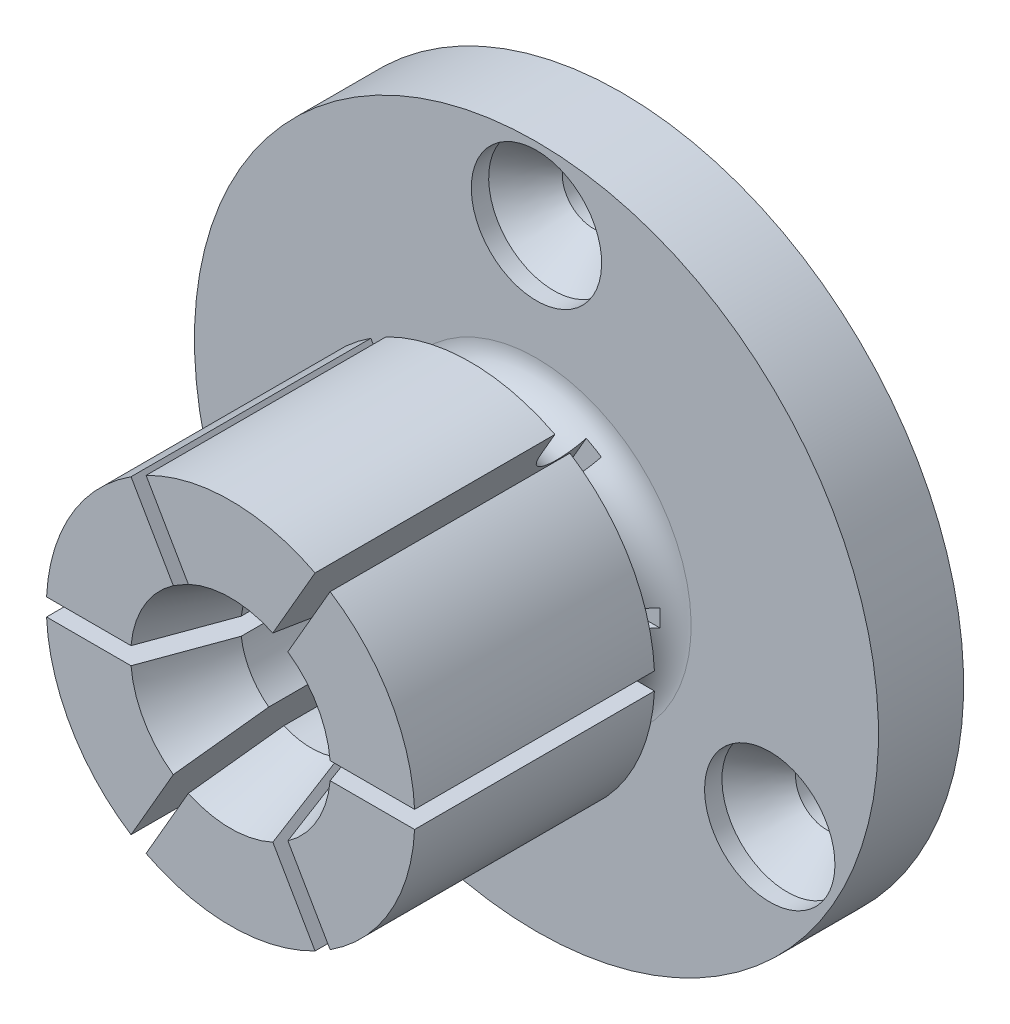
ISO-10303-21;
HEADER;
FILE_DESCRIPTION(('STEP AP214'),'2;1');
FILE_NAME('part.step','',(''),(''),'','','');
FILE_SCHEMA(('AUTOMOTIVE_DESIGN { 1 0 10303 214 1 1 1 1 }'));
ENDSEC;
DATA;
#1=APPLICATION_CONTEXT('core data for automotive mechanical design processes');
#2=APPLICATION_PROTOCOL_DEFINITION('international standard','automotive_design',2000,#1);
#3=PRODUCT_CONTEXT('',#1,'mechanical');
#4=PRODUCT('Part','Part','',(#3));
#5=PRODUCT_RELATED_PRODUCT_CATEGORY('part','',(#4));
#6=PRODUCT_DEFINITION_FORMATION('','',#4);
#7=PRODUCT_DEFINITION_CONTEXT('part definition',#1,'design');
#8=PRODUCT_DEFINITION('design','',#6,#7);
#9=PRODUCT_DEFINITION_SHAPE('','',#8);
#10=(LENGTH_UNIT() NAMED_UNIT(*) SI_UNIT(.MILLI.,.METRE.));
#11=(NAMED_UNIT(*) PLANE_ANGLE_UNIT() SI_UNIT($,.RADIAN.));
#12=(NAMED_UNIT(*) SI_UNIT($,.STERADIAN.) SOLID_ANGLE_UNIT());
#13=UNCERTAINTY_MEASURE_WITH_UNIT(LENGTH_MEASURE(1.E-05),#10,'distance_accuracy_value','');
#14=(GEOMETRIC_REPRESENTATION_CONTEXT(3) GLOBAL_UNCERTAINTY_ASSIGNED_CONTEXT((#13)) GLOBAL_UNIT_ASSIGNED_CONTEXT((#10,
#11,#12)) REPRESENTATION_CONTEXT('',''));
#15=CARTESIAN_POINT('',(0.,0.,0.));
#16=DIRECTION('',(0.,0.,1.));
#17=DIRECTION('',(1.,0.,0.));
#18=AXIS2_PLACEMENT_3D('',#15,#16,#17);
#19=CARTESIAN_POINT('',(5.1562,0.,0.));
#20=DIRECTION('',(0.,0.,-1.));
#21=DIRECTION('',(0.,1.,0.));
#22=AXIS2_PLACEMENT_3D('',#19,#20,#21);
#23=PLANE('',#22);
#24=CARTESIAN_POINT('',(0.,0.,0.));
#25=DIRECTION('',(0.,0.,-1.));
#26=DIRECTION('',(0.,1.,0.));
#27=AXIS2_PLACEMENT_3D('',#24,#25,#26);
#28=CIRCLE('',#27,5.1562);
#29=CARTESIAN_POINT('',(0.,5.1562,0.));
#30=VERTEX_POINT('',#29);
#31=EDGE_CURVE('E767',#30,#30,#28,.T.);
#32=ORIENTED_EDGE('',*,*,#31,.F.);
#33=EDGE_LOOP('',(#32));
#34=FACE_BOUND('',#33,.T.);
#35=CARTESIAN_POINT('',(0.,19.685,0.));
#36=DIRECTION('',(0.,0.,-1.));
#37=DIRECTION('',(0.,1.,0.));
#38=AXIS2_PLACEMENT_3D('',#35,#36,#37);
#39=CIRCLE('',#38,2.2606);
#40=CARTESIAN_POINT('',(0.,21.9456,0.));
#41=VERTEX_POINT('',#40);
#42=EDGE_CURVE('E915',#41,#41,#39,.T.);
#43=ORIENTED_EDGE('',*,*,#42,.F.);
#44=EDGE_LOOP('',(#43));
#45=FACE_BOUND('',#44,.T.);
#46=CARTESIAN_POINT('',(-17.0477100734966,-9.8425,0.));
#47=DIRECTION('',(0.,0.,-1.));
#48=DIRECTION('',(0.,1.,0.));
#49=AXIS2_PLACEMENT_3D('',#46,#47,#48);
#50=CIRCLE('',#49,2.2606);
#51=CARTESIAN_POINT('',(-17.0477100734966,-7.5819,0.));
#52=VERTEX_POINT('',#51);
#53=EDGE_CURVE('E919',#52,#52,#50,.T.);
#54=ORIENTED_EDGE('',*,*,#53,.F.);
#55=EDGE_LOOP('',(#54));
#56=FACE_BOUND('',#55,.T.);
#57=CARTESIAN_POINT('',(17.0477100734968,-9.84249999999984,0.));
#58=DIRECTION('',(0.,0.,-1.));
#59=DIRECTION('',(0.,1.,0.));
#60=AXIS2_PLACEMENT_3D('',#57,#58,#59);
#61=CIRCLE('',#60,2.2606);
#62=CARTESIAN_POINT('',(17.0477100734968,-7.58189999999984,0.));
#63=VERTEX_POINT('',#62);
#64=EDGE_CURVE('E923',#63,#63,#61,.T.);
#65=ORIENTED_EDGE('',*,*,#64,.F.);
#66=EDGE_LOOP('',(#65));
#67=FACE_BOUND('',#66,.T.);
#68=CARTESIAN_POINT('',(0.,0.,0.));
#69=DIRECTION('',(0.,0.,-1.));
#70=DIRECTION('',(0.,1.,0.));
#71=AXIS2_PLACEMENT_3D('',#68,#69,#70);
#72=CIRCLE('',#71,24.9936);
#73=CARTESIAN_POINT('',(0.,24.9936,0.));
#74=VERTEX_POINT('',#73);
#75=EDGE_CURVE('E926',#74,#74,#72,.T.);
#76=ORIENTED_EDGE('',*,*,#75,.T.);
#77=EDGE_LOOP('',(#76));
#78=FACE_BOUND('',#77,.T.);
#79=ADVANCED_FACE('F14',(#34,#45,#56,#67,#78),#23,.T.);
#80=CARTESIAN_POINT('',(13.462,0.,6.223));
#81=DIRECTION('',(0.,0.,1.));
#82=DIRECTION('',(0.,-1.,0.));
#83=AXIS2_PLACEMENT_3D('',#80,#81,#82);
#84=PLANE('',#83);
#85=CARTESIAN_POINT('',(0.,0.,6.223));
#86=DIRECTION('',(0.,0.,-1.));
#87=DIRECTION('',(0.,1.,0.));
#88=AXIS2_PLACEMENT_3D('',#85,#86,#87);
#89=CIRCLE('',#88,11.303);
#90=CARTESIAN_POINT('',(0.,11.303,6.223));
#91=VERTEX_POINT('',#90);
#92=EDGE_CURVE('E763',#91,#91,#89,.T.);
#93=ORIENTED_EDGE('',*,*,#92,.T.);
#94=EDGE_LOOP('',(#93));
#95=FACE_BOUND('',#94,.T.);
#96=CARTESIAN_POINT('',(0.,19.685,6.223));
#97=DIRECTION('',(0.,0.,-1.));
#98=DIRECTION('',(0.,1.,0.));
#99=AXIS2_PLACEMENT_3D('',#96,#97,#98);
#100=CIRCLE('',#99,4.7625);
#101=CARTESIAN_POINT('',(0.,24.4475,6.223));
#102=VERTEX_POINT('',#101);
#103=EDGE_CURVE('E955',#102,#102,#100,.T.);
#104=ORIENTED_EDGE('',*,*,#103,.T.);
#105=EDGE_LOOP('',(#104));
#106=FACE_BOUND('',#105,.T.);
#107=CARTESIAN_POINT('',(-17.0477100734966,-9.8425,6.223));
#108=DIRECTION('',(0.,0.,-1.));
#109=DIRECTION('',(-0.866025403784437,-0.5,0.));
#110=AXIS2_PLACEMENT_3D('',#107,#108,#109);
#111=CIRCLE('',#110,4.7625);
#112=CARTESIAN_POINT('',(-21.17215605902,-12.22375,6.223));
#113=VERTEX_POINT('',#112);
#114=EDGE_CURVE('E946',#113,#113,#111,.T.);
#115=ORIENTED_EDGE('',*,*,#114,.T.);
#116=EDGE_LOOP('',(#115));
#117=FACE_BOUND('',#116,.T.);
#118=CARTESIAN_POINT('',(17.0477100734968,-9.84249999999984,6.223));
#119=DIRECTION('',(0.,0.,-1.));
#120=DIRECTION('',(0.866025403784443,-0.499999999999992,0.));
#121=AXIS2_PLACEMENT_3D('',#118,#119,#120);
#122=CIRCLE('',#121,4.7625);
#123=CARTESIAN_POINT('',(21.1721560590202,-12.2237499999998,6.223));
#124=VERTEX_POINT('',#123);
#125=EDGE_CURVE('E937',#124,#124,#122,.T.);
#126=ORIENTED_EDGE('',*,*,#125,.T.);
#127=EDGE_LOOP('',(#126));
#128=FACE_BOUND('',#127,.T.);
#129=CARTESIAN_POINT('',(0.,0.,6.223));
#130=DIRECTION('',(0.,0.,1.));
#131=DIRECTION('',(0.,-1.,0.));
#132=AXIS2_PLACEMENT_3D('',#129,#130,#131);
#133=CIRCLE('',#132,24.9936);
#134=CARTESIAN_POINT('',(0.,-24.9936,6.223));
#135=VERTEX_POINT('',#134);
#136=EDGE_CURVE('E18',#135,#135,#133,.T.);
#137=ORIENTED_EDGE('',*,*,#136,.T.);
#138=EDGE_LOOP('',(#137));
#139=FACE_BOUND('',#138,.T.);
#140=ADVANCED_FACE('F358',(#95,#106,#117,#128,#139),#84,.T.);
#141=CARTESIAN_POINT('',(11.303,0.,11.049));
#142=DIRECTION('',(0.,0.,-1.));
#143=DIRECTION('',(0.,1.,0.));
#144=AXIS2_PLACEMENT_3D('',#141,#142,#143);
#145=PLANE('',#144);
#146=DIRECTION('',(0.50000000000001,-0.866025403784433,0.));
#147=VECTOR('',#146,1.);
#148=CARTESIAN_POINT('',(3.37567613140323,-4.57684256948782,11.049));
#149=LINE('',#148,#147);
#150=CARTESIAN_POINT('',(6.19250054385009,-9.45572556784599,11.049));
#151=VERTEX_POINT('',#150);
#152=CARTESIAN_POINT('',(7.27343375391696,-11.3279568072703,11.049));
#153=VERTEX_POINT('',#152);
#154=EDGE_CURVE('E320',#151,#153,#149,.T.);
#155=ORIENTED_EDGE('',*,*,#154,.F.);
#156=CARTESIAN_POINT('',(0.,0.,11.049));
#157=DIRECTION('',(0.,0.,-1.));
#158=DIRECTION('',(0.,1.,0.));
#159=AXIS2_PLACEMENT_3D('',#156,#157,#158);
#160=CIRCLE('',#159,11.303);
#161=CARTESIAN_POINT('',(11.2851488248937,-0.635,11.049));
#162=VERTEX_POINT('',#161);
#163=EDGE_CURVE('E756',#162,#151,#160,.T.);
#164=ORIENTED_EDGE('',*,*,#163,.F.);
#165=DIRECTION('',(-1.,0.,0.));
#166=VECTOR('',#165,1.);
#167=CARTESIAN_POINT('',(11.303,-0.635,11.049));
#168=LINE('',#167,#166);
#169=CARTESIAN_POINT('',(13.4470152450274,-0.635,11.049));
#170=VERTEX_POINT('',#169);
#171=EDGE_CURVE('E581',#170,#162,#168,.T.);
#172=ORIENTED_EDGE('',*,*,#171,.F.);
#173=CARTESIAN_POINT('',(0.,0.,11.049));
#174=DIRECTION('',(0.,0.,-1.));
#175=DIRECTION('',(0.,1.,0.));
#176=AXIS2_PLACEMENT_3D('',#173,#174,#175);
#177=CIRCLE('',#176,13.462);
#178=EDGE_CURVE('E754',#170,#153,#177,.T.);
#179=ORIENTED_EDGE('',*,*,#178,.T.);
#180=EDGE_LOOP('',(#155,#164,#172,#179));
#181=FACE_BOUND('',#180,.T.);
#182=ADVANCED_FACE('F907',(#181),#145,.T.);
#183=CARTESIAN_POINT('',(0.,0.,0.));
#184=DIRECTION('',(0.,0.,-1.));
#185=DIRECTION('',(0.,1.,0.));
#186=AXIS2_PLACEMENT_3D('',#183,#184,#185);
#187=CYLINDRICAL_SURFACE('',#186,13.462);
#188=DIRECTION('',(0.,0.,-1.));
#189=VECTOR('',#188,1.);
#190=CARTESIAN_POINT('',(7.27343375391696,-11.3279568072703,0.));
#191=LINE('',#190,#189);
#192=CARTESIAN_POINT('',(7.27343375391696,-11.3279568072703,28.575));
#193=VERTEX_POINT('',#192);
#194=EDGE_CURVE('E962',#153,#193,#191,.F.);
#195=ORIENTED_EDGE('',*,*,#194,.F.);
#196=ORIENTED_EDGE('',*,*,#178,.F.);
#197=DIRECTION('',(0.,0.,-1.));
#198=VECTOR('',#197,1.);
#199=CARTESIAN_POINT('',(13.4470152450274,-0.635,0.));
#200=LINE('',#199,#198);
#201=CARTESIAN_POINT('',(13.4470152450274,-0.635,28.575));
#202=VERTEX_POINT('',#201);
#203=EDGE_CURVE('E579',#202,#170,#200,.T.);
#204=ORIENTED_EDGE('',*,*,#203,.F.);
#205=CARTESIAN_POINT('',(0.,0.,28.575));
#206=DIRECTION('',(0.,0.,-1.));
#207=DIRECTION('',(0.,1.,0.));
#208=AXIS2_PLACEMENT_3D('',#205,#206,#207);
#209=CIRCLE('',#208,13.462);
#210=EDGE_CURVE('E807',#202,#193,#209,.T.);
#211=ORIENTED_EDGE('',*,*,#210,.T.);
#212=EDGE_LOOP('',(#195,#196,#204,#211));
#213=FACE_BOUND('',#212,.T.);
#214=ADVANCED_FACE('F972',(#213),#187,.T.);
#215=CARTESIAN_POINT('',(13.462,0.,28.575));
#216=DIRECTION('',(0.,0.,1.));
#217=DIRECTION('',(0.,-1.,0.));
#218=AXIS2_PLACEMENT_3D('',#215,#216,#217);
#219=PLANE('',#218);
#220=DIRECTION('',(-0.50000000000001,0.866025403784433,0.));
#221=VECTOR('',#220,1.);
#222=CARTESIAN_POINT('',(13.0458682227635,-21.3261065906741,28.575));
#223=LINE('',#222,#221);
#224=CARTESIAN_POINT('',(4.18734558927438,-5.9826953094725,28.575));
#225=VERTEX_POINT('',#224);
#226=EDGE_CURVE('E297',#193,#225,#223,.T.);
#227=ORIENTED_EDGE('',*,*,#226,.F.);
#228=ORIENTED_EDGE('',*,*,#210,.F.);
#229=DIRECTION('',(1.,0.,0.));
#230=VECTOR('',#229,1.);
#231=CARTESIAN_POINT('',(24.9918841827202,-0.635,28.575));
#232=LINE('',#231,#230);
#233=CARTESIAN_POINT('',(7.27483891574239,-0.635,28.575));
#234=VERTEX_POINT('',#233);
#235=EDGE_CURVE('E557',#234,#202,#232,.T.);
#236=ORIENTED_EDGE('',*,*,#235,.F.);
#237=CARTESIAN_POINT('',(0.,0.,28.575));
#238=DIRECTION('',(0.,0.,-1.));
#239=DIRECTION('',(0.,1.,0.));
#240=AXIS2_PLACEMENT_3D('',#237,#238,#239);
#241=CIRCLE('',#240,7.3025);
#242=EDGE_CURVE('E612',#234,#225,#241,.T.);
#243=ORIENTED_EDGE('',*,*,#242,.T.);
#244=EDGE_LOOP('',(#227,#228,#236,#243));
#245=FACE_BOUND('',#244,.T.);
#246=ADVANCED_FACE('F979',(#245),#219,.T.);
#247=CARTESIAN_POINT('',(0.,0.,28.575));
#248=DIRECTION('',(0.,0.,1.));
#249=DIRECTION('',(0.,-1.,0.));
#250=AXIS2_PLACEMENT_3D('',#247,#248,#249);
#251=CONICAL_SURFACE('',#250,7.3025,0.349065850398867);
#252=CARTESIAN_POINT('',(4.18738212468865,-5.98275859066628,28.5752));
#253=CARTESIAN_POINT('',(4.0975893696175,-5.82723297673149,28.0836656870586));
#254=CARTESIAN_POINT('',(4.0077756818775,-5.67167110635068,27.5921466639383));
#255=CARTESIAN_POINT('',(3.82809209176,-5.36044999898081,26.6091497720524));
#256=CARTESIAN_POINT('',(3.73822218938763,-5.20479076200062,26.1176719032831));
#257=CARTESIAN_POINT('',(3.55841180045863,-4.89335003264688,25.1347677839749));
#258=CARTESIAN_POINT('',(3.46847131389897,-4.73756854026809,24.6433415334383));
#259=CARTESIAN_POINT('',(3.28849524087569,-4.42584083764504,23.660558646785));
#260=CARTESIAN_POINT('',(3.1984596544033,-4.2698946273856,23.1692020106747));
#261=CARTESIAN_POINT('',(3.10836426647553,-4.11384483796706,22.6778892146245));
#262=B_SPLINE_CURVE_WITH_KNOTS('',3,(#252,#253,#254,#255,#256,#257,#258,#259,#260,#261),
.UNSPECIFIED.,.F.,.F.,(4,2,2,2,4),(0.,1.56994026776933,3.13988039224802,4.70982058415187,
6.27976092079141),.UNSPECIFIED.);
#263=CARTESIAN_POINT('',(3.1084009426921,-4.1139083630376,22.6780892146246));
#264=VERTEX_POINT('',#263);
#265=EDGE_CURVE('E865',#225,#264,#262,.T.);
#266=ORIENTED_EDGE('',*,*,#265,.F.);
#267=ORIENTED_EDGE('',*,*,#242,.F.);
#268=CARTESIAN_POINT('',(2.63607942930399,-0.635,15.9612843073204));
#269=CARTESIAN_POINT('',(2.75413106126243,-0.635000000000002,16.276658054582));
#270=CARTESIAN_POINT('',(2.87183475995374,-0.635000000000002,16.5921616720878));
#271=CARTESIAN_POINT('',(3.10670977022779,-0.635000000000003,17.2233666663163));
#272=CARTESIAN_POINT('',(3.22388108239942,-0.635000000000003,17.5390680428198));
#273=CARTESIAN_POINT('',(3.45785476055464,-0.635000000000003,18.1706064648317));
#274=CARTESIAN_POINT('',(3.57465712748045,-0.635000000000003,18.4864435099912));
#275=CARTESIAN_POINT('',(3.80798285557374,-0.635000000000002,19.1182207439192));
#276=CARTESIAN_POINT('',(3.92450621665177,-0.635000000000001,19.4341609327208));
#277=CARTESIAN_POINT('',(4.28218645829,-0.634999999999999,20.4049598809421));
#278=CARTESIAN_POINT('',(4.52299911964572,-0.635000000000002,21.0599454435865));
#279=CARTESIAN_POINT('',(5.00407706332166,-0.635000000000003,22.3701184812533));
#280=CARTESIAN_POINT('',(5.24434234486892,-0.635000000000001,23.0253059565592));
#281=CARTESIAN_POINT('',(5.95622273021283,-0.634999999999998,24.9681817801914));
#282=CARTESIAN_POINT('',(6.42733076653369,-0.635000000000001,26.2560558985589));
#283=CARTESIAN_POINT('',(7.1334846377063,-0.635000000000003,28.1880500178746));
#284=CARTESIAN_POINT('',(7.36878413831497,-0.635000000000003,28.8320773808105));
#285=CARTESIAN_POINT('',(7.83924856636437,-0.635000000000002,30.1201811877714));
#286=CARTESIAN_POINT('',(8.07441349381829,-0.635000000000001,30.7642576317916));
#287=CARTESIAN_POINT('',(8.30952842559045,-0.635,31.408352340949));
#288=B_SPLINE_CURVE_WITH_KNOTS('',3,(#268,#269,#270,#271,#272,#273,#274,#275,#276,#277,#278,
#279,#280,#281,#282,#283,#284,#285,#286,#287),.UNSPECIFIED.,.F.,.F.,(4,2,2,2,2,2,2,2,2,4),(0.,
1.01023249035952,2.02046386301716,3.03069265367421,4.04092176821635,6.13447602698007,
8.22803324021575,12.3420408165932,14.3990371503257,16.4560332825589),.UNSPECIFIED.);
#289=CARTESIAN_POINT('',(5.11694962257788,-0.635,22.6780892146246));
#290=VERTEX_POINT('',#289);
#291=EDGE_CURVE('E732',#290,#234,#288,.T.);
#292=ORIENTED_EDGE('',*,*,#291,.F.);
#293=CARTESIAN_POINT('',(0.,0.,22.6780892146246));
#294=DIRECTION('',(0.,0.,-1.));
#295=DIRECTION('',(0.,1.,0.));
#296=AXIS2_PLACEMENT_3D('',#293,#294,#295);
#297=CIRCLE('',#296,5.1562);
#298=EDGE_CURVE('E597',#290,#264,#297,.T.);
#299=ORIENTED_EDGE('',*,*,#298,.T.);
#300=EDGE_LOOP('',(#266,#267,#292,#299));
#301=FACE_BOUND('',#300,.T.);
#302=ADVANCED_FACE('F900',(#301),#251,.F.);
#303=DIRECTION('',(-0.50000000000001,0.866025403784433,0.));
#304=VECTOR('',#303,1.);
#305=CARTESIAN_POINT('',(2.275823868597,-5.21184256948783,11.049));
#306=LINE('',#305,#304);
#307=CARTESIAN_POINT('',(6.17358149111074,-11.9629568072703,11.049));
#308=VERTEX_POINT('',#307);
#309=CARTESIAN_POINT('',(5.09264828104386,-10.090725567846,11.049));
#310=VERTEX_POINT('',#309);
#311=EDGE_CURVE('E305',#308,#310,#306,.T.);
#312=ORIENTED_EDGE('',*,*,#311,.F.);
#313=CARTESIAN_POINT('',(-6.17358149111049,-11.9629568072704,11.049));
#314=VERTEX_POINT('',#313);
#315=EDGE_CURVE('E758',#308,#314,#177,.T.);
#316=ORIENTED_EDGE('',*,*,#315,.T.);
#317=DIRECTION('',(-0.499999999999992,-0.866025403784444,0.));
#318=VECTOR('',#317,1.);
#319=CARTESIAN_POINT('',(3.37567613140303,4.57684256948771,11.049));
#320=LINE('',#319,#318);
#321=CARTESIAN_POINT('',(-5.09264828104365,-10.0907255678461,11.049));
#322=VERTEX_POINT('',#321);
#323=EDGE_CURVE('E859',#322,#314,#320,.T.);
#324=ORIENTED_EDGE('',*,*,#323,.F.);
#325=EDGE_CURVE('E764',#310,#322,#160,.T.);
#326=ORIENTED_EDGE('',*,*,#325,.F.);
#327=EDGE_LOOP('',(#312,#316,#324,#326));
#328=FACE_BOUND('',#327,.T.);
#329=ADVANCED_FACE('F974',(#328),#145,.T.);
#330=DIRECTION('',(0.,0.,-1.));
#331=VECTOR('',#330,1.);
#332=CARTESIAN_POINT('',(6.17358149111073,-11.9629568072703,0.));
#333=LINE('',#332,#331);
#334=CARTESIAN_POINT('',(6.17358149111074,-11.9629568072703,28.575));
#335=VERTEX_POINT('',#334);
#336=EDGE_CURVE('E310',#335,#308,#333,.T.);
#337=ORIENTED_EDGE('',*,*,#336,.F.);
#338=CARTESIAN_POINT('',(-6.17358149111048,-11.9629568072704,28.575));
#339=VERTEX_POINT('',#338);
#340=EDGE_CURVE('E809',#335,#339,#209,.T.);
#341=ORIENTED_EDGE('',*,*,#340,.T.);
#342=DIRECTION('',(0.,0.,-1.));
#343=VECTOR('',#342,1.);
#344=CARTESIAN_POINT('',(-6.17358149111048,-11.9629568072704,0.));
#345=LINE('',#344,#343);
#346=EDGE_CURVE('E464',#314,#339,#345,.F.);
#347=ORIENTED_EDGE('',*,*,#346,.F.);
#348=ORIENTED_EDGE('',*,*,#315,.F.);
#349=EDGE_LOOP('',(#337,#341,#347,#348));
#350=FACE_BOUND('',#349,.T.);
#351=ADVANCED_FACE('F854',(#350),#187,.T.);
#352=DIRECTION('',(0.50000000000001,-0.866025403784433,0.));
#353=VECTOR('',#352,1.);
#354=CARTESIAN_POINT('',(11.9460159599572,-21.9611065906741,28.575));
#355=LINE('',#354,#353);
#356=CARTESIAN_POINT('',(3.08749332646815,-6.61769530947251,28.575));
#357=VERTEX_POINT('',#356);
#358=EDGE_CURVE('E958',#357,#335,#355,.T.);
#359=ORIENTED_EDGE('',*,*,#358,.F.);
#360=CARTESIAN_POINT('',(-3.08749332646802,-6.61769530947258,28.575));
#361=VERTEX_POINT('',#360);
#362=EDGE_CURVE('E811',#357,#361,#241,.T.);
#363=ORIENTED_EDGE('',*,*,#362,.T.);
#364=DIRECTION('',(0.499999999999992,0.866025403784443,0.));
#365=VECTOR('',#364,1.);
#366=CARTESIAN_POINT('',(-11.9460159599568,-21.9611065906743,28.575));
#367=LINE('',#366,#365);
#368=EDGE_CURVE('E857',#339,#361,#367,.T.);
#369=ORIENTED_EDGE('',*,*,#368,.F.);
#370=ORIENTED_EDGE('',*,*,#340,.F.);
#371=EDGE_LOOP('',(#359,#363,#369,#370));
#372=FACE_BOUND('',#371,.T.);
#373=ADVANCED_FACE('F860',(#372),#219,.T.);
#374=CARTESIAN_POINT('',(2.0085120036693,-4.74884483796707,22.6778892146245));
#375=CARTESIAN_POINT('',(2.09860739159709,-4.90489462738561,23.1692020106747));
#376=CARTESIAN_POINT('',(2.18864297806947,-5.06084083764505,23.660558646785));
#377=CARTESIAN_POINT('',(2.36861905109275,-5.37256854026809,24.6433415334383));
#378=CARTESIAN_POINT('',(2.45855953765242,-5.52835003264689,25.1347677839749));
#379=CARTESIAN_POINT('',(2.63836992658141,-5.83979076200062,26.1176719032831));
#380=CARTESIAN_POINT('',(2.72823982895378,-5.99544999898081,26.6091497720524));
#381=CARTESIAN_POINT('',(2.90792341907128,-6.30667110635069,27.5921466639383));
#382=CARTESIAN_POINT('',(2.99773710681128,-6.46223297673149,28.0836656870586));
#383=CARTESIAN_POINT('',(3.08752986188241,-6.61775859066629,28.5752));
#384=B_SPLINE_CURVE_WITH_KNOTS('',3,(#374,#375,#376,#377,#378,#379,#380,#381,#382,#383),
.UNSPECIFIED.,.F.,.F.,(4,2,2,2,4),(0.,1.56994033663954,3.13988052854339,4.70982065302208,
6.27976092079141),.UNSPECIFIED.);
#385=CARTESIAN_POINT('',(2.00854867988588,-4.74890836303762,22.6780892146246));
#386=VERTEX_POINT('',#385);
#387=EDGE_CURVE('E312',#386,#357,#384,.T.);
#388=ORIENTED_EDGE('',*,*,#387,.F.);
#389=CARTESIAN_POINT('',(-2.00854867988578,-4.74890836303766,22.6780892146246));
#390=VERTEX_POINT('',#389);
#391=EDGE_CURVE('E302',#386,#390,#297,.T.);
#392=ORIENTED_EDGE('',*,*,#391,.T.);
#393=CARTESIAN_POINT('',(-3.08752986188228,-6.61775859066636,28.5752));
#394=CARTESIAN_POINT('',(-2.99773710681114,-6.46223297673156,28.0836656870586));
#395=CARTESIAN_POINT('',(-2.90792341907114,-6.30667110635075,27.5921466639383));
#396=CARTESIAN_POINT('',(-2.72823982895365,-5.99544999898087,26.6091497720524));
#397=CARTESIAN_POINT('',(-2.63836992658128,-5.83979076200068,26.1176719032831));
#398=CARTESIAN_POINT('',(-2.45855953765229,-5.52835003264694,25.1347677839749));
#399=CARTESIAN_POINT('',(-2.36861905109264,-5.37256854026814,24.6433415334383));
#400=CARTESIAN_POINT('',(-2.18864297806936,-5.06084083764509,23.660558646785));
#401=CARTESIAN_POINT('',(-2.09860739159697,-4.90489462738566,23.1692020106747));
#402=CARTESIAN_POINT('',(-2.0085120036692,-4.74884483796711,22.6778892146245));
#403=B_SPLINE_CURVE_WITH_KNOTS('',3,(#393,#394,#395,#396,#397,#398,#399,#400,#401,#402),
.UNSPECIFIED.,.F.,.F.,(4,2,2,2,4),(0.,1.56994026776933,3.13988039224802,4.70982058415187,
6.27976092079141),.UNSPECIFIED.);
#404=EDGE_CURVE('E455',#361,#390,#403,.T.);
#405=ORIENTED_EDGE('',*,*,#404,.F.);
#406=ORIENTED_EDGE('',*,*,#362,.F.);
#407=EDGE_LOOP('',(#388,#392,#405,#406));
#408=FACE_BOUND('',#407,.T.);
#409=ADVANCED_FACE('F889',(#408),#251,.F.);
#410=DIRECTION('',(0.499999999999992,0.866025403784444,0.));
#411=VECTOR('',#410,1.);
#412=CARTESIAN_POINT('',(2.27582386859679,5.2118425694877,11.049));
#413=LINE('',#412,#411);
#414=CARTESIAN_POINT('',(-7.27343375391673,-11.3279568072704,11.049));
#415=VERTEX_POINT('',#414);
#416=CARTESIAN_POINT('',(-6.1925005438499,-9.45572556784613,11.0490000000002));
#417=VERTEX_POINT('',#416);
#418=EDGE_CURVE('E875',#415,#417,#413,.T.);
#419=ORIENTED_EDGE('',*,*,#418,.F.);
#420=CARTESIAN_POINT('',(-13.4470152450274,-0.635000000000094,11.049));
#421=VERTEX_POINT('',#420);
#422=EDGE_CURVE('E788',#415,#421,#177,.T.);
#423=ORIENTED_EDGE('',*,*,#422,.T.);
#424=DIRECTION('',(-1.,0.,0.));
#425=VECTOR('',#424,1.);
#426=CARTESIAN_POINT('',(11.303,-0.634999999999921,11.049));
#427=LINE('',#426,#425);
#428=CARTESIAN_POINT('',(-11.2851488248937,-0.635000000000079,11.049));
#429=VERTEX_POINT('',#428);
#430=EDGE_CURVE('E492',#429,#421,#427,.T.);
#431=ORIENTED_EDGE('',*,*,#430,.F.);
#432=EDGE_CURVE('E768',#417,#429,#160,.T.);
#433=ORIENTED_EDGE('',*,*,#432,.F.);
#434=EDGE_LOOP('',(#419,#423,#431,#433));
#435=FACE_BOUND('',#434,.T.);
#436=ADVANCED_FACE('F786',(#435),#145,.T.);
#437=DIRECTION('',(0.,0.,-1.));
#438=VECTOR('',#437,1.);
#439=CARTESIAN_POINT('',(-7.27343375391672,-11.3279568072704,0.));
#440=LINE('',#439,#438);
#441=CARTESIAN_POINT('',(-7.27343375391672,-11.3279568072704,28.575));
#442=VERTEX_POINT('',#441);
#443=EDGE_CURVE('E878',#442,#415,#440,.T.);
#444=ORIENTED_EDGE('',*,*,#443,.F.);
#445=CARTESIAN_POINT('',(-13.4470152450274,-0.635000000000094,28.575));
#446=VERTEX_POINT('',#445);
#447=EDGE_CURVE('E845',#442,#446,#209,.T.);
#448=ORIENTED_EDGE('',*,*,#447,.T.);
#449=DIRECTION('',(0.,0.,-1.));
#450=VECTOR('',#449,1.);
#451=CARTESIAN_POINT('',(-13.4470152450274,-0.635000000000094,0.));
#452=LINE('',#451,#450);
#453=EDGE_CURVE('E789',#421,#446,#452,.F.);
#454=ORIENTED_EDGE('',*,*,#453,.F.);
#455=ORIENTED_EDGE('',*,*,#422,.F.);
#456=EDGE_LOOP('',(#444,#448,#454,#455));
#457=FACE_BOUND('',#456,.T.);
#458=ADVANCED_FACE('F897',(#457),#187,.T.);
#459=DIRECTION('',(-0.499999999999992,-0.866025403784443,0.));
#460=VECTOR('',#459,1.);
#461=CARTESIAN_POINT('',(-13.045868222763,-21.3261065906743,28.575));
#462=LINE('',#461,#460);
#463=CARTESIAN_POINT('',(-4.18734558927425,-5.98269530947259,28.575));
#464=VERTEX_POINT('',#463);
#465=EDGE_CURVE('E862',#464,#442,#462,.T.);
#466=ORIENTED_EDGE('',*,*,#465,.F.);
#467=CARTESIAN_POINT('',(-7.27483891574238,-0.635000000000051,28.575));
#468=VERTEX_POINT('',#467);
#469=EDGE_CURVE('E816',#464,#468,#241,.T.);
#470=ORIENTED_EDGE('',*,*,#469,.T.);
#471=DIRECTION('',(1.,0.,0.));
#472=VECTOR('',#471,1.);
#473=CARTESIAN_POINT('',(-24.9918841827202,-0.635000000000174,28.575));
#474=LINE('',#473,#472);
#475=EDGE_CURVE('E467',#446,#468,#474,.T.);
#476=ORIENTED_EDGE('',*,*,#475,.F.);
#477=ORIENTED_EDGE('',*,*,#447,.F.);
#478=EDGE_LOOP('',(#466,#470,#476,#477));
#479=FACE_BOUND('',#478,.T.);
#480=ADVANCED_FACE('F886',(#479),#219,.T.);
#481=CARTESIAN_POINT('',(-3.10836426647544,-4.11384483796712,22.6778892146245));
#482=CARTESIAN_POINT('',(-3.19845965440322,-4.26989462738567,23.1692020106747));
#483=CARTESIAN_POINT('',(-3.2884952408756,-4.4258408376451,23.660558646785));
#484=CARTESIAN_POINT('',(-3.46847131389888,-4.73756854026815,24.6433415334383));
#485=CARTESIAN_POINT('',(-3.55841180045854,-4.89335003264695,25.1347677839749));
#486=CARTESIAN_POINT('',(-3.73822218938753,-5.20479076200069,26.1176719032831));
#487=CARTESIAN_POINT('',(-3.82809209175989,-5.36044999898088,26.6091497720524));
#488=CARTESIAN_POINT('',(-4.00777568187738,-5.67167110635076,27.5921466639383));
#489=CARTESIAN_POINT('',(-4.09758936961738,-5.82723297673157,28.0836656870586));
#490=CARTESIAN_POINT('',(-4.18738212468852,-5.98275859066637,28.5752));
#491=B_SPLINE_CURVE_WITH_KNOTS('',3,(#481,#482,#483,#484,#485,#486,#487,#488,#489,#490),
.UNSPECIFIED.,.F.,.F.,(4,2,2,2,4),(0.,1.56994033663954,3.13988052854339,4.70982065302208,
6.27976092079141),.UNSPECIFIED.);
#492=CARTESIAN_POINT('',(-3.10840094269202,-4.11390836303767,22.6780892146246));
#493=VERTEX_POINT('',#492);
#494=EDGE_CURVE('E880',#493,#464,#491,.T.);
#495=ORIENTED_EDGE('',*,*,#494,.F.);
#496=CARTESIAN_POINT('',(-5.11694962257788,-0.635000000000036,22.6780892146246));
#497=VERTEX_POINT('',#496);
#498=EDGE_CURVE('E613',#493,#497,#297,.T.);
#499=ORIENTED_EDGE('',*,*,#498,.T.);
#500=CARTESIAN_POINT('',(-8.30952842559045,-0.635000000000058,31.408352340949));
#501=CARTESIAN_POINT('',(-7.83926689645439,-0.635000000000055,30.1201701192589));
#502=CARTESIAN_POINT('',(-7.368865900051,-0.635000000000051,28.8320386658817));
#503=CARTESIAN_POINT('',(-6.66271214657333,-0.635000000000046,26.900045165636));
#504=CARTESIAN_POINT('',(-6.42723580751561,-0.635000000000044,26.2560820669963));
#505=CARTESIAN_POINT('',(-5.95604151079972,-0.635000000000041,24.9682440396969));
#506=CARTESIAN_POINT('',(-5.72032355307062,-0.63500000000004,24.3243691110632));
#507=CARTESIAN_POINT('',(-5.24853650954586,-0.635000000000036,23.0367454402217));
#508=CARTESIAN_POINT('',(-5.01246742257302,-0.635000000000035,22.392996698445));
#509=CARTESIAN_POINT('',(-4.53980635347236,-0.635000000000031,21.1056915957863));
#510=CARTESIAN_POINT('',(-4.30321437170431,-0.63500000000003,20.4621352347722));
#511=CARTESIAN_POINT('',(-3.94768724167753,-0.635000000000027,19.4970349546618));
#512=CARTESIAN_POINT('',(-3.82907148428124,-0.635000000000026,19.1753733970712));
#513=CARTESIAN_POINT('',(-3.59155530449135,-0.635000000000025,18.5321555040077));
#514=CARTESIAN_POINT('',(-3.47265488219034,-0.635000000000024,18.2105991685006));
#515=CARTESIAN_POINT('',(-3.2344761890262,-0.635000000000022,17.5676254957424));
#516=CARTESIAN_POINT('',(-3.11519791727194,-0.635000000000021,17.2462081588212));
#517=CARTESIAN_POINT('',(-2.87609279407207,-0.63500000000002,16.6035772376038));
#518=CARTESIAN_POINT('',(-2.75626594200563,-0.635000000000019,16.2823636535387));
#519=CARTESIAN_POINT('',(-2.63607942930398,-0.635000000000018,15.9612843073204));
#520=B_SPLINE_CURVE_WITH_KNOTS('',3,(#500,#501,#502,#503,#504,#505,#506,#507,#508,#509,#510,
#511,#512,#513,#514,#515,#516,#517,#518,#519),.UNSPECIFIED.,.F.,.F.,(4,2,2,2,2,2,2,2,2,4),(0.,
4.11400477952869,6.17100213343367,8.22800009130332,10.2850049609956,12.3420084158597,
13.3705133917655,14.3990180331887,15.4275251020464,16.4560333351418),.UNSPECIFIED.);
#521=EDGE_CURVE('E673',#468,#497,#520,.T.);
#522=ORIENTED_EDGE('',*,*,#521,.F.);
#523=ORIENTED_EDGE('',*,*,#469,.F.);
#524=EDGE_LOOP('',(#495,#499,#522,#523));
#525=FACE_BOUND('',#524,.T.);
#526=ADVANCED_FACE('F887',(#525),#251,.F.);
#527=DIRECTION('',(1.,0.,0.));
#528=VECTOR('',#527,1.);
#529=CARTESIAN_POINT('',(11.303,0.63500000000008,11.049));
#530=LINE('',#529,#528);
#531=CARTESIAN_POINT('',(-13.4470152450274,0.634999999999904,11.049));
#532=VERTEX_POINT('',#531);
#533=CARTESIAN_POINT('',(-11.2851488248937,0.63499999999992,11.049));
#534=VERTEX_POINT('',#533);
#535=EDGE_CURVE('E481',#532,#534,#530,.T.);
#536=ORIENTED_EDGE('',*,*,#535,.F.);
#537=CARTESIAN_POINT('',(-7.27343375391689,11.3279568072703,11.049));
#538=VERTEX_POINT('',#537);
#539=EDGE_CURVE('E803',#532,#538,#177,.T.);
#540=ORIENTED_EDGE('',*,*,#539,.T.);
#541=DIRECTION('',(-0.5,0.866025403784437,0.));
#542=VECTOR('',#541,1.);
#543=CARTESIAN_POINT('',(2.27582386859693,-5.21184256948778,11.049));
#544=LINE('',#543,#542);
#545=CARTESIAN_POINT('',(-6.19250054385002,9.45572556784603,11.049));
#546=VERTEX_POINT('',#545);
#547=EDGE_CURVE('E656',#546,#538,#544,.T.);
#548=ORIENTED_EDGE('',*,*,#547,.F.);
#549=EDGE_CURVE('E685',#534,#546,#160,.T.);
#550=ORIENTED_EDGE('',*,*,#549,.F.);
#551=EDGE_LOOP('',(#536,#540,#548,#550));
#552=FACE_BOUND('',#551,.T.);
#553=ADVANCED_FACE('F802',(#552),#145,.T.);
#554=DIRECTION('',(0.,0.,-1.));
#555=VECTOR('',#554,1.);
#556=CARTESIAN_POINT('',(-13.4470152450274,0.634999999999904,0.));
#557=LINE('',#556,#555);
#558=CARTESIAN_POINT('',(-13.4470152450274,0.634999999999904,28.575));
#559=VERTEX_POINT('',#558);
#560=EDGE_CURVE('E484',#559,#532,#557,.T.);
#561=ORIENTED_EDGE('',*,*,#560,.F.);
#562=CARTESIAN_POINT('',(-7.27343375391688,11.3279568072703,28.575));
#563=VERTEX_POINT('',#562);
#564=EDGE_CURVE('E667',#559,#563,#209,.T.);
#565=ORIENTED_EDGE('',*,*,#564,.T.);
#566=DIRECTION('',(0.,0.,-1.));
#567=VECTOR('',#566,1.);
#568=CARTESIAN_POINT('',(-7.27343375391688,11.3279568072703,0.));
#569=LINE('',#568,#567);
#570=EDGE_CURVE('E524',#538,#563,#569,.F.);
#571=ORIENTED_EDGE('',*,*,#570,.F.);
#572=ORIENTED_EDGE('',*,*,#539,.F.);
#573=EDGE_LOOP('',(#561,#565,#571,#572));
#574=FACE_BOUND('',#573,.T.);
#575=ADVANCED_FACE('F896',(#574),#187,.T.);
#576=DIRECTION('',(-1.,0.,0.));
#577=VECTOR('',#576,1.);
#578=CARTESIAN_POINT('',(-24.9918841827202,0.634999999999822,28.575));
#579=LINE('',#578,#577);
#580=CARTESIAN_POINT('',(-7.27483891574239,0.634999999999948,28.575));
#581=VERTEX_POINT('',#580);
#582=EDGE_CURVE('E463',#581,#559,#579,.T.);
#583=ORIENTED_EDGE('',*,*,#582,.F.);
#584=CARTESIAN_POINT('',(-4.18734558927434,5.98269530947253,28.575));
#585=VERTEX_POINT('',#584);
#586=EDGE_CURVE('E668',#581,#585,#241,.T.);
#587=ORIENTED_EDGE('',*,*,#586,.T.);
#588=DIRECTION('',(0.5,-0.866025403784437,0.));
#589=VECTOR('',#588,1.);
#590=CARTESIAN_POINT('',(-13.0458682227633,21.3261065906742,28.575));
#591=LINE('',#590,#589);
#592=EDGE_CURVE('E636',#563,#585,#591,.T.);
#593=ORIENTED_EDGE('',*,*,#592,.F.);
#594=ORIENTED_EDGE('',*,*,#564,.F.);
#595=EDGE_LOOP('',(#583,#587,#593,#594));
#596=FACE_BOUND('',#595,.T.);
#597=ADVANCED_FACE('F666',(#596),#219,.T.);
#598=CARTESIAN_POINT('',(-2.6360795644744,0.634999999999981,15.9612846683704));
#599=CARTESIAN_POINT('',(-2.75413120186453,0.63499999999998,16.2766584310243));
#600=CARTESIAN_POINT('',(-2.87183490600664,0.634999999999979,16.592162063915));
#601=CARTESIAN_POINT('',(-3.10670992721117,0.634999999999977,17.223367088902));
#602=CARTESIAN_POINT('',(-3.22388124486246,0.634999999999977,17.5390684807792));
#603=CARTESIAN_POINT('',(-3.45785493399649,0.634999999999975,18.1706069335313));
#604=CARTESIAN_POINT('',(-3.57465730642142,0.634999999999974,18.4864439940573));
#605=CARTESIAN_POINT('',(-3.8079830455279,0.634999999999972,19.1182212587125));
#606=CARTESIAN_POINT('',(-3.92450641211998,0.634999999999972,19.4341614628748));
#607=CARTESIAN_POINT('',(-4.28218662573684,0.634999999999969,20.4049603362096));
#608=CARTESIAN_POINT('',(-4.52299925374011,0.634999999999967,21.0599458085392));
#609=CARTESIAN_POINT('',(-5.00407713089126,0.634999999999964,22.3701186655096));
#610=CARTESIAN_POINT('',(-5.24434237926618,0.634999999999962,23.025306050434));
#611=CARTESIAN_POINT('',(-5.95622270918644,0.634999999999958,24.9681817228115));
#612=CARTESIAN_POINT('',(-6.42733072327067,0.634999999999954,26.2560557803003));
#613=CARTESIAN_POINT('',(-7.13348456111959,0.634999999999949,28.1880498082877));
#614=CARTESIAN_POINT('',(-7.36878405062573,0.634999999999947,28.8320771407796));
#615=CARTESIAN_POINT('',(-7.83924845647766,0.634999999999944,30.1201808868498));
#616=CARTESIAN_POINT('',(-8.07441337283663,0.634999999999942,30.7642573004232));
#617=CARTESIAN_POINT('',(-8.30952829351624,0.634999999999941,31.4083519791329));
#618=B_SPLINE_CURVE_WITH_KNOTS('',3,(#598,#599,#600,#601,#602,#603,#604,#605,#606,#607,#608,
#609,#610,#611,#612,#613,#614,#615,#616,#617),.UNSPECIFIED.,.F.,.F.,(4,2,2,2,2,2,2,2,2,4),(0.,
1.01023253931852,2.02046396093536,3.03069280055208,4.04092196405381,6.13447593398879,
8.22803285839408,12.3420402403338,14.3990364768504,16.4560325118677),.UNSPECIFIED.);
#619=CARTESIAN_POINT('',(-5.11694962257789,0.634999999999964,22.6780892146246));
#620=VERTEX_POINT('',#619);
#621=EDGE_CURVE('E486',#620,#581,#618,.T.);
#622=ORIENTED_EDGE('',*,*,#621,.F.);
#623=CARTESIAN_POINT('',(-3.10840094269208,4.11390836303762,22.6780892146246));
#624=VERTEX_POINT('',#623);
#625=EDGE_CURVE('E603',#620,#624,#297,.T.);
#626=ORIENTED_EDGE('',*,*,#625,.T.);
#627=CARTESIAN_POINT('',(-4.1873821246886,5.98275859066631,28.5752));
#628=CARTESIAN_POINT('',(-4.09758936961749,5.82723297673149,28.0836656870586));
#629=CARTESIAN_POINT('',(-4.0077756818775,5.67167110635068,27.5921466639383));
#630=CARTESIAN_POINT('',(-3.82809209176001,5.36044999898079,26.6091497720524));
#631=CARTESIAN_POINT('',(-3.73822218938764,5.20479076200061,26.1176719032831));
#632=CARTESIAN_POINT('',(-3.55841180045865,4.89335003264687,25.1347677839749));
#633=CARTESIAN_POINT('',(-3.46847131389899,4.73756854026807,24.6433415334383));
#634=CARTESIAN_POINT('',(-3.28849524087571,4.42584083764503,23.660558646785));
#635=CARTESIAN_POINT('',(-3.19845965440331,4.2698946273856,23.1692020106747));
#636=CARTESIAN_POINT('',(-3.10836426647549,4.11384483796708,22.6778892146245));
#637=B_SPLINE_CURVE_WITH_KNOTS('',3,(#627,#628,#629,#630,#631,#632,#633,#634,#635,#636),
.UNSPECIFIED.,.F.,.F.,(4,2,2,2,4),(0.,1.56994026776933,3.13988039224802,4.70982058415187,
6.27976092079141),.UNSPECIFIED.);
#638=EDGE_CURVE('E515',#585,#624,#637,.T.);
#639=ORIENTED_EDGE('',*,*,#638,.F.);
#640=ORIENTED_EDGE('',*,*,#586,.F.);
#641=EDGE_LOOP('',(#622,#626,#639,#640));
#642=FACE_BOUND('',#641,.T.);
#643=ADVANCED_FACE('F625',(#642),#251,.F.);
#644=DIRECTION('',(0.5,-0.866025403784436,0.));
#645=VECTOR('',#644,1.);
#646=CARTESIAN_POINT('',(3.37567613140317,-4.57684256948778,11.049));
#647=LINE('',#646,#645);
#648=CARTESIAN_POINT('',(-6.17358149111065,11.9629568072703,11.049));
#649=VERTEX_POINT('',#648);
#650=CARTESIAN_POINT('',(-5.09264828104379,10.090725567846,11.049));
#651=VERTEX_POINT('',#650);
#652=EDGE_CURVE('E640',#649,#651,#647,.T.);
#653=ORIENTED_EDGE('',*,*,#652,.F.);
#654=CARTESIAN_POINT('',(6.17358149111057,11.9629568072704,11.049));
#655=VERTEX_POINT('',#654);
#656=EDGE_CURVE('E805',#649,#655,#177,.T.);
#657=ORIENTED_EDGE('',*,*,#656,.T.);
#658=DIRECTION('',(0.5,0.86602540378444,0.));
#659=VECTOR('',#658,1.);
#660=CARTESIAN_POINT('',(2.27582386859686,5.21184256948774,11.049));
#661=LINE('',#660,#659);
#662=CARTESIAN_POINT('',(5.09264828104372,10.0907255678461,11.049));
#663=VERTEX_POINT('',#662);
#664=EDGE_CURVE('E550',#663,#655,#661,.T.);
#665=ORIENTED_EDGE('',*,*,#664,.F.);
#666=EDGE_CURVE('E753',#651,#663,#160,.T.);
#667=ORIENTED_EDGE('',*,*,#666,.F.);
#668=EDGE_LOOP('',(#653,#657,#665,#667));
#669=FACE_BOUND('',#668,.T.);
#670=ADVANCED_FACE('F840',(#669),#145,.T.);
#671=DIRECTION('',(0.,0.,-1.));
#672=VECTOR('',#671,1.);
#673=CARTESIAN_POINT('',(-6.17358149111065,11.9629568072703,0.));
#674=LINE('',#673,#672);
#675=CARTESIAN_POINT('',(-6.17358149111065,11.9629568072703,28.575));
#676=VERTEX_POINT('',#675);
#677=EDGE_CURVE('E643',#676,#649,#674,.T.);
#678=ORIENTED_EDGE('',*,*,#677,.F.);
#679=CARTESIAN_POINT('',(6.17358149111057,11.9629568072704,28.575));
#680=VERTEX_POINT('',#679);
#681=EDGE_CURVE('E815',#676,#680,#209,.T.);
#682=ORIENTED_EDGE('',*,*,#681,.T.);
#683=DIRECTION('',(0.,0.,-1.));
#684=VECTOR('',#683,1.);
#685=CARTESIAN_POINT('',(6.17358149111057,11.9629568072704,0.));
#686=LINE('',#685,#684);
#687=EDGE_CURVE('E548',#655,#680,#686,.F.);
#688=ORIENTED_EDGE('',*,*,#687,.F.);
#689=ORIENTED_EDGE('',*,*,#656,.F.);
#690=EDGE_LOOP('',(#678,#682,#688,#689));
#691=FACE_BOUND('',#690,.T.);
#692=ADVANCED_FACE('F844',(#691),#187,.T.);
#693=DIRECTION('',(-0.5,0.866025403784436,0.));
#694=VECTOR('',#693,1.);
#695=CARTESIAN_POINT('',(-11.9460159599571,21.9611065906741,28.575));
#696=LINE('',#695,#694);
#697=CARTESIAN_POINT('',(-3.08749332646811,6.61769530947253,28.575));
#698=VERTEX_POINT('',#697);
#699=EDGE_CURVE('E669',#698,#676,#696,.T.);
#700=ORIENTED_EDGE('',*,*,#699,.F.);
#701=CARTESIAN_POINT('',(3.08749332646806,6.61769530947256,28.575));
#702=VERTEX_POINT('',#701);
#703=EDGE_CURVE('E611',#698,#702,#241,.T.);
#704=ORIENTED_EDGE('',*,*,#703,.T.);
#705=DIRECTION('',(-0.5,-0.86602540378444,0.));
#706=VECTOR('',#705,1.);
#707=CARTESIAN_POINT('',(11.9460159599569,21.9611065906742,28.575));
#708=LINE('',#707,#706);
#709=EDGE_CURVE('E527',#680,#702,#708,.T.);
#710=ORIENTED_EDGE('',*,*,#709,.F.);
#711=ORIENTED_EDGE('',*,*,#681,.F.);
#712=EDGE_LOOP('',(#700,#704,#710,#711));
#713=FACE_BOUND('',#712,.T.);
#714=ADVANCED_FACE('F827',(#713),#219,.T.);
#715=CARTESIAN_POINT('',(-2.00851200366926,4.74884483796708,22.6778892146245));
#716=CARTESIAN_POINT('',(-2.09860739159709,4.90489462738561,23.1692020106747));
#717=CARTESIAN_POINT('',(-2.18864297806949,5.06084083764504,23.660558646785));
#718=CARTESIAN_POINT('',(-2.36861905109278,5.37256854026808,24.6433415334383));
#719=CARTESIAN_POINT('',(-2.45855953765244,5.52835003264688,25.1347677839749));
#720=CARTESIAN_POINT('',(-2.63836992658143,5.83979076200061,26.1176719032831));
#721=CARTESIAN_POINT('',(-2.7282398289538,5.9954499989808,26.6091497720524));
#722=CARTESIAN_POINT('',(-2.90792341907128,6.30667110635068,27.5921466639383));
#723=CARTESIAN_POINT('',(-2.99773710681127,6.46223297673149,28.0836656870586));
#724=CARTESIAN_POINT('',(-3.08752986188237,6.61775859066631,28.5752));
#725=B_SPLINE_CURVE_WITH_KNOTS('',3,(#715,#716,#717,#718,#719,#720,#721,#722,#723,#724),
.UNSPECIFIED.,.F.,.F.,(4,2,2,2,4),(0.,1.56994033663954,3.13988052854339,4.70982065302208,
6.27976092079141),.UNSPECIFIED.);
#726=CARTESIAN_POINT('',(-2.00854867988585,4.74890836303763,22.6780892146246));
#727=VERTEX_POINT('',#726);
#728=EDGE_CURVE('E651',#727,#698,#725,.T.);
#729=ORIENTED_EDGE('',*,*,#728,.F.);
#730=CARTESIAN_POINT('',(2.00854867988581,4.74890836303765,22.6780892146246));
#731=VERTEX_POINT('',#730);
#732=EDGE_CURVE('E596',#727,#731,#297,.T.);
#733=ORIENTED_EDGE('',*,*,#732,.T.);
#734=CARTESIAN_POINT('',(3.08752986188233,6.61775859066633,28.5752));
#735=CARTESIAN_POINT('',(2.99773710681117,6.46223297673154,28.0836656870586));
#736=CARTESIAN_POINT('',(2.90792341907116,6.30667110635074,27.5921466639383));
#737=CARTESIAN_POINT('',(2.72823982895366,5.99544999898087,26.6091497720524));
#738=CARTESIAN_POINT('',(2.6383699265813,5.83979076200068,26.1176719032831));
#739=CARTESIAN_POINT('',(2.4585595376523,5.52835003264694,25.1347677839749));
#740=CARTESIAN_POINT('',(2.36861905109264,5.37256854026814,24.6433415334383));
#741=CARTESIAN_POINT('',(2.18864297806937,5.06084083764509,23.660558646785));
#742=CARTESIAN_POINT('',(2.09860739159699,4.90489462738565,23.1692020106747));
#743=CARTESIAN_POINT('',(2.00851200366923,4.7488448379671,22.6778892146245));
#744=B_SPLINE_CURVE_WITH_KNOTS('',3,(#734,#735,#736,#737,#738,#739,#740,#741,#742,#743),
.UNSPECIFIED.,.F.,.F.,(4,2,2,2,4),(0.,1.56994026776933,3.13988039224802,4.70982058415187,
6.27976092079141),.UNSPECIFIED.);
#745=EDGE_CURVE('E691',#702,#731,#744,.T.);
#746=ORIENTED_EDGE('',*,*,#745,.F.);
#747=ORIENTED_EDGE('',*,*,#703,.F.);
#748=EDGE_LOOP('',(#729,#733,#746,#747));
#749=FACE_BOUND('',#748,.T.);
#750=ADVANCED_FACE('F833',(#749),#251,.F.);
#751=CARTESIAN_POINT('',(0.,0.,0.));
#752=DIRECTION('',(0.,0.,-1.));
#753=DIRECTION('',(0.,1.,0.));
#754=AXIS2_PLACEMENT_3D('',#751,#752,#753);
#755=CYLINDRICAL_SURFACE('',#754,5.1562);
#756=DIRECTION('',(0.,0.,1.));
#757=VECTOR('',#756,1.);
#758=CARTESIAN_POINT('',(3.1084009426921,-4.1139083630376,6.858));
#759=LINE('',#758,#757);
#760=CARTESIAN_POINT('',(3.1084009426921,-4.1139083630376,6.858));
#761=VERTEX_POINT('',#760);
#762=EDGE_CURVE('E303',#761,#264,#759,.T.);
#763=ORIENTED_EDGE('',*,*,#762,.T.);
#764=ORIENTED_EDGE('',*,*,#298,.F.);
#765=DIRECTION('',(0.,0.,1.));
#766=VECTOR('',#765,1.);
#767=CARTESIAN_POINT('',(5.11694962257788,-0.635,6.858));
#768=LINE('',#767,#766);
#769=CARTESIAN_POINT('',(5.11694962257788,-0.635,6.858));
#770=VERTEX_POINT('',#769);
#771=EDGE_CURVE('E575',#770,#290,#768,.T.);
#772=ORIENTED_EDGE('',*,*,#771,.F.);
#773=CARTESIAN_POINT('',(0.,0.,6.858));
#774=DIRECTION('',(0.,0.,-1.));
#775=DIRECTION('',(0.,-1.,0.));
#776=AXIS2_PLACEMENT_3D('',#773,#774,#775);
#777=CIRCLE('',#776,5.1562);
#778=CARTESIAN_POINT('',(5.11694962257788,0.635,6.858));
#779=VERTEX_POINT('',#778);
#780=EDGE_CURVE('E565',#779,#770,#777,.T.);
#781=ORIENTED_EDGE('',*,*,#780,.F.);
#782=DIRECTION('',(0.,0.,1.));
#783=VECTOR('',#782,1.);
#784=CARTESIAN_POINT('',(5.11694962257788,0.635,6.858));
#785=LINE('',#784,#783);
#786=CARTESIAN_POINT('',(5.11694962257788,0.635,22.6780892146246));
#787=VERTEX_POINT('',#786);
#788=EDGE_CURVE('E576',#779,#787,#785,.T.);
#789=ORIENTED_EDGE('',*,*,#788,.T.);
#790=CARTESIAN_POINT('',(3.10840094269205,4.11390836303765,22.6780892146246));
#791=VERTEX_POINT('',#790);
#792=EDGE_CURVE('E593',#791,#787,#297,.T.);
#793=ORIENTED_EDGE('',*,*,#792,.F.);
#794=DIRECTION('',(0.,0.,1.));
#795=VECTOR('',#794,1.);
#796=CARTESIAN_POINT('',(3.10840094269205,4.11390836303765,6.858));
#797=LINE('',#796,#795);
#798=CARTESIAN_POINT('',(3.10840094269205,4.11390836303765,6.858));
#799=VERTEX_POINT('',#798);
#800=EDGE_CURVE('E538',#799,#791,#797,.T.);
#801=ORIENTED_EDGE('',*,*,#800,.F.);
#802=CARTESIAN_POINT('',(0.,0.,6.858));
#803=DIRECTION('',(0.,0.,-1.));
#804=DIRECTION('',(0.86602540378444,-0.5,0.));
#805=AXIS2_PLACEMENT_3D('',#802,#803,#804);
#806=CIRCLE('',#805,5.1562);
#807=CARTESIAN_POINT('',(2.00854867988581,4.74890836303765,6.858));
#808=VERTEX_POINT('',#807);
#809=EDGE_CURVE('E530',#808,#799,#806,.T.);
#810=ORIENTED_EDGE('',*,*,#809,.F.);
#811=DIRECTION('',(0.,0.,1.));
#812=VECTOR('',#811,1.);
#813=CARTESIAN_POINT('',(2.00854867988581,4.74890836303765,6.858));
#814=LINE('',#813,#812);
#815=EDGE_CURVE('E539',#808,#731,#814,.T.);
#816=ORIENTED_EDGE('',*,*,#815,.T.);
#817=ORIENTED_EDGE('',*,*,#732,.F.);
#818=DIRECTION('',(0.,0.,1.));
#819=VECTOR('',#818,1.);
#820=CARTESIAN_POINT('',(-2.00854867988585,4.74890836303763,6.858));
#821=LINE('',#820,#819);
#822=CARTESIAN_POINT('',(-2.00854867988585,4.74890836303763,6.858));
#823=VERTEX_POINT('',#822);
#824=EDGE_CURVE('E641',#823,#727,#821,.T.);
#825=ORIENTED_EDGE('',*,*,#824,.F.);
#826=CARTESIAN_POINT('',(0.,0.,6.858));
#827=DIRECTION('',(0.,0.,-1.));
#828=DIRECTION('',(0.866025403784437,0.5,0.));
#829=AXIS2_PLACEMENT_3D('',#826,#827,#828);
#830=CIRCLE('',#829,5.1562);
#831=CARTESIAN_POINT('',(-3.10840094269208,4.11390836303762,6.858));
#832=VERTEX_POINT('',#831);
#833=EDGE_CURVE('E639',#832,#823,#830,.T.);
#834=ORIENTED_EDGE('',*,*,#833,.F.);
#835=DIRECTION('',(0.,0.,1.));
#836=VECTOR('',#835,1.);
#837=CARTESIAN_POINT('',(-3.10840094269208,4.11390836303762,6.858));
#838=LINE('',#837,#836);
#839=EDGE_CURVE('E632',#832,#624,#838,.T.);
#840=ORIENTED_EDGE('',*,*,#839,.T.);
#841=ORIENTED_EDGE('',*,*,#625,.F.);
#842=DIRECTION('',(0.,0.,1.));
#843=VECTOR('',#842,1.);
#844=CARTESIAN_POINT('',(-5.11694962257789,0.634999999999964,6.858));
#845=LINE('',#844,#843);
#846=CARTESIAN_POINT('',(-5.11694962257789,0.634999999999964,6.858));
#847=VERTEX_POINT('',#846);
#848=EDGE_CURVE('E477',#847,#620,#845,.T.);
#849=ORIENTED_EDGE('',*,*,#848,.F.);
#850=CARTESIAN_POINT('',(0.,0.,6.858));
#851=DIRECTION('',(0.,0.,-1.));
#852=DIRECTION('',(0.,1.,0.));
#853=AXIS2_PLACEMENT_3D('',#850,#851,#852);
#854=CIRCLE('',#853,5.1562);
#855=CARTESIAN_POINT('',(-5.11694962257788,-0.635000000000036,6.858));
#856=VERTEX_POINT('',#855);
#857=EDGE_CURVE('E470',#856,#847,#854,.T.);
#858=ORIENTED_EDGE('',*,*,#857,.F.);
#859=DIRECTION('',(0.,0.,1.));
#860=VECTOR('',#859,1.);
#861=CARTESIAN_POINT('',(-5.11694962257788,-0.635000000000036,6.858));
#862=LINE('',#861,#860);
#863=EDGE_CURVE('E478',#856,#497,#862,.T.);
#864=ORIENTED_EDGE('',*,*,#863,.T.);
#865=ORIENTED_EDGE('',*,*,#498,.F.);
#866=DIRECTION('',(0.,0.,1.));
#867=VECTOR('',#866,1.);
#868=CARTESIAN_POINT('',(-3.10840094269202,-4.11390836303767,6.858));
#869=LINE('',#868,#867);
#870=CARTESIAN_POINT('',(-3.10840094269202,-4.11390836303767,6.858));
#871=VERTEX_POINT('',#870);
#872=EDGE_CURVE('E872',#871,#493,#869,.T.);
#873=ORIENTED_EDGE('',*,*,#872,.F.);
#874=CARTESIAN_POINT('',(0.,0.,6.858));
#875=DIRECTION('',(0.,0.,-1.));
#876=DIRECTION('',(-0.866025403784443,0.499999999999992,0.));
#877=AXIS2_PLACEMENT_3D('',#874,#875,#876);
#878=CIRCLE('',#877,5.1562);
#879=CARTESIAN_POINT('',(-2.00854867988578,-4.74890836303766,6.858));
#880=VERTEX_POINT('',#879);
#881=EDGE_CURVE('E861',#880,#871,#878,.T.);
#882=ORIENTED_EDGE('',*,*,#881,.F.);
#883=DIRECTION('',(0.,0.,1.));
#884=VECTOR('',#883,1.);
#885=CARTESIAN_POINT('',(-2.00854867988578,-4.74890836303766,6.858));
#886=LINE('',#885,#884);
#887=EDGE_CURVE('E873',#880,#390,#886,.T.);
#888=ORIENTED_EDGE('',*,*,#887,.T.);
#889=ORIENTED_EDGE('',*,*,#391,.F.);
#890=DIRECTION('',(0.,0.,1.));
#891=VECTOR('',#890,1.);
#892=CARTESIAN_POINT('',(2.00854867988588,-4.74890836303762,6.858));
#893=LINE('',#892,#891);
#894=CARTESIAN_POINT('',(2.00854867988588,-4.74890836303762,6.858));
#895=VERTEX_POINT('',#894);
#896=EDGE_CURVE('E284',#895,#386,#893,.T.);
#897=ORIENTED_EDGE('',*,*,#896,.F.);
#898=CARTESIAN_POINT('',(0.,0.,6.858));
#899=DIRECTION('',(0.,0.,-1.));
#900=DIRECTION('',(-0.866025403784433,-0.50000000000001,0.));
#901=AXIS2_PLACEMENT_3D('',#898,#899,#900);
#902=CIRCLE('',#901,5.1562);
#903=EDGE_CURVE('E289',#761,#895,#902,.T.);
#904=ORIENTED_EDGE('',*,*,#903,.F.);
#905=EDGE_LOOP('',(#763,#764,#772,#781,#789,#793,#801,#810,#816,#817,#825,#834,#840,#841,#849,
#858,#864,#865,#873,#882,#888,#889,#897,#904));
#906=FACE_BOUND('',#905,.T.);
#907=ORIENTED_EDGE('',*,*,#31,.T.);
#908=EDGE_LOOP('',(#907));
#909=FACE_BOUND('',#908,.T.);
#910=ADVANCED_FACE('F16',(#906,#909),#755,.F.);
#911=CARTESIAN_POINT('',(0.,0.,8.636));
#912=DIRECTION('',(0.,0.,-1.));
#913=DIRECTION('',(0.,1.,0.));
#914=AXIS2_PLACEMENT_3D('',#911,#912,#913);
#915=TOROIDAL_SURFACE('',#914,11.303,2.413);
#916=CARTESIAN_POINT('',(5.37542899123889,-8.04051612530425,6.8578));
#917=CARTESIAN_POINT('',(5.35039175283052,-7.99715035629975,6.90363444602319));
#918=CARTESIAN_POINT('',(5.32633205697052,-7.95547774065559,6.95155707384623));
#919=CARTESIAN_POINT('',(5.28031347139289,-7.87577121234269,7.05127674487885));
#920=CARTESIAN_POINT('',(5.25835450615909,-7.8377371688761,7.10307364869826));
#921=CARTESIAN_POINT('',(5.1959077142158,-7.72957615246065,7.26366593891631));
#922=CARTESIAN_POINT('',(5.15877337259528,-7.66525758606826,7.37780341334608));
#923=CARTESIAN_POINT('',(5.09461878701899,-7.55413858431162,7.61693586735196));
#924=CARTESIAN_POINT('',(5.06760383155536,-7.50734730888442,7.7419364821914));
#925=CARTESIAN_POINT('',(5.02447025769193,-7.43263776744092,7.99923136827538));
#926=CARTESIAN_POINT('',(5.00834912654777,-7.40471514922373,8.13152394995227));
#927=CARTESIAN_POINT('',(4.98748533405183,-7.3685780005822,8.39943516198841));
#928=CARTESIAN_POINT('',(4.98272499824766,-7.36033285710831,8.53504829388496));
#929=CARTESIAN_POINT('',(4.9846670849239,-7.36369664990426,8.80596782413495));
#930=CARTESIAN_POINT('',(4.99137124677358,-7.37530859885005,8.94127417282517));
#931=CARTESIAN_POINT('',(5.01603898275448,-7.41803437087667,9.20757085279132));
#932=CARTESIAN_POINT('',(5.03399090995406,-7.44912802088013,9.33856550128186));
#933=CARTESIAN_POINT('',(5.08062396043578,-7.5298988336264,9.59266872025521));
#934=CARTESIAN_POINT('',(5.1093044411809,-7.57957488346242,9.71577776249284));
#935=CARTESIAN_POINT('',(5.17660652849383,-7.69614551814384,9.95076694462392));
#936=CARTESIAN_POINT('',(5.21523836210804,-7.76305781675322,10.0626353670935));
#937=CARTESIAN_POINT('',(5.3013256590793,-7.91216538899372,10.2718524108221));
#938=CARTESIAN_POINT('',(5.34878140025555,-7.9943611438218,10.3692005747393));
#939=CARTESIAN_POINT('',(5.45128098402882,-8.17189563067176,10.5468396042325));
#940=CARTESIAN_POINT('',(5.50634133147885,-8.26726294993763,10.6270923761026));
#941=CARTESIAN_POINT('',(5.62240651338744,-8.46829374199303,10.7680129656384));
#942=CARTESIAN_POINT('',(5.68341139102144,-8.57395728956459,10.8286806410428));
#943=CARTESIAN_POINT('',(5.80976043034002,-8.79280024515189,10.9288224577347));
#944=CARTESIAN_POINT('',(5.87511265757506,-8.90599362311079,10.9682558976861));
#945=CARTESIAN_POINT('',(6.00819902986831,-9.13650598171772,11.0246372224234));
#946=CARTESIAN_POINT('',(6.07593319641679,-9.25382499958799,11.0415849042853));
#947=CARTESIAN_POINT('',(6.21191213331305,-9.4893474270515,11.0525141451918));
#948=CARTESIAN_POINT('',(6.28015723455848,-9.60755140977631,11.0464792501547));
#949=CARTESIAN_POINT('',(6.41516793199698,-9.84139679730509,11.0115687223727));
#950=CARTESIAN_POINT('',(6.48193360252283,-9.95703833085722,10.9826942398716));
#951=CARTESIAN_POINT('',(6.61204807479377,-10.1824032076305,10.9029414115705));
#952=CARTESIAN_POINT('',(6.67539898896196,-10.2921302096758,10.8520768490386));
#953=CARTESIAN_POINT('',(6.79694622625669,-10.5026562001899,10.7297520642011));
#954=CARTESIAN_POINT('',(6.85514097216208,-10.6034524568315,10.6582855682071));
#955=CARTESIAN_POINT('',(6.96465335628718,-10.7931334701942,10.4968594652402));
#956=CARTESIAN_POINT('',(7.01597482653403,-10.8820248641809,10.4069102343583));
#957=CARTESIAN_POINT('',(7.11027192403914,-11.045352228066,10.2110880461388));
#958=CARTESIAN_POINT('',(7.15326005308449,-11.1198098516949,10.1052393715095));
#959=CARTESIAN_POINT('',(7.20375048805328,-11.2072618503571,9.95696026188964));
#960=CARTESIAN_POINT('',(7.21555167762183,-11.2277021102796,9.92018761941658));
#961=CARTESIAN_POINT('',(7.23811970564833,-11.2667910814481,9.84547775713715));
#962=CARTESIAN_POINT('',(7.24888824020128,-11.2854427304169,9.80754258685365));
#963=CARTESIAN_POINT('',(7.25914040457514,-11.3032,9.7690367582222));
#964=B_SPLINE_CURVE_WITH_KNOTS('',3,(#916,#917,#918,#919,#920,#921,#922,#923,#924,#925,#926,
#927,#928,#929,#930,#931,#932,#933,#934,#935,#936,#937,#938,#939,#940,#941,#942,#943,#944,#945,
#946,#947,#948,#949,#950,#951,#952,#953,#954,#955,#956,#957,#958,#959,#960,#961,#962,#963),
.UNSPECIFIED.,.F.,.F.,(4,2,2,2,2,2,2,2,2,2,2,2,2,2,2,2,2,2,2,2,2,2,2,4),(0.,0.20352774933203,
0.407048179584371,0.813473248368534,1.22011042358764,1.62665377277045,2.03256423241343,
2.43853628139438,2.84408864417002,3.24961672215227,3.65556323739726,4.06152253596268,
4.46837718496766,4.87523478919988,5.28286949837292,5.69050788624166,6.09843817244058,
6.50634791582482,6.91400235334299,7.32178106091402,7.72933146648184,8.13626564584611,
8.26730649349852,8.39812828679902),.UNSPECIFIED.);
#965=CARTESIAN_POINT('',(5.37531975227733,-8.04032691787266,6.858));
#966=VERTEX_POINT('',#965);
#967=EDGE_CURVE('E9',#966,#151,#964,.T.);
#968=ORIENTED_EDGE('',*,*,#967,.F.);
#969=CARTESIAN_POINT('',(0.,0.,6.858));
#970=DIRECTION('',(0.,0.,-1.));
#971=DIRECTION('',(0.,1.,0.));
#972=AXIS2_PLACEMENT_3D('',#969,#970,#971);
#973=CIRCLE('',#972,9.67165546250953);
#974=CARTESIAN_POINT('',(4.2754674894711,-8.67532691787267,6.858));
#975=VERTEX_POINT('',#974);
#976=EDGE_CURVE('E343',#966,#975,#973,.T.);
#977=ORIENTED_EDGE('',*,*,#976,.T.);
#978=CARTESIAN_POINT('',(5.79267072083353,-11.3032,10.6027101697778));
#979=CARTESIAN_POINT('',(5.76493586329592,-11.2551618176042,10.6420921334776));
#980=CARTESIAN_POINT('',(5.73638226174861,-11.2057055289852,10.6791111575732));
#981=CARTESIAN_POINT('',(5.67781883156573,-11.1042706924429,10.7482046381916));
#982=CARTESIAN_POINT('',(5.64780908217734,-11.0522922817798,10.7802793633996));
#983=CARTESIAN_POINT('',(5.55596332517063,-10.8932107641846,10.8686684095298));
#984=CARTESIAN_POINT('',(5.49221866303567,-10.7828017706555,10.9172781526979));
#985=CARTESIAN_POINT('',(5.36155973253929,-10.5564938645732,10.9924078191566));
#986=CARTESIAN_POINT('',(5.29464410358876,-10.4405925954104,11.0189181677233));
#987=CARTESIAN_POINT('',(5.15954127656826,-10.2065876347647,11.0491179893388));
#988=CARTESIAN_POINT('',(5.09135430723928,-10.0884843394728,11.0528115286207));
#989=CARTESIAN_POINT('',(4.95558007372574,-9.85331646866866,11.0372736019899));
#990=CARTESIAN_POINT('',(4.88799337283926,-9.73625286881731,11.0180225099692));
#991=CARTESIAN_POINT('',(4.75538235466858,-9.50656384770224,10.9571101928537));
#992=CARTESIAN_POINT('',(4.6903584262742,-9.39393910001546,10.9154455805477));
#993=CARTESIAN_POINT('',(4.56469937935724,-9.1762912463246,10.8108559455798));
#994=CARTESIAN_POINT('',(4.50406635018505,-9.07127175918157,10.7479208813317));
#995=CARTESIAN_POINT('',(4.38895148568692,-8.87188696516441,10.6025761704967));
#996=CARTESIAN_POINT('',(4.3344692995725,-8.77752105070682,10.5201676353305));
#997=CARTESIAN_POINT('',(4.23324039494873,-8.60218744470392,10.3382604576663));
#998=CARTESIAN_POINT('',(4.18648876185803,-8.52121124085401,10.2387727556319));
#999=CARTESIAN_POINT('',(4.10201925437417,-8.37490576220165,10.0254856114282));
#1000=CARTESIAN_POINT('',(4.06430129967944,-8.30957634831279,9.91168629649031));
#1001=CARTESIAN_POINT('',(3.99904968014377,-8.19655722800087,9.67323780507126));
#1002=CARTESIAN_POINT('',(3.97149656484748,-8.14883383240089,9.54860991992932));
#1003=CARTESIAN_POINT('',(3.92726823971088,-8.07222812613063,9.29185170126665));
#1004=CARTESIAN_POINT('',(3.91059343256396,-8.04334651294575,9.15972109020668));
#1005=CARTESIAN_POINT('',(3.88863211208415,-8.00530839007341,8.89202416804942));
#1006=CARTESIAN_POINT('',(3.88332077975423,-7.9961088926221,8.75646600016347));
#1007=CARTESIAN_POINT('',(3.8841661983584,-7.9975732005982,8.48551127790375));
#1008=CARTESIAN_POINT('',(3.89032139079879,-8.00823430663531,8.35011470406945));
#1009=CARTESIAN_POINT('',(3.91390721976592,-8.04908616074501,8.08345126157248));
#1010=CARTESIAN_POINT('',(3.93132628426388,-8.07925686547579,7.95218029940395));
#1011=CARTESIAN_POINT('',(3.97692483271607,-8.15823586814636,7.69733176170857));
#1012=CARTESIAN_POINT('',(4.00510561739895,-8.20704641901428,7.5737551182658));
#1013=CARTESIAN_POINT('',(4.06957923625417,-8.31871800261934,7.34436909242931));
#1014=CARTESIAN_POINT('',(4.10533043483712,-8.3806408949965,7.23795263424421));
#1015=CARTESIAN_POINT('',(4.16488827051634,-8.48379809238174,7.08787255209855));
#1016=CARTESIAN_POINT('',(4.18574011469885,-8.51991454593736,7.03941696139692));
#1017=CARTESIAN_POINT('',(4.22929823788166,-8.59535942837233,6.9459563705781));
#1018=CARTESIAN_POINT('',(4.2520046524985,-8.63468809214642,6.90095162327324));
#1019=CARTESIAN_POINT('',(4.27557672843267,-8.67551612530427,6.8578));
#1020=B_SPLINE_CURVE_WITH_KNOTS('',3,(#978,#979,#980,#981,#982,#983,#984,#985,#986,#987,#988,
#989,#990,#991,#992,#993,#994,#995,#996,#997,#998,#999,#1000,#1001,#1002,#1003,#1004,#1005,
#1006,#1007,#1008,#1009,#1010,#1011,#1012,#1013,#1014,#1015,#1016,#1017,#1018,#1019),
.UNSPECIFIED.,.F.,.F.,(4,2,2,2,2,2,2,2,2,2,2,2,2,2,2,2,2,2,2,2,4),(0.,0.203958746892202,
0.407906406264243,0.815132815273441,1.22253556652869,1.62986571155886,2.0375445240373,
2.44528496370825,2.85321816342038,3.26112808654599,3.66877768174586,4.07642365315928,
4.48328549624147,4.8901623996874,5.29614973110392,5.7020818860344,6.10759766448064,
6.51316247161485,6.89605215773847,7.08766962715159,7.27930112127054),.UNSPECIFIED.);
#1021=EDGE_CURVE('E23',#310,#975,#1020,.T.);
#1022=ORIENTED_EDGE('',*,*,#1021,.F.);
#1023=ORIENTED_EDGE('',*,*,#325,.T.);
#1024=CARTESIAN_POINT('',(-4.27557672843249,-8.67551612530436,6.8578));
#1025=CARTESIAN_POINT('',(-4.25053948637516,-8.63215034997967,6.90363445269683));
#1026=CARTESIAN_POINT('',(-4.22647978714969,-8.59047772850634,6.95155708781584));
#1027=CARTESIAN_POINT('',(-4.18046119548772,-8.51077118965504,7.05127677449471));
#1028=CARTESIAN_POINT('',(-4.15850222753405,-8.47273714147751,7.10307368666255));
#1029=CARTESIAN_POINT('',(-4.09605544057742,-8.36457613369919,7.26366597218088));
#1030=CARTESIAN_POINT('',(-4.05892110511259,-8.30025757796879,7.37780343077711));
#1031=CARTESIAN_POINT('',(-3.99476653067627,-8.18913859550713,7.61693584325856));
#1032=CARTESIAN_POINT('',(-3.9677515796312,-8.14234732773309,7.74193643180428));
#1033=CARTESIAN_POINT('',(-3.92461800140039,-8.06763777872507,7.99923131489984));
#1034=CARTESIAN_POINT('',(-3.90849686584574,-8.0397151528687,8.13152392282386));
#1035=CARTESIAN_POINT('',(-3.88763306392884,-8.00357798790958,8.39943525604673));
#1036=CARTESIAN_POINT('',(-3.88287272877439,-7.99533284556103,8.53504848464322));
#1037=CARTESIAN_POINT('',(-3.88481483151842,-7.9986966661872,8.80596801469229));
#1038=CARTESIAN_POINT('',(-3.89151899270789,-8.01030861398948,8.94127426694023));
#1039=CARTESIAN_POINT('',(-3.91618668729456,-8.05303431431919,9.20757050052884));
#1040=CARTESIAN_POINT('',(-3.93413855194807,-8.08412785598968,9.33856480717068));
#1041=CARTESIAN_POINT('',(-3.98077154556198,-8.16489857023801,9.59266806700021));
#1042=CARTESIAN_POINT('',(-4.00945208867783,-8.21457472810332,9.71577745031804));
#1043=CARTESIAN_POINT('',(-4.07675456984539,-8.33114604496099,9.95076800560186));
#1044=CARTESIAN_POINT('',(-4.11538679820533,-8.39805902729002,10.062637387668));
#1045=CARTESIAN_POINT('',(-4.20147425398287,-8.54716687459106,10.2718541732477));
#1046=CARTESIAN_POINT('',(-4.24892960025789,-8.62936194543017,10.3692013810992));
#1047=CARTESIAN_POINT('',(-4.35142734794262,-8.8068932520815,10.5468372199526));
#1048=CARTESIAN_POINT('',(-4.40648612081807,-8.90225784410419,10.6270880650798));
#1049=CARTESIAN_POINT('',(-4.52255097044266,-9.10328806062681,10.7680097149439));
#1050=CARTESIAN_POINT('',(-4.58355740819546,-9.20895431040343,10.8286793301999));
#1051=CARTESIAN_POINT('',(-4.70991217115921,-9.42780717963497,10.9288255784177));
#1052=CARTESIAN_POINT('',(-4.77526871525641,-9.54100803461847,10.9682607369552));
#1053=CARTESIAN_POINT('',(-4.9083552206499,-9.77152062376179,11.0246394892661));
#1054=CARTESIAN_POINT('',(-4.97608490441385,-9.88883187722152,11.0415857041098));
#1055=CARTESIAN_POINT('',(-5.11205544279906,-10.1243397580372,11.0525133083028));
#1056=CARTESIAN_POINT('',(-5.18029662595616,-10.2425369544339,11.0464783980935));
#1057=CARTESIAN_POINT('',(-5.31530518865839,-10.476378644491,11.0115744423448));
#1058=CARTESIAN_POINT('',(-5.3820724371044,-10.5920229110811,10.9827033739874));
#1059=CARTESIAN_POINT('',(-5.50878808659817,-10.8115008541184,10.905026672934));
#1060=CARTESIAN_POINT('',(-5.56891030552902,-10.9156355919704,10.8573614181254));
#1061=CARTESIAN_POINT('',(-5.6556337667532,-11.0658450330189,10.7720150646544));
#1062=CARTESIAN_POINT('',(-5.68397895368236,-11.1149403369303,10.74123834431));
#1063=CARTESIAN_POINT('',(-5.739352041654,-11.2108493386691,10.6752521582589));
#1064=CARTESIAN_POINT('',(-5.76637982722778,-11.257662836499,10.640042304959));
#1065=CARTESIAN_POINT('',(-5.79267072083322,-11.3032,10.6027101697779));
#1066=B_SPLINE_CURVE_WITH_KNOTS('',3,(#1024,#1025,#1026,#1027,#1028,#1029,#1030,#1031,#1032,
#1033,#1034,#1035,#1036,#1037,#1038,#1039,#1040,#1041,#1042,#1043,#1044,#1045,#1046,#1047,#1048,
#1049,#1050,#1051,#1052,#1053,#1054,#1055,#1056,#1057,#1058,#1059,#1060,#1061,#1062,#1063,#1064,
#1065),.UNSPECIFIED.,.F.,.F.,(4,2,2,2,2,2,2,2,2,2,2,2,2,2,2,2,2,2,2,2,4),(0.,0.203527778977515,
0.407048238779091,0.8134732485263,1.22011034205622,1.62665377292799,2.03256451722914,
2.43853628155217,2.84408757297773,3.24961672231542,3.65556689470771,4.06152253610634,
4.46836630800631,4.87523478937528,5.2828950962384,5.69050788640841,6.09840983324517,
6.50634791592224,6.89261655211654,7.08595456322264,7.27930948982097),.UNSPECIFIED.);
#1067=CARTESIAN_POINT('',(-4.27546748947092,-8.67532691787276,6.858));
#1068=VERTEX_POINT('',#1067);
#1069=EDGE_CURVE('E439',#1068,#322,#1066,.T.);
#1070=ORIENTED_EDGE('',*,*,#1069,.F.);
#1071=CARTESIAN_POINT('',(0.,0.,6.858));
#1072=DIRECTION('',(0.,0.,-1.));
#1073=DIRECTION('',(0.,1.,0.));
#1074=AXIS2_PLACEMENT_3D('',#1071,#1072,#1073);
#1075=CIRCLE('',#1074,9.67165546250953);
#1076=CARTESIAN_POINT('',(-5.37531975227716,-8.04032691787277,6.858));
#1077=VERTEX_POINT('',#1076);
#1078=EDGE_CURVE('E785',#1068,#1077,#1075,.T.);
#1079=ORIENTED_EDGE('',*,*,#1078,.T.);
#1080=CARTESIAN_POINT('',(-7.25914040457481,-11.3032,9.76903675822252));
#1081=CARTESIAN_POINT('',(-7.24318954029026,-11.2755722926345,9.82896833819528));
#1082=CARTESIAN_POINT('',(-7.22596845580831,-11.2457444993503,9.8875436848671));
#1083=CARTESIAN_POINT('',(-7.18912159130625,-11.1819238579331,10.0015823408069));
#1084=CARTESIAN_POINT('',(-7.16949593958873,-11.1479312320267,10.0570458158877));
#1085=CARTESIAN_POINT('',(-7.1279895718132,-11.0760400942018,10.1644272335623));
#1086=CARTESIAN_POINT('',(-7.10611056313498,-11.0381445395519,10.2163478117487));
#1087=CARTESIAN_POINT('',(-7.06025258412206,-10.9587161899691,10.316309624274));
#1088=CARTESIAN_POINT('',(-7.03627363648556,-10.9171834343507,10.3643509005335));
#1089=CARTESIAN_POINT('',(-6.9614076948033,-10.7875118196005,10.5021752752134));
#1090=CARTESIAN_POINT('',(-6.90757287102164,-10.6942671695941,10.5857072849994));
#1091=CARTESIAN_POINT('',(-6.79369897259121,-10.4970317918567,10.7334640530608));
#1092=CARTESIAN_POINT('',(-6.73366101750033,-10.3930430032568,10.7976922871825));
#1093=CARTESIAN_POINT('',(-6.60898915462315,-10.1771050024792,10.9051748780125));
#1094=CARTESIAN_POINT('',(-6.54435122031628,-10.0651488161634,10.9484105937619));
#1095=CARTESIAN_POINT('',(-6.4123582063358,-9.83653020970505,11.0125980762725));
#1096=CARTESIAN_POINT('',(-6.34500270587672,-9.7198670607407,11.0335463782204));
#1097=CARTESIAN_POINT('',(-6.20940604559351,-9.48500675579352,11.0525825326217));
#1098=CARTESIAN_POINT('',(-6.14116390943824,-9.36680790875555,11.0506425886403));
#1099=CARTESIAN_POINT('',(-6.00581342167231,-9.13237398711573,11.0238968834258));
#1100=CARTESIAN_POINT('',(-5.93870500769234,-9.01613880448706,10.9990923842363));
#1101=CARTESIAN_POINT('',(-5.80746252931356,-8.78882016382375,10.9272929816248));
#1102=CARTESIAN_POINT('',(-5.74333105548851,-8.67774119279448,10.8802791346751));
#1103=CARTESIAN_POINT('',(-5.61992408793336,-8.46399405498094,10.7653811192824));
#1104=CARTESIAN_POINT('',(-5.5606486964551,-8.36132606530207,10.6974965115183));
#1105=CARTESIAN_POINT('',(-5.44865310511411,-8.16734401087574,10.5427876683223));
#1106=CARTESIAN_POINT('',(-5.39593171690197,-8.07602788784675,10.4559668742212));
#1107=CARTESIAN_POINT('',(-5.29853858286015,-7.90733803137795,10.2658318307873));
#1108=CARTESIAN_POINT('',(-5.25386675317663,-7.82996415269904,10.1625177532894));
#1109=CARTESIAN_POINT('',(-5.17391517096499,-7.69148395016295,9.94248712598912));
#1110=CARTESIAN_POINT('',(-5.13862159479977,-7.63035368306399,9.82579066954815));
#1111=CARTESIAN_POINT('',(-5.07835692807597,-7.52597221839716,9.58218244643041));
#1112=CARTESIAN_POINT('',(-5.05338573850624,-7.48272084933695,9.45527077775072));
#1113=CARTESIAN_POINT('',(-5.01453334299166,-7.41542652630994,9.19514084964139));
#1114=CARTESIAN_POINT('',(-5.00062735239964,-7.39134064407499,9.06193739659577));
#1115=CARTESIAN_POINT('',(-4.98421575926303,-7.36291493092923,8.79275705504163));
#1116=CARTESIAN_POINT('',(-4.98170946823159,-7.35857390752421,8.65678033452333));
#1117=CARTESIAN_POINT('',(-4.98816161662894,-7.36974935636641,8.38616422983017));
#1118=CARTESIAN_POINT('',(-4.99709968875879,-7.38523055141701,8.25152289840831));
#1119=CARTESIAN_POINT('',(-5.0261543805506,-7.43555475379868,7.98710546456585));
#1120=CARTESIAN_POINT('',(-5.04627443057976,-7.47040370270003,7.85733086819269));
#1121=CARTESIAN_POINT('',(-5.09712433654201,-7.55847832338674,7.60628685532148));
#1122=CARTESIAN_POINT('',(-5.12786275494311,-7.61171882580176,7.48502439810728));
#1123=CARTESIAN_POINT('',(-5.19905280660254,-7.73502361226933,7.25463175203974));
#1124=CARTESIAN_POINT('',(-5.23949000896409,-7.80506290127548,7.14548388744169));
#1125=CARTESIAN_POINT('',(-5.29851746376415,-7.90730145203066,7.01130637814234));
#1126=CARTESIAN_POINT('',(-5.31333201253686,-7.93296100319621,6.97941733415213));
#1127=CARTESIAN_POINT('',(-5.34377462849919,-7.98568916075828,6.91733754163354));
#1128=CARTESIAN_POINT('',(-5.35940128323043,-8.01275532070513,6.88714402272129));
#1129=CARTESIAN_POINT('',(-5.3754289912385,-8.04051612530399,6.8578000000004));
#1130=B_SPLINE_CURVE_WITH_KNOTS('',3,(#1080,#1081,#1082,#1083,#1084,#1085,#1086,#1087,#1088,
#1089,#1090,#1091,#1092,#1093,#1094,#1095,#1096,#1097,#1098,#1099,#1100,#1101,#1102,#1103,#1104,
#1105,#1106,#1107,#1108,#1109,#1110,#1111,#1112,#1113,#1114,#1115,#1116,#1117,#1118,#1119,#1120,
#1121,#1122,#1123,#1124,#1125,#1126,#1127,#1128,#1129),.UNSPECIFIED.,.F.,.F.,(4,2,2,2,2,2,2,2,2,
2,2,2,2,2,2,2,2,2,2,2,2,2,2,2,4),(0.,0.203613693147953,0.407216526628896,0.610666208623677,
0.81411369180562,1.22082743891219,1.62746790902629,2.03446881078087,2.44153297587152,
2.84909154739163,3.25662762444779,3.66451193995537,4.07240484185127,4.48022367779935,
4.88803826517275,5.29524835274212,5.7024545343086,6.10874603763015,6.5150130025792,
6.92055794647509,7.32622737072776,7.73222468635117,8.13762162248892,8.26816434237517,
8.39848715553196),.UNSPECIFIED.);
#1131=EDGE_CURVE('E433',#417,#1077,#1130,.T.);
#1132=ORIENTED_EDGE('',*,*,#1131,.F.);
#1133=ORIENTED_EDGE('',*,*,#432,.T.);
#1134=CARTESIAN_POINT('',(-8.98095988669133,-0.63499951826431,7.90502625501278));
#1135=CARTESIAN_POINT('',(-8.93990824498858,-0.634999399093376,8.03387119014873));
#1136=CARTESIAN_POINT('',(-8.90970181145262,-0.634999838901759,8.16627410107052));
#1137=CARTESIAN_POINT('',(-8.8719263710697,-0.635000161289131,8.43438120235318));
#1138=CARTESIAN_POINT('',(-8.86438421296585,-0.635000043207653,8.5700891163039));
#1139=CARTESIAN_POINT('',(-8.87220452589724,-0.634999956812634,8.84079248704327));
#1140=CARTESIAN_POINT('',(-8.8875563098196,-0.634999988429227,8.97578824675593));
#1141=CARTESIAN_POINT('',(-8.94070071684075,-0.635000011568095,9.24124961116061));
#1142=CARTESIAN_POINT('',(-8.9784879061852,-0.635000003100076,9.37171630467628));
#1143=CARTESIAN_POINT('',(-9.07541876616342,-0.634999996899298,9.62449511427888));
#1144=CARTESIAN_POINT('',(-9.13456761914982,-0.634999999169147,9.74680524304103));
#1145=CARTESIAN_POINT('',(-9.27252582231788,-0.63500000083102,9.97978886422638));
#1146=CARTESIAN_POINT('',(-9.35133609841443,-0.635000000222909,10.0904618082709));
#1147=CARTESIAN_POINT('',(-9.52652776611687,-0.634999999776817,10.2972441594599));
#1148=CARTESIAN_POINT('',(-9.62294094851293,-0.634999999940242,10.3933266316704));
#1149=CARTESIAN_POINT('',(-9.83049809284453,-0.635000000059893,10.5679854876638));
#1150=CARTESIAN_POINT('',(-9.94164220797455,-0.635000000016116,10.6465616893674));
#1151=CARTESIAN_POINT('',(-10.1757737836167,-0.634999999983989,10.7841573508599));
#1152=CARTESIAN_POINT('',(-10.2987870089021,-0.634999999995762,10.8431329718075));
#1153=CARTESIAN_POINT('',(-10.5529597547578,-0.635000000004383,10.9396259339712));
#1154=CARTESIAN_POINT('',(-10.6841193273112,-0.635000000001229,10.9771431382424));
#1155=CARTESIAN_POINT('',(-10.9510456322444,-0.634999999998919,11.0296938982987));
#1156=CARTESIAN_POINT('',(-11.0868181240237,-0.634999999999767,11.0446982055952));
#1157=CARTESIAN_POINT('',(-11.3589556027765,-0.635000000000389,11.0517000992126));
#1158=CARTESIAN_POINT('',(-11.4953205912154,-0.635000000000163,11.0436976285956));
#1159=CARTESIAN_POINT('',(-11.764770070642,-0.634999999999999,11.0049035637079));
#1160=CARTESIAN_POINT('',(-11.8978545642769,-0.63500000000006,10.9741119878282));
#1161=CARTESIAN_POINT('',(-12.1569568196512,-0.635000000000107,10.890602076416));
#1162=CARTESIAN_POINT('',(-12.28297461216,-0.635000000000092,10.8378838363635));
#1163=CARTESIAN_POINT('',(-12.524239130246,-0.635000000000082,10.7120660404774));
#1164=CARTESIAN_POINT('',(-12.6394957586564,-0.635000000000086,10.6389854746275));
#1165=CARTESIAN_POINT('',(-12.8560833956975,-0.635000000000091,10.4744884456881));
#1166=CARTESIAN_POINT('',(-12.9574144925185,-0.635000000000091,10.3830720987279));
#1167=CARTESIAN_POINT('',(-13.1431372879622,-0.635000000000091,10.1846235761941));
#1168=CARTESIAN_POINT('',(-13.2275504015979,-0.635000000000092,10.0776114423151));
#1169=CARTESIAN_POINT('',(-13.3771882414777,-0.635000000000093,9.85092083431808));
#1170=CARTESIAN_POINT('',(-13.4424130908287,-0.635000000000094,9.73124244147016));
#1171=CARTESIAN_POINT('',(-13.5517468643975,-0.635000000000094,9.48276405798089));
#1172=CARTESIAN_POINT('',(-13.5958798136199,-0.635000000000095,9.35397463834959));
#1173=CARTESIAN_POINT('',(-13.6618799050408,-0.635000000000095,9.09081169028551));
#1174=CARTESIAN_POINT('',(-13.6837471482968,-0.635000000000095,8.95643818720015));
#1175=CARTESIAN_POINT('',(-13.7045835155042,-0.635000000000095,8.68602492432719));
#1176=CARTESIAN_POINT('',(-13.7035690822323,-0.635000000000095,8.54998643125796));
#1177=CARTESIAN_POINT('',(-13.6787116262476,-0.635000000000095,8.28001159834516));
#1178=CARTESIAN_POINT('',(-13.6548686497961,-0.635000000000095,8.14607525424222));
#1179=CARTESIAN_POINT('',(-13.585040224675,-0.635000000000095,7.88412767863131));
#1180=CARTESIAN_POINT('',(-13.5390582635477,-0.635000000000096,7.7561155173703));
#1181=CARTESIAN_POINT('',(-13.4262644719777,-0.635000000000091,7.50962318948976));
#1182=CARTESIAN_POINT('',(-13.3594526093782,-0.635000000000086,7.39114303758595));
#1183=CARTESIAN_POINT('',(-13.206868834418,-0.6350000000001,7.16702075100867));
#1184=CARTESIAN_POINT('',(-13.1210887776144,-0.63500000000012,7.0613841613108));
#1185=CARTESIAN_POINT('',(-12.9330265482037,-0.635000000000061,6.86599505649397));
#1186=CARTESIAN_POINT('',(-12.8307443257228,-0.634999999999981,6.77624258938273));
#1187=CARTESIAN_POINT('',(-12.6124801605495,-0.635000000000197,6.61507653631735));
#1188=CARTESIAN_POINT('',(-12.4964854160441,-0.635000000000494,6.54368028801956));
#1189=CARTESIAN_POINT('',(-12.254167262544,-0.634999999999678,6.42134697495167));
#1190=CARTESIAN_POINT('',(-12.1278437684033,-0.634999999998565,6.37041007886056));
#1191=CARTESIAN_POINT('',(-11.8682858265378,-0.635000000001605,6.29037363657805));
#1192=CARTESIAN_POINT('',(-11.7350429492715,-0.635000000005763,6.26130142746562));
#1193=CARTESIAN_POINT('',(-11.4655686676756,-0.634999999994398,6.22591014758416));
#1194=CARTESIAN_POINT('',(-11.3293372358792,-0.634999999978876,6.21959128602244));
#1195=CARTESIAN_POINT('',(-11.0575788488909,-0.635000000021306,6.22988300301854));
#1196=CARTESIAN_POINT('',(-10.9220529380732,-0.635000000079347,6.24652116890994));
#1197=CARTESIAN_POINT('',(-10.6557186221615,-0.634999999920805,6.30229985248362));
#1198=CARTESIAN_POINT('',(-10.5249100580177,-0.63499999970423,6.34143961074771));
#1199=CARTESIAN_POINT('',(-10.271656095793,-0.635000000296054,6.44113657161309));
#1200=CARTESIAN_POINT('',(-10.1492146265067,-0.63500000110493,6.50170375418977));
#1201=CARTESIAN_POINT('',(-9.91621306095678,-0.634999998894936,6.64256460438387));
#1202=CARTESIAN_POINT('',(-9.80565591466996,-0.634999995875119,6.7228631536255));
#1203=CARTESIAN_POINT('',(-9.5996329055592,-0.63500000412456,6.90088408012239));
#1204=CARTESIAN_POINT('',(-9.50416537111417,-0.635000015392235,6.99860452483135));
#1205=CARTESIAN_POINT('',(-9.33112389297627,-0.634999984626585,7.20864194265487));
#1206=CARTESIAN_POINT('',(-9.25352836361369,-0.634999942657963,7.32094104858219));
#1207=CARTESIAN_POINT('',(-9.14369573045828,-0.635000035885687,7.51268372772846));
#1208=CARTESIAN_POINT('',(-9.10535066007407,-0.635000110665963,7.58869792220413));
#1209=CARTESIAN_POINT('',(-9.03689343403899,-0.634999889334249,7.74434760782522));
#1210=CARTESIAN_POINT('',(-9.00678127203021,-0.634999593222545,7.82398309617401));
#1211=CARTESIAN_POINT('',(-8.98095988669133,-0.63499951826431,7.90502625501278));
#1212=B_SPLINE_CURVE_WITH_KNOTS('',3,(#1134,#1135,#1136,#1137,#1138,#1139,#1140,#1141,#1142,
#1143,#1144,#1145,#1146,#1147,#1148,#1149,#1150,#1151,#1152,#1153,#1154,#1155,#1156,#1157,#1158,
#1159,#1160,#1161,#1162,#1163,#1164,#1165,#1166,#1167,#1168,#1169,#1170,#1171,#1172,#1173,#1174,
#1175,#1176,#1177,#1178,#1179,#1180,#1181,#1182,#1183,#1184,#1185,#1186,#1187,#1188,#1189,#1190,
#1191,#1192,#1193,#1194,#1195,#1196,#1197,#1198,#1199,#1200,#1201,#1202,#1203,#1204,#1205,#1206,
#1207,#1208,#1209,#1210,#1211),.UNSPECIFIED.,.T.,.F.,(4,2,2,2,2,2,2,2,2,2,2,2,2,2,2,2,2,2,2,2,2,
2,2,2,2,2,2,2,2,2,2,2,2,2,2,2,2,2,4),(0.,0.405369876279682,0.811219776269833,1.21688028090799,
1.62244257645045,2.02810332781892,2.43378318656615,2.84020308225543,3.24662720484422,
3.65395431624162,4.06128402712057,4.46914247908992,4.8770019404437,5.28486107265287,
5.69271842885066,6.10019668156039,6.5076723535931,6.9146289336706,7.32158290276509,
7.72807221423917,8.13455968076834,8.54075505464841,8.94694960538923,9.35308018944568,
9.75921140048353,10.1655173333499,10.5718244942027,10.9785140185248,11.3852068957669,
11.7924074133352,12.1996116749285,12.6073056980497,13.0149859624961,13.4228563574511,
13.8308277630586,14.2387539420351,14.6461848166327,14.9011617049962,15.1561383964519),.UNSPECIFIED.);
#1213=CARTESIAN_POINT('',(-9.65078724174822,-0.635000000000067,6.858));
#1214=VERTEX_POINT('',#1213);
#1215=EDGE_CURVE('E425',#1214,#429,#1212,.T.);
#1216=ORIENTED_EDGE('',*,*,#1215,.F.);
#1217=CARTESIAN_POINT('',(0.,0.,6.858));
#1218=DIRECTION('',(0.,0.,-1.));
#1219=DIRECTION('',(0.,1.,0.));
#1220=AXIS2_PLACEMENT_3D('',#1217,#1218,#1219);
#1221=CIRCLE('',#1220,9.67165546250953);
#1222=CARTESIAN_POINT('',(-9.65078724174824,0.634999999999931,6.858));
#1223=VERTEX_POINT('',#1222);
#1224=EDGE_CURVE('E686',#1214,#1223,#1221,.T.);
#1225=ORIENTED_EDGE('',*,*,#1224,.T.);
#1226=CARTESIAN_POINT('',(-8.98095988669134,0.634999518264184,7.90502625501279));
#1227=CARTESIAN_POINT('',(-9.02211744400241,0.634999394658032,7.77588806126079));
#1228=CARTESIAN_POINT('',(-9.0742302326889,0.634999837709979,7.65013661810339));
#1229=CARTESIAN_POINT('',(-9.19888699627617,0.635000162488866,7.40907179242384));
#1230=CARTESIAN_POINT('',(-9.27145594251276,0.635000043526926,7.2937713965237));
#1231=CARTESIAN_POINT('',(-9.43487902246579,0.634999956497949,7.07704174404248));
#1232=CARTESIAN_POINT('',(-9.52572262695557,0.63499998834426,6.97560455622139));
#1233=CARTESIAN_POINT('',(-9.72309980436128,0.635000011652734,6.78941912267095));
#1234=CARTESIAN_POINT('',(-9.82962951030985,0.635000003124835,6.70466677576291));
#1235=CARTESIAN_POINT('',(-10.0555722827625,0.634999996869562,6.55406115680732));
#1236=CARTESIAN_POINT('',(-10.1750075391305,0.634999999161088,6.48824117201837));
#1237=CARTESIAN_POINT('',(-10.4232256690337,0.635000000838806,6.37754920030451));
#1238=CARTESIAN_POINT('',(-10.5520089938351,0.635000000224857,6.33267822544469));
#1239=CARTESIAN_POINT('',(-10.8154707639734,0.634999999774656,6.26510231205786));
#1240=CARTESIAN_POINT('',(-10.9501576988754,0.634999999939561,6.24243046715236));
#1241=CARTESIAN_POINT('',(-11.2214263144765,0.63500000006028,6.22001506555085));
#1242=CARTESIAN_POINT('',(-11.3580079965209,0.635000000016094,6.22027152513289));
#1243=CARTESIAN_POINT('',(-11.6292181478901,0.634999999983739,6.2437158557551));
#1244=CARTESIAN_POINT('',(-11.7638462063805,0.634999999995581,6.26690848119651));
#1245=CARTESIAN_POINT('',(-12.0272913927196,0.635000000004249,6.33558520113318));
#1246=CARTESIAN_POINT('',(-12.1561085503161,0.635000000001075,6.38106918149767));
#1247=CARTESIAN_POINT('',(-12.4041612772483,0.634999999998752,6.49300229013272));
#1248=CARTESIAN_POINT('',(-12.5234045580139,0.6349999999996,6.55943432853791));
#1249=CARTESIAN_POINT('',(-12.7490269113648,0.63500000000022,6.71139878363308));
#1250=CARTESIAN_POINT('',(-12.8554060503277,0.634999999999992,6.79693110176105));
#1251=CARTESIAN_POINT('',(-13.0521377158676,0.634999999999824,6.98455325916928));
#1252=CARTESIAN_POINT('',(-13.1425101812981,0.634999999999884,7.08662219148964));
#1253=CARTESIAN_POINT('',(-13.3048118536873,0.634999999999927,7.3044990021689));
#1254=CARTESIAN_POINT('',(-13.3767411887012,0.634999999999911,7.42030678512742));
#1255=CARTESIAN_POINT('',(-13.5000265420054,0.634999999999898,7.66222528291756));
#1256=CARTESIAN_POINT('',(-13.551406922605,0.634999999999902,7.78832358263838));
#1257=CARTESIAN_POINT('',(-13.6322490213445,0.634999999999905,8.04736069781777));
#1258=CARTESIAN_POINT('',(-13.6617108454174,0.634999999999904,8.18029948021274));
#1259=CARTESIAN_POINT('',(-13.6978592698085,0.634999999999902,8.44912924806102));
#1260=CARTESIAN_POINT('',(-13.7045641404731,0.634999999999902,8.58501777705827));
#1261=CARTESIAN_POINT('',(-13.695058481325,0.634999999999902,8.85599075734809));
#1262=CARTESIAN_POINT('',(-13.6788480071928,0.634999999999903,8.99107521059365));
#1263=CARTESIAN_POINT('',(-13.62398163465,0.634999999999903,9.25656972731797));
#1264=CARTESIAN_POINT('',(-13.5853314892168,0.634999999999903,9.38698097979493));
#1265=CARTESIAN_POINT('',(-13.4866926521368,0.634999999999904,9.63946677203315));
#1266=CARTESIAN_POINT('',(-13.426703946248,0.634999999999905,9.76154130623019));
#1267=CARTESIAN_POINT('',(-13.2870737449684,0.634999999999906,9.9939345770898));
#1268=CARTESIAN_POINT('',(-13.2074257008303,0.634999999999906,10.1042493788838));
#1269=CARTESIAN_POINT('',(-13.0307545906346,0.634999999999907,10.309955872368));
#1270=CARTESIAN_POINT('',(-12.9337314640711,0.634999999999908,10.4053475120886));
#1271=CARTESIAN_POINT('',(-12.7249768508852,0.63499999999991,10.5785908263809));
#1272=CARTESIAN_POINT('',(-12.6132327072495,0.634999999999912,10.6564272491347));
#1273=CARTESIAN_POINT('',(-12.3782756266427,0.63499999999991,10.7922615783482));
#1274=CARTESIAN_POINT('',(-12.255062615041,0.634999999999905,10.8502593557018));
#1275=CARTESIAN_POINT('',(-12.0005051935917,0.634999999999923,10.9448461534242));
#1276=CARTESIAN_POINT('',(-11.869151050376,0.634999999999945,10.9814089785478));
#1277=CARTESIAN_POINT('',(-11.6021720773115,0.634999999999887,11.0319930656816));
#1278=CARTESIAN_POINT('',(-11.466547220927,0.634999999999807,11.0460141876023));
#1279=CARTESIAN_POINT('',(-11.1946986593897,0.635000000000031,11.0511314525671));
#1280=CARTESIAN_POINT('',(-11.0584744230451,0.635000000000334,11.0421993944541));
#1281=CARTESIAN_POINT('',(-10.7894542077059,0.63499999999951,11.0016095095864));
#1282=CARTESIAN_POINT('',(-10.6566582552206,0.634999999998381,10.9699515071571));
#1283=CARTESIAN_POINT('',(-10.3981664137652,0.63500000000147,10.8847754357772));
#1284=CARTESIAN_POINT('',(-10.27247566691,0.635000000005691,10.8312417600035));
#1285=CARTESIAN_POINT('',(-10.0318691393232,0.634999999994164,10.7038253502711));
#1286=CARTESIAN_POINT('',(-9.91695338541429,0.634999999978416,10.6299425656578));
#1287=CARTESIAN_POINT('',(-9.70121032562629,0.635000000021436,10.4639432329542));
#1288=CARTESIAN_POINT('',(-9.6003781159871,0.635000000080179,10.3718330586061));
#1289=CARTESIAN_POINT('',(-9.41564396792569,0.634999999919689,10.1719700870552));
#1290=CARTESIAN_POINT('',(-9.33174122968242,0.634999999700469,10.0642180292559));
#1291=CARTESIAN_POINT('',(-9.18340598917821,0.63500000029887,9.83632775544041));
#1292=CARTESIAN_POINT('',(-9.11893935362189,0.635000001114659,9.71621175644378));
#1293=CARTESIAN_POINT('',(-9.01112461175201,0.634999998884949,9.46680971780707));
#1294=CARTESIAN_POINT('',(-8.96778148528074,0.63499999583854,9.33752152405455));
#1295=CARTESIAN_POINT('',(-8.90354946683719,0.635000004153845,9.07374267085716));
#1296=CARTESIAN_POINT('',(-8.88262031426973,0.635000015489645,8.93926179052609));
#1297=CARTESIAN_POINT('',(-8.86371029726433,0.634999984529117,8.66880883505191));
#1298=CARTESIAN_POINT('',(-8.86570148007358,0.634999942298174,8.53283877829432));
#1299=CARTESIAN_POINT('',(-8.88738665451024,0.635000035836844,8.31441731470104));
#1300=CARTESIAN_POINT('',(-8.90008663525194,0.635000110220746,8.23120968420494));
#1301=CARTESIAN_POINT('',(-8.93410531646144,0.634999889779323,8.06657554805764));
#1302=CARTESIAN_POINT('',(-8.95542400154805,0.634999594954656,7.98514903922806));
#1303=CARTESIAN_POINT('',(-8.98095988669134,0.634999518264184,7.90502625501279));
#1304=B_SPLINE_CURVE_WITH_KNOTS('',3,(#1226,#1227,#1228,#1229,#1230,#1231,#1232,#1233,#1234,
#1235,#1236,#1237,#1238,#1239,#1240,#1241,#1242,#1243,#1244,#1245,#1246,#1247,#1248,#1249,#1250,
#1251,#1252,#1253,#1254,#1255,#1256,#1257,#1258,#1259,#1260,#1261,#1262,#1263,#1264,#1265,#1266,
#1267,#1268,#1269,#1270,#1271,#1272,#1273,#1274,#1275,#1276,#1277,#1278,#1279,#1280,#1281,#1282,
#1283,#1284,#1285,#1286,#1287,#1288,#1289,#1290,#1291,#1292,#1293,#1294,#1295,#1296,#1297,#1298,
#1299,#1300,#1301,#1302,#1303),.UNSPECIFIED.,.T.,.F.,(4,2,2,2,2,2,2,2,2,2,2,2,2,2,2,2,2,2,2,2,2,
2,2,2,2,2,2,2,2,2,2,2,2,2,2,2,2,2,4),(0.,0.40630697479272,0.813112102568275,1.21968351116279,
1.62615485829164,2.03333656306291,2.4405379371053,2.84834543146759,3.25615321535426,
3.66404555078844,4.07193579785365,4.47949413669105,4.88705037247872,5.29409530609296,
5.70113741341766,6.10769550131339,6.51425162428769,6.92048126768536,7.32670992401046,
7.73283447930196,8.1389593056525,8.54521959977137,8.95148130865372,9.35809462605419,
9.76471058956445,10.1718224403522,10.5789368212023,10.9865516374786,11.394169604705,
11.8020788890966,12.2099891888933,12.6177571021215,13.0255057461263,13.4325340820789,
13.839658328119,14.2460500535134,14.6519462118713,14.9040366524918,15.1561266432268),.UNSPECIFIED.);
#1305=EDGE_CURVE('E418',#534,#1223,#1304,.T.);
#1306=ORIENTED_EDGE('',*,*,#1305,.F.);
#1307=ORIENTED_EDGE('',*,*,#549,.T.);
#1308=CARTESIAN_POINT('',(-5.37542899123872,8.0405161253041,6.85780000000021));
#1309=CARTESIAN_POINT('',(-5.35039175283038,7.99715035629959,6.90363444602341));
#1310=CARTESIAN_POINT('',(-5.3263320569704,7.95547774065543,6.95155707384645));
#1311=CARTESIAN_POINT('',(-5.28031347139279,7.87577121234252,7.05127674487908));
#1312=CARTESIAN_POINT('',(-5.25835450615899,7.83773716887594,7.10307364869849));
#1313=CARTESIAN_POINT('',(-5.1959077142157,7.72957615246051,7.26366593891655));
#1314=CARTESIAN_POINT('',(-5.15877337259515,7.66525758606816,7.37780341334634));
#1315=CARTESIAN_POINT('',(-5.09461878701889,7.55413858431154,7.61693586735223));
#1316=CARTESIAN_POINT('',(-5.0676038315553,7.50734730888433,7.74193648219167));
#1317=CARTESIAN_POINT('',(-5.02447025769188,7.43263776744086,7.99923136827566));
#1318=CARTESIAN_POINT('',(-5.00834912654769,7.40471514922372,8.13152394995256));
#1319=CARTESIAN_POINT('',(-4.98748533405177,7.36857800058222,8.39943516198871));
#1320=CARTESIAN_POINT('',(-4.98272499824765,7.3603328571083,8.53504829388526));
#1321=CARTESIAN_POINT('',(-4.9846670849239,7.36369664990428,8.80596782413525));
#1322=CARTESIAN_POINT('',(-4.99137124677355,7.37530859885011,8.94127417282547));
#1323=CARTESIAN_POINT('',(-5.01603898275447,7.41803437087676,9.20757085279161));
#1324=CARTESIAN_POINT('',(-5.0339909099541,7.44912802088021,9.33856550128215));
#1325=CARTESIAN_POINT('',(-5.08062396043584,7.52989883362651,9.59266872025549));
#1326=CARTESIAN_POINT('',(-5.10930444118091,7.57957488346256,9.71577776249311));
#1327=CARTESIAN_POINT('',(-5.17660652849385,7.69614551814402,9.95076694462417));
#1328=CARTESIAN_POINT('',(-5.21523836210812,7.76305781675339,10.0626353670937));
#1329=CARTESIAN_POINT('',(-5.30132565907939,7.91216538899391,10.2718524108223));
#1330=CARTESIAN_POINT('',(-5.34878140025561,7.99436114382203,10.3692005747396));
#1331=CARTESIAN_POINT('',(-5.45128098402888,8.171895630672,10.5468396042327));
#1332=CARTESIAN_POINT('',(-5.50634133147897,8.26726294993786,10.6270923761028));
#1333=CARTESIAN_POINT('',(-5.62240651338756,8.46829374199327,10.7680129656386));
#1334=CARTESIAN_POINT('',(-5.68341139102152,8.57395728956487,10.8286806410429));
#1335=CARTESIAN_POINT('',(-5.8097604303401,8.79280024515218,10.9288224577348));
#1336=CARTESIAN_POINT('',(-5.87511265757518,8.90599362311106,10.9682558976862));
#1337=CARTESIAN_POINT('',(-6.00819902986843,9.13650598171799,11.0246372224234));
#1338=CARTESIAN_POINT('',(-6.07593319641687,9.25382499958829,11.0415849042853));
#1339=CARTESIAN_POINT('',(-6.21191213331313,9.4893474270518,11.0525141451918));
#1340=CARTESIAN_POINT('',(-6.28015723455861,9.60755140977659,11.0464792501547));
#1341=CARTESIAN_POINT('',(-6.4151679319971,9.84139679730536,11.0115687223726));
#1342=CARTESIAN_POINT('',(-6.4819336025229,9.95703833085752,10.9826942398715));
#1343=CARTESIAN_POINT('',(-6.61204807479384,10.1824032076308,10.9029414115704));
#1344=CARTESIAN_POINT('',(-6.67539898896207,10.292130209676,10.8520768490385));
#1345=CARTESIAN_POINT('',(-6.79694622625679,10.5026562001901,10.7297520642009));
#1346=CARTESIAN_POINT('',(-6.85514097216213,10.6034524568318,10.658285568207));
#1347=CARTESIAN_POINT('',(-6.96465335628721,10.7931334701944,10.49685946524));
#1348=CARTESIAN_POINT('',(-7.01597482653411,10.8820248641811,10.4069102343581));
#1349=CARTESIAN_POINT('',(-7.11027192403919,11.0453522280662,10.2110880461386));
#1350=CARTESIAN_POINT('',(-7.15326005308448,11.1198098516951,10.1052393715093));
#1351=CARTESIAN_POINT('',(-7.20375048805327,11.2072618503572,9.95696026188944));
#1352=CARTESIAN_POINT('',(-7.21555167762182,11.2277021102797,9.92018761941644));
#1353=CARTESIAN_POINT('',(-7.23811970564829,11.2667910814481,9.84547775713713));
#1354=CARTESIAN_POINT('',(-7.24888824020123,11.2854427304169,9.80754258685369));
#1355=CARTESIAN_POINT('',(-7.25914040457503,11.3032,9.76903675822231));
#1356=B_SPLINE_CURVE_WITH_KNOTS('',3,(#1308,#1309,#1310,#1311,#1312,#1313,#1314,#1315,#1316,
#1317,#1318,#1319,#1320,#1321,#1322,#1323,#1324,#1325,#1326,#1327,#1328,#1329,#1330,#1331,#1332,
#1333,#1334,#1335,#1336,#1337,#1338,#1339,#1340,#1341,#1342,#1343,#1344,#1345,#1346,#1347,#1348,
#1349,#1350,#1351,#1352,#1353,#1354,#1355),.UNSPECIFIED.,.F.,.F.,(4,2,2,2,2,2,2,2,2,2,2,2,2,2,2,
2,2,2,2,2,2,2,2,4),(0.,0.203527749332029,0.40704817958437,0.813473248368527,1.22011042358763,
1.62665377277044,2.03256423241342,2.43853628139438,2.84408864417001,3.24961672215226,
3.65556323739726,4.06152253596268,4.46837718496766,4.87523478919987,5.28286949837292,
5.69050788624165,6.09843817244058,6.50634791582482,6.914002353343,7.32178106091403,
7.72933146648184,8.1362656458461,8.26730649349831,8.39812828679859),.UNSPECIFIED.);
#1357=CARTESIAN_POINT('',(-5.37531975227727,8.0403269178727,6.858));
#1358=VERTEX_POINT('',#1357);
#1359=EDGE_CURVE('E409',#1358,#546,#1356,.T.);
#1360=ORIENTED_EDGE('',*,*,#1359,.F.);
#1361=CARTESIAN_POINT('',(0.,0.,6.858));
#1362=DIRECTION('',(0.,0.,-1.));
#1363=DIRECTION('',(0.,1.,0.));
#1364=AXIS2_PLACEMENT_3D('',#1361,#1362,#1363);
#1365=CIRCLE('',#1364,9.67165546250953);
#1366=CARTESIAN_POINT('',(-4.27546748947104,8.6753269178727,6.858));
#1367=VERTEX_POINT('',#1366);
#1368=EDGE_CURVE('E678',#1358,#1367,#1365,.T.);
#1369=ORIENTED_EDGE('',*,*,#1368,.T.);
#1370=CARTESIAN_POINT('',(-5.79267072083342,11.3032,10.6027101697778));
#1371=CARTESIAN_POINT('',(-5.76493586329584,11.2551618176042,10.6420921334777));
#1372=CARTESIAN_POINT('',(-5.73638226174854,11.2057055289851,10.6791111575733));
#1373=CARTESIAN_POINT('',(-5.67781883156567,11.1042706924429,10.7482046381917));
#1374=CARTESIAN_POINT('',(-5.64780908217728,11.0522922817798,10.7802793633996));
#1375=CARTESIAN_POINT('',(-5.55596332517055,10.8932107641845,10.8686684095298));
#1376=CARTESIAN_POINT('',(-5.49221866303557,10.7828017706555,10.9172781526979));
#1377=CARTESIAN_POINT('',(-5.3615597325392,10.5564938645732,10.9924078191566));
#1378=CARTESIAN_POINT('',(-5.29464410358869,10.4405925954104,11.0189181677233));
#1379=CARTESIAN_POINT('',(-5.1595412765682,10.2065876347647,11.0491179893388));
#1380=CARTESIAN_POINT('',(-5.09135430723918,10.0884843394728,11.0528115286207));
#1381=CARTESIAN_POINT('',(-4.95558007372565,9.85331646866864,11.0372736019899));
#1382=CARTESIAN_POINT('',(-4.88799337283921,9.73625286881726,11.0180225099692));
#1383=CARTESIAN_POINT('',(-4.75538235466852,9.50656384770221,10.9571101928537));
#1384=CARTESIAN_POINT('',(-4.6903584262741,9.39393910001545,10.9154455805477));
#1385=CARTESIAN_POINT('',(-4.56469937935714,9.17629124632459,10.8108559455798));
#1386=CARTESIAN_POINT('',(-4.504066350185,9.07127175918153,10.7479208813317));
#1387=CARTESIAN_POINT('',(-4.38895148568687,8.87188696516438,10.6025761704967));
#1388=CARTESIAN_POINT('',(-4.33446929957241,8.77752105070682,10.5201676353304));
#1389=CARTESIAN_POINT('',(-4.23324039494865,8.60218744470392,10.3382604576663));
#1390=CARTESIAN_POINT('',(-4.186488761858,8.52121124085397,10.2387727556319));
#1391=CARTESIAN_POINT('',(-4.10201925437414,8.37490576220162,10.0254856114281));
#1392=CARTESIAN_POINT('',(-4.06430129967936,8.30957634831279,9.91168629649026));
#1393=CARTESIAN_POINT('',(-3.99904968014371,8.19655722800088,9.67323780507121));
#1394=CARTESIAN_POINT('',(-3.97149656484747,8.14883383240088,9.54860991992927));
#1395=CARTESIAN_POINT('',(-3.92726823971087,8.07222812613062,9.2918517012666));
#1396=CARTESIAN_POINT('',(-3.91059343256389,8.04334651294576,9.15972109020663));
#1397=CARTESIAN_POINT('',(-3.88863211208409,8.00530839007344,8.89202416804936));
#1398=CARTESIAN_POINT('',(-3.88332077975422,7.9961088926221,8.7564660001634));
#1399=CARTESIAN_POINT('',(-3.8841661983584,7.9975732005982,8.48551127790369));
#1400=CARTESIAN_POINT('',(-3.89032139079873,8.00823430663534,8.35011470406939));
#1401=CARTESIAN_POINT('',(-3.91390721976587,8.04908616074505,8.08345126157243));
#1402=CARTESIAN_POINT('',(-3.93132628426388,8.0792568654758,7.9521802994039));
#1403=CARTESIAN_POINT('',(-3.97692483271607,8.15823586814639,7.69733176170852));
#1404=CARTESIAN_POINT('',(-4.00510561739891,8.20704641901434,7.57375511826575));
#1405=CARTESIAN_POINT('',(-4.06957923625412,8.3187180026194,7.34436909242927));
#1406=CARTESIAN_POINT('',(-4.10533043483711,8.38064089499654,7.23795263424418));
#1407=CARTESIAN_POINT('',(-4.16488827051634,8.48379809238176,7.08787255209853));
#1408=CARTESIAN_POINT('',(-4.18574011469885,8.51991454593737,7.0394169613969));
#1409=CARTESIAN_POINT('',(-4.22929823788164,8.59535942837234,6.9459563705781));
#1410=CARTESIAN_POINT('',(-4.25200465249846,8.63468809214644,6.90095162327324));
#1411=CARTESIAN_POINT('',(-4.27557672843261,8.6755161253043,6.8578));
#1412=B_SPLINE_CURVE_WITH_KNOTS('',3,(#1370,#1371,#1372,#1373,#1374,#1375,#1376,#1377,#1378,
#1379,#1380,#1381,#1382,#1383,#1384,#1385,#1386,#1387,#1388,#1389,#1390,#1391,#1392,#1393,#1394,
#1395,#1396,#1397,#1398,#1399,#1400,#1401,#1402,#1403,#1404,#1405,#1406,#1407,#1408,#1409,#1410,
#1411),.UNSPECIFIED.,.F.,.F.,(4,2,2,2,2,2,2,2,2,2,2,2,2,2,2,2,2,2,2,2,4),(0.,0.2039587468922,
0.407906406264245,0.815132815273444,1.22253556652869,1.62986571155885,2.03754452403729,
2.44528496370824,2.85321816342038,3.261128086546,3.66877768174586,4.07642365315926,
4.48328549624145,4.89016239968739,5.29614973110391,5.70208188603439,6.10759766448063,
6.51316247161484,6.89605215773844,7.08766962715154,7.27930112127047),.UNSPECIFIED.);
#1413=EDGE_CURVE('E400',#651,#1367,#1412,.T.);
#1414=ORIENTED_EDGE('',*,*,#1413,.F.);
#1415=ORIENTED_EDGE('',*,*,#666,.T.);
#1416=CARTESIAN_POINT('',(4.27557672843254,8.67551612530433,6.8578));
#1417=CARTESIAN_POINT('',(4.2505394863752,8.63215034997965,6.90363445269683));
#1418=CARTESIAN_POINT('',(4.22647978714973,8.59047772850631,6.95155708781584));
#1419=CARTESIAN_POINT('',(4.18046119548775,8.51077118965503,7.05127677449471));
#1420=CARTESIAN_POINT('',(4.15850222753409,8.4727371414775,7.10307368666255));
#1421=CARTESIAN_POINT('',(4.09605544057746,8.36457613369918,7.26366597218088));
#1422=CARTESIAN_POINT('',(4.05892110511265,8.30025757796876,7.37780343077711));
#1423=CARTESIAN_POINT('',(3.99476653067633,8.1891385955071,7.61693584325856));
#1424=CARTESIAN_POINT('',(3.96775157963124,8.14234732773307,7.74193643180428));
#1425=CARTESIAN_POINT('',(3.92461800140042,8.06763777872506,7.99923131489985));
#1426=CARTESIAN_POINT('',(3.90849686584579,8.03971515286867,8.13152392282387));
#1427=CARTESIAN_POINT('',(3.88763306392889,8.00357798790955,8.39943525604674));
#1428=CARTESIAN_POINT('',(3.88287272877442,7.99533284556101,8.53504848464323));
#1429=CARTESIAN_POINT('',(3.88481483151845,7.99869666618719,8.8059680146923));
#1430=CARTESIAN_POINT('',(3.89151899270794,8.01030861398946,8.94127426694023));
#1431=CARTESIAN_POINT('',(3.91618668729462,8.05303431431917,9.20757050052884));
#1432=CARTESIAN_POINT('',(3.93413855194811,8.08412785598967,9.33856480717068));
#1433=CARTESIAN_POINT('',(3.98077154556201,8.164898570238,9.59266806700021));
#1434=CARTESIAN_POINT('',(4.00945208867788,8.21457472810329,9.71577745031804));
#1435=CARTESIAN_POINT('',(4.07675456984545,8.33114604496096,9.95076800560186));
#1436=CARTESIAN_POINT('',(4.11538679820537,8.39805902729,10.062637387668));
#1437=CARTESIAN_POINT('',(4.20147425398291,8.54716687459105,10.2718541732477));
#1438=CARTESIAN_POINT('',(4.24892960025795,8.62936194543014,10.3692013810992));
#1439=CARTESIAN_POINT('',(4.35142734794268,8.80689325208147,10.5468372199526));
#1440=CARTESIAN_POINT('',(4.40648612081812,8.90225784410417,10.6270880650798));
#1441=CARTESIAN_POINT('',(4.5225509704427,9.1032880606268,10.7680097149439));
#1442=CARTESIAN_POINT('',(4.58355740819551,9.20895431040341,10.8286793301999));
#1443=CARTESIAN_POINT('',(4.70991217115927,9.42780717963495,10.9288255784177));
#1444=CARTESIAN_POINT('',(4.77526871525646,9.54100803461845,10.9682607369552));
#1445=CARTESIAN_POINT('',(4.90835522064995,9.77152062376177,11.0246394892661));
#1446=CARTESIAN_POINT('',(4.97608490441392,9.88883187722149,11.0415857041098));
#1447=CARTESIAN_POINT('',(5.11205544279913,10.1243397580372,11.0525133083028));
#1448=CARTESIAN_POINT('',(5.18029662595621,10.2425369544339,11.0464783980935));
#1449=CARTESIAN_POINT('',(5.31530518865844,10.476378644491,11.0115744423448));
#1450=CARTESIAN_POINT('',(5.38207243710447,10.5920229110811,10.9827033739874));
#1451=CARTESIAN_POINT('',(5.50878808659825,10.8115008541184,10.905026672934));
#1452=CARTESIAN_POINT('',(5.56891030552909,10.9156355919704,10.8573614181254));
#1453=CARTESIAN_POINT('',(5.65563376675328,11.0658450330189,10.7720150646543));
#1454=CARTESIAN_POINT('',(5.68397895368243,11.1149403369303,10.74123834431));
#1455=CARTESIAN_POINT('',(5.73935204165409,11.2108493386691,10.6752521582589));
#1456=CARTESIAN_POINT('',(5.76637982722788,11.257662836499,10.6400423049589));
#1457=CARTESIAN_POINT('',(5.79267072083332,11.3032,10.6027101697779));
#1458=B_SPLINE_CURVE_WITH_KNOTS('',3,(#1416,#1417,#1418,#1419,#1420,#1421,#1422,#1423,#1424,
#1425,#1426,#1427,#1428,#1429,#1430,#1431,#1432,#1433,#1434,#1435,#1436,#1437,#1438,#1439,#1440,
#1441,#1442,#1443,#1444,#1445,#1446,#1447,#1448,#1449,#1450,#1451,#1452,#1453,#1454,#1455,#1456,
#1457),.UNSPECIFIED.,.F.,.F.,(4,2,2,2,2,2,2,2,2,2,2,2,2,2,2,2,2,2,2,2,4),(0.,0.203527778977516,
0.407048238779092,0.8134732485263,1.22011034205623,1.626653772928,2.03256451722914,
2.43853628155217,2.84408757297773,3.24961672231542,3.65556689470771,4.06152253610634,
4.46836630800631,4.87523478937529,5.2828950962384,5.69050788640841,6.09840983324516,
6.50634791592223,6.89261655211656,7.08595456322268,7.27930948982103),.UNSPECIFIED.);
#1459=CARTESIAN_POINT('',(4.27546748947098,8.67532691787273,6.858));
#1460=VERTEX_POINT('',#1459);
#1461=EDGE_CURVE('E390',#1460,#663,#1458,.T.);
#1462=ORIENTED_EDGE('',*,*,#1461,.F.);
#1463=CARTESIAN_POINT('',(0.,0.,6.858));
#1464=DIRECTION('',(0.,0.,-1.));
#1465=DIRECTION('',(0.,1.,0.));
#1466=AXIS2_PLACEMENT_3D('',#1463,#1464,#1465);
#1467=CIRCLE('',#1466,9.67165546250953);
#1468=CARTESIAN_POINT('',(5.37531975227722,8.04032691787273,6.858));
#1469=VERTEX_POINT('',#1468);
#1470=EDGE_CURVE('E689',#1460,#1469,#1467,.T.);
#1471=ORIENTED_EDGE('',*,*,#1470,.T.);
#1472=CARTESIAN_POINT('',(7.25914040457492,11.3032,9.76903675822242));
#1473=CARTESIAN_POINT('',(7.24318954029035,11.2755722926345,9.82896833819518));
#1474=CARTESIAN_POINT('',(7.22596845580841,11.2457444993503,9.88754368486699));
#1475=CARTESIAN_POINT('',(7.18912159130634,11.1819238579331,10.0015823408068));
#1476=CARTESIAN_POINT('',(7.16949593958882,11.1479312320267,10.0570458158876));
#1477=CARTESIAN_POINT('',(7.12798957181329,11.0760400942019,10.1644272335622));
#1478=CARTESIAN_POINT('',(7.10611056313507,11.0381445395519,10.2163478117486));
#1479=CARTESIAN_POINT('',(7.06025258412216,10.9587161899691,10.3163096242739));
#1480=CARTESIAN_POINT('',(7.03627363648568,10.9171834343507,10.3643509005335));
#1481=CARTESIAN_POINT('',(6.96140769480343,10.7875118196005,10.5021752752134));
#1482=CARTESIAN_POINT('',(6.90757287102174,10.6942671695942,10.5857072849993));
#1483=CARTESIAN_POINT('',(6.79369897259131,10.4970317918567,10.7334640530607));
#1484=CARTESIAN_POINT('',(6.73366101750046,10.3930430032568,10.7976922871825));
#1485=CARTESIAN_POINT('',(6.60898915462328,10.1771050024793,10.9051748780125));
#1486=CARTESIAN_POINT('',(6.54435122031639,10.0651488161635,10.9484105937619));
#1487=CARTESIAN_POINT('',(6.4123582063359,9.83653020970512,11.0125980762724));
#1488=CARTESIAN_POINT('',(6.34500270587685,9.71986706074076,11.0335463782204));
#1489=CARTESIAN_POINT('',(6.20940604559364,9.48500675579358,11.0525825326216));
#1490=CARTESIAN_POINT('',(6.14116390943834,9.36680790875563,11.0506425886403));
#1491=CARTESIAN_POINT('',(6.00581342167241,9.1323739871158,11.0238968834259));
#1492=CARTESIAN_POINT('',(5.93870500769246,9.01613880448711,10.9990923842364));
#1493=CARTESIAN_POINT('',(5.80746252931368,8.7888201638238,10.9272929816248));
#1494=CARTESIAN_POINT('',(5.7433310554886,8.67774119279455,10.8802791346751));
#1495=CARTESIAN_POINT('',(5.61992408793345,8.46399405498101,10.7653811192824));
#1496=CARTESIAN_POINT('',(5.56064869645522,8.36132606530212,10.6974965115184));
#1497=CARTESIAN_POINT('',(5.44865310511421,8.16734401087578,10.5427876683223));
#1498=CARTESIAN_POINT('',(5.39593171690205,8.0760278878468,10.4559668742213));
#1499=CARTESIAN_POINT('',(5.29853858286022,7.907338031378,10.2658318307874));
#1500=CARTESIAN_POINT('',(5.25386675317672,7.82996415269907,10.1625177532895));
#1501=CARTESIAN_POINT('',(5.17391517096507,7.69148395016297,9.94248712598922));
#1502=CARTESIAN_POINT('',(5.13862159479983,7.63035368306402,9.82579066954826));
#1503=CARTESIAN_POINT('',(5.07835692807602,7.52597221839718,9.58218244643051));
#1504=CARTESIAN_POINT('',(5.05338573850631,7.48272084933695,9.45527077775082));
#1505=CARTESIAN_POINT('',(5.01453334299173,7.41542652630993,9.1951408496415));
#1506=CARTESIAN_POINT('',(5.00062735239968,7.39134064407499,9.06193739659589));
#1507=CARTESIAN_POINT('',(4.98421575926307,7.36291493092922,8.79275705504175));
#1508=CARTESIAN_POINT('',(4.98170946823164,7.35857390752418,8.65678033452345));
#1509=CARTESIAN_POINT('',(4.98816161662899,7.36974935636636,8.38616422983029));
#1510=CARTESIAN_POINT('',(4.99709968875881,7.38523055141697,8.25152289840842));
#1511=CARTESIAN_POINT('',(5.02615438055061,7.43555475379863,7.98710546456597));
#1512=CARTESIAN_POINT('',(5.04627443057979,7.47040370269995,7.8573308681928));
#1513=CARTESIAN_POINT('',(5.09712433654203,7.55847832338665,7.60628685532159));
#1514=CARTESIAN_POINT('',(5.12786275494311,7.61171882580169,7.48502439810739));
#1515=CARTESIAN_POINT('',(5.19905280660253,7.73502361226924,7.25463175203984));
#1516=CARTESIAN_POINT('',(5.23949000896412,7.80506290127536,7.14548388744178));
#1517=CARTESIAN_POINT('',(5.29851746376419,7.90730145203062,7.01130637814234));
#1518=CARTESIAN_POINT('',(5.31333201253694,7.93296100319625,6.97941733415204));
#1519=CARTESIAN_POINT('',(5.34377462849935,7.98568916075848,6.91733754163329));
#1520=CARTESIAN_POINT('',(5.35940128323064,8.01275532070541,6.88714402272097));
#1521=CARTESIAN_POINT('',(5.37542899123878,8.04051612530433,6.8578));
#1522=B_SPLINE_CURVE_WITH_KNOTS('',3,(#1472,#1473,#1474,#1475,#1476,#1477,#1478,#1479,#1480,
#1481,#1482,#1483,#1484,#1485,#1486,#1487,#1488,#1489,#1490,#1491,#1492,#1493,#1494,#1495,#1496,
#1497,#1498,#1499,#1500,#1501,#1502,#1503,#1504,#1505,#1506,#1507,#1508,#1509,#1510,#1511,#1512,
#1513,#1514,#1515,#1516,#1517,#1518,#1519,#1520,#1521),.UNSPECIFIED.,.F.,.F.,(4,2,2,2,2,2,2,2,2,
2,2,2,2,2,2,2,2,2,2,2,2,2,2,2,4),(0.,0.203613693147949,0.407216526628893,0.610666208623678,
0.814113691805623,1.22082743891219,1.62746790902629,2.03446881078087,2.44153297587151,
2.84909154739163,3.2566276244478,3.66451193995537,4.07240484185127,4.48022367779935,
4.88803826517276,5.29524835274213,5.70245453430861,6.10874603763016,6.5150130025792,
6.92055794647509,7.32622737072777,7.73222468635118,8.13762162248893,8.26816434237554,
8.39848715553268),.UNSPECIFIED.);
#1523=CARTESIAN_POINT('',(6.19250054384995,9.45572556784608,11.049));
#1524=VERTEX_POINT('',#1523);
#1525=EDGE_CURVE('E380',#1524,#1469,#1522,.T.);
#1526=ORIENTED_EDGE('',*,*,#1525,.F.);
#1527=CARTESIAN_POINT('',(11.2851488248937,0.635,11.049));
#1528=VERTEX_POINT('',#1527);
#1529=EDGE_CURVE('E751',#1524,#1528,#160,.T.);
#1530=ORIENTED_EDGE('',*,*,#1529,.T.);
#1531=CARTESIAN_POINT('',(8.98096031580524,0.635,7.90502639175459));
#1532=CARTESIAN_POINT('',(8.93990877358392,0.635,8.03387138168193));
#1533=CARTESIAN_POINT('',(8.90970194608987,0.635,8.16627419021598));
#1534=CARTESIAN_POINT('',(8.87192622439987,0.635,8.43438119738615));
#1535=CARTESIAN_POINT('',(8.86438417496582,0.635,8.5700891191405));
#1536=CARTESIAN_POINT('',(8.87220456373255,0.635,8.84079247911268));
#1537=CARTESIAN_POINT('',(8.88755631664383,0.635,8.97578822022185));
#1538=CARTESIAN_POINT('',(8.94070069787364,0.635,9.2412495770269));
#1539=CARTESIAN_POINT('',(8.97848789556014,0.635,9.37171628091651));
#1540=CARTESIAN_POINT('',(9.07541876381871,0.635,9.62449510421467));
#1541=CARTESIAN_POINT('',(9.13456761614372,0.635,9.74680523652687));
#1542=CARTESIAN_POINT('',(9.27252581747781,0.635,9.97978885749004));
#1543=CARTESIAN_POINT('',(9.35133609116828,0.635,10.090461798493));
#1544=CARTESIAN_POINT('',(9.52652775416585,0.635,10.2972441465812));
#1545=CARTESIAN_POINT('',(9.62294093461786,0.635,10.393326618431));
#1546=CARTESIAN_POINT('',(9.8304980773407,0.635,10.5679854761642));
#1547=CARTESIAN_POINT('',(9.94164219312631,0.635,10.6465616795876));
#1548=CARTESIAN_POINT('',(10.1757737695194,0.635,10.784157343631));
#1549=CARTESIAN_POINT('',(10.2987869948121,0.635,10.8431329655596));
#1550=CARTESIAN_POINT('',(10.5529597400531,0.635,10.9396259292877));
#1551=CARTESIAN_POINT('',(10.6841193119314,0.635,10.9771431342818));
#1552=CARTESIAN_POINT('',(10.9510456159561,0.635,11.029693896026));
#1553=CARTESIAN_POINT('',(11.0868181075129,0.635,11.0446982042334));
#1554=CARTESIAN_POINT('',(11.3589555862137,0.635,11.0517000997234));
#1555=CARTESIAN_POINT('',(11.4953205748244,0.635,11.0436976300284));
#1556=CARTESIAN_POINT('',(11.7647700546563,0.635,11.0049035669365));
#1557=CARTESIAN_POINT('',(11.8978545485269,0.635,10.9741119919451));
#1558=CARTESIAN_POINT('',(12.1569568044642,0.635,10.8906020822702));
#1559=CARTESIAN_POINT('',(12.2829745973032,0.635,10.8378838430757));
#1560=CARTESIAN_POINT('',(12.5242391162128,0.635,10.7120660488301));
#1561=CARTESIAN_POINT('',(12.6394957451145,0.635,10.6389854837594));
#1562=CARTESIAN_POINT('',(12.8560833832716,0.635,10.4744884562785));
#1563=CARTESIAN_POINT('',(12.9574144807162,0.635,10.3830721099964));
#1564=CARTESIAN_POINT('',(13.1431372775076,0.635,10.1846235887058));
#1565=CARTESIAN_POINT('',(13.2275503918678,0.635,10.0776114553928));
#1566=CARTESIAN_POINT('',(13.3771882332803,0.635,9.85092084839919));
#1567=CARTESIAN_POINT('',(13.4424130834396,0.635,9.73124245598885));
#1568=CARTESIAN_POINT('',(13.5517468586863,0.635,9.482764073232));
#1569=CARTESIAN_POINT('',(13.5958798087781,0.635,9.35397465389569));
#1570=CARTESIAN_POINT('',(13.6618799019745,0.635,9.0908117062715));
#1571=CARTESIAN_POINT('',(13.6837471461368,0.635,8.95643820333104));
#1572=CARTESIAN_POINT('',(13.7045835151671,0.635,8.68602494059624));
#1573=CARTESIAN_POINT('',(13.703569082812,0.635,8.54998644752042));
#1574=CARTESIAN_POINT('',(13.6787116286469,0.635,8.28001161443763));
#1575=CARTESIAN_POINT('',(13.6548686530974,0.635,8.14607527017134));
#1576=CARTESIAN_POINT('',(13.585040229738,0.635,7.88412769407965));
#1577=CARTESIAN_POINT('',(13.5390582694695,0.635,7.75611553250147));
#1578=CARTESIAN_POINT('',(13.4262644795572,0.635,7.50962320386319));
#1579=CARTESIAN_POINT('',(13.3594526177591,0.635,7.39114305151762));
#1580=CARTESIAN_POINT('',(13.2068688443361,0.635,7.16702076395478));
#1581=CARTESIAN_POINT('',(13.1210887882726,0.635,7.06138417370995));
#1582=CARTESIAN_POINT('',(12.9330265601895,0.635,6.86599506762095));
#1583=CARTESIAN_POINT('',(12.8307443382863,0.635,6.77624259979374));
#1584=CARTESIAN_POINT('',(12.6124801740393,0.635,6.61507654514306));
#1585=CARTESIAN_POINT('',(12.4964854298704,0.635,6.54368029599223));
#1586=CARTESIAN_POINT('',(12.2541672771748,0.635,6.42134698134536));
#1587=CARTESIAN_POINT('',(12.1278437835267,0.635,6.37041008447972));
#1588=CARTESIAN_POINT('',(11.8682858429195,0.635,6.29037364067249));
#1589=CARTESIAN_POINT('',(11.7350429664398,0.635,6.26130143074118));
#1590=CARTESIAN_POINT('',(11.4655686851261,0.635,6.22591014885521));
#1591=CARTESIAN_POINT('',(11.3293372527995,0.635,6.21959128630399));
#1592=CARTESIAN_POINT('',(11.0575788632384,0.635,6.22988300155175));
#1593=CARTESIAN_POINT('',(10.922052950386,0.635,6.2465211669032));
#1594=CARTESIAN_POINT('',(10.6557186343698,0.635,6.30229984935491));
#1595=CARTESIAN_POINT('',(10.5249100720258,0.635,6.34143960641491));
#1596=CARTESIAN_POINT('',(10.2716561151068,0.635,6.44113656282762));
#1597=CARTESIAN_POINT('',(10.149214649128,0.635,6.50170374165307));
#1598=CARTESIAN_POINT('',(9.91621308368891,0.635,6.64256458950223));
#1599=CARTESIAN_POINT('',(9.80565593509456,0.635,6.72286314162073));
#1600=CARTESIAN_POINT('',(9.59963290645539,0.635,6.90088407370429));
#1601=CARTESIAN_POINT('',(9.50416535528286,0.635,6.99860452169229));
#1602=CARTESIAN_POINT('',(9.33112390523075,0.635,7.20864195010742));
#1603=CARTESIAN_POINT('',(9.25352841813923,0.635,7.32094106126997));
#1604=CARTESIAN_POINT('',(9.14369571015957,0.635,7.51268369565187));
#1605=CARTESIAN_POINT('',(9.10535057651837,0.635,7.58869785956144));
#1606=CARTESIAN_POINT('',(9.03689354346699,0.635,7.74434761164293));
#1607=CARTESIAN_POINT('',(9.0067816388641,0.635,7.82398319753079));
#1608=CARTESIAN_POINT('',(8.98096031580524,0.635,7.90502639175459));
#1609=B_SPLINE_CURVE_WITH_KNOTS('',3,(#1531,#1532,#1533,#1534,#1535,#1536,#1537,#1538,#1539,
#1540,#1541,#1542,#1543,#1544,#1545,#1546,#1547,#1548,#1549,#1550,#1551,#1552,#1553,#1554,#1555,
#1556,#1557,#1558,#1559,#1560,#1561,#1562,#1563,#1564,#1565,#1566,#1567,#1568,#1569,#1570,#1571,
#1572,#1573,#1574,#1575,#1576,#1577,#1578,#1579,#1580,#1581,#1582,#1583,#1584,#1585,#1586,#1587,
#1588,#1589,#1590,#1591,#1592,#1593,#1594,#1595,#1596,#1597,#1598,#1599,#1600,#1601,#1602,#1603,
#1604,#1605,#1606,#1607,#1608),.UNSPECIFIED.,.T.,.F.,(4,2,2,2,2,2,2,2,2,2,2,2,2,2,2,2,2,2,2,2,2,
2,2,2,2,2,2,2,2,2,2,2,2,2,2,2,2,2,4),(0.,0.405369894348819,0.811219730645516,1.21688020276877,
1.62244252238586,2.02810328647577,2.43378313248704,2.84020302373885,3.24662715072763,
3.65395426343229,4.06128397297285,4.46914242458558,4.87700188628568,5.28486101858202,
5.69271837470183,6.10019662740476,6.50767229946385,6.91462887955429,7.32158284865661,
7.72807216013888,8.1345596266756,8.54075500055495,8.94694955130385,9.35308013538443,
9.75921134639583,10.1655172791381,10.5718244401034,10.9785139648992,11.3852068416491,
11.7924073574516,12.1996116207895,12.6073056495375,13.0149859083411,13.4228562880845,
13.8308277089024,14.2387539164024,14.6461847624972,14.9011616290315,15.1561383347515),.UNSPECIFIED.);
#1610=CARTESIAN_POINT('',(9.65078724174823,0.635,6.858));
#1611=VERTEX_POINT('',#1610);
#1612=EDGE_CURVE('E371',#1611,#1528,#1609,.T.);
#1613=ORIENTED_EDGE('',*,*,#1612,.F.);
#1614=CARTESIAN_POINT('',(0.,0.,6.858));
#1615=DIRECTION('',(0.,0.,-1.));
#1616=DIRECTION('',(0.,1.,0.));
#1617=AXIS2_PLACEMENT_3D('',#1614,#1615,#1616);
#1618=CIRCLE('',#1617,9.67165546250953);
#1619=CARTESIAN_POINT('',(9.65078724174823,-0.635,6.858));
#1620=VERTEX_POINT('',#1619);
#1621=EDGE_CURVE('E731',#1611,#1620,#1618,.T.);
#1622=ORIENTED_EDGE('',*,*,#1621,.T.);
#1623=CARTESIAN_POINT('',(8.98095988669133,-0.634999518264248,7.90502625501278));
#1624=CARTESIAN_POINT('',(9.0221174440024,-0.634999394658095,7.77588806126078));
#1625=CARTESIAN_POINT('',(9.07423023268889,-0.634999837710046,7.65013661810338));
#1626=CARTESIAN_POINT('',(9.19888699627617,-0.635000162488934,7.40907179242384));
#1627=CARTESIAN_POINT('',(9.27145594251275,-0.635000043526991,7.2937713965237));
#1628=CARTESIAN_POINT('',(9.43487902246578,-0.634999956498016,7.07704174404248));
#1629=CARTESIAN_POINT('',(9.52572262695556,-0.634999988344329,6.9756045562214));
#1630=CARTESIAN_POINT('',(9.72309980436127,-0.635000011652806,6.78941912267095));
#1631=CARTESIAN_POINT('',(9.82962951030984,-0.635000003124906,6.70466677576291));
#1632=CARTESIAN_POINT('',(10.0555722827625,-0.634999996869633,6.55406115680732));
#1633=CARTESIAN_POINT('',(10.1750075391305,-0.634999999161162,6.48824117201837));
#1634=CARTESIAN_POINT('',(10.4232256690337,-0.635000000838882,6.37754920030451));
#1635=CARTESIAN_POINT('',(10.5520089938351,-0.635000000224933,6.33267822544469));
#1636=CARTESIAN_POINT('',(10.8154707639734,-0.634999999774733,6.26510231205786));
#1637=CARTESIAN_POINT('',(10.9501576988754,-0.634999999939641,6.24243046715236));
#1638=CARTESIAN_POINT('',(11.2214263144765,-0.635000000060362,6.22001506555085));
#1639=CARTESIAN_POINT('',(11.3580079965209,-0.635000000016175,6.22027152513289));
#1640=CARTESIAN_POINT('',(11.6292181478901,-0.634999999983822,6.2437158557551));
#1641=CARTESIAN_POINT('',(11.7638462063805,-0.634999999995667,6.26690848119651));
#1642=CARTESIAN_POINT('',(12.0272913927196,-0.635000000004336,6.33558520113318));
#1643=CARTESIAN_POINT('',(12.1561085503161,-0.635000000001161,6.38106918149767));
#1644=CARTESIAN_POINT('',(12.4041612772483,-0.63499999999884,6.49300229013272));
#1645=CARTESIAN_POINT('',(12.5234045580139,-0.634999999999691,6.55943432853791));
#1646=CARTESIAN_POINT('',(12.7490269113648,-0.635000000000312,6.71139878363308));
#1647=CARTESIAN_POINT('',(12.8554060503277,-0.635000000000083,6.79693110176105));
#1648=CARTESIAN_POINT('',(13.0521377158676,-0.634999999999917,6.98455325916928));
#1649=CARTESIAN_POINT('',(13.1425101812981,-0.634999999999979,7.08662219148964));
#1650=CARTESIAN_POINT('',(13.3048118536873,-0.635000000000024,7.30449900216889));
#1651=CARTESIAN_POINT('',(13.3767411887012,-0.635000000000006,7.42030678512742));
#1652=CARTESIAN_POINT('',(13.5000265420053,-0.634999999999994,7.66222528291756));
#1653=CARTESIAN_POINT('',(13.551406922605,-0.635,7.78832358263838));
#1654=CARTESIAN_POINT('',(13.6322490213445,-0.635000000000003,8.04736069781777));
#1655=CARTESIAN_POINT('',(13.6617108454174,-0.635,8.18029948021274));
#1656=CARTESIAN_POINT('',(13.6978592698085,-0.635,8.44912924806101));
#1657=CARTESIAN_POINT('',(13.7045641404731,-0.635000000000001,8.58501777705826));
#1658=CARTESIAN_POINT('',(13.695058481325,-0.635000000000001,8.85599075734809));
#1659=CARTESIAN_POINT('',(13.6788480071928,-0.635,8.99107521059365));
#1660=CARTESIAN_POINT('',(13.62398163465,-0.635,9.25656972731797));
#1661=CARTESIAN_POINT('',(13.5853314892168,-0.635000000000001,9.38698097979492));
#1662=CARTESIAN_POINT('',(13.4866926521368,-0.635000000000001,9.63946677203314));
#1663=CARTESIAN_POINT('',(13.426703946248,-0.635,9.76154130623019));
#1664=CARTESIAN_POINT('',(13.2870737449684,-0.635,9.9939345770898));
#1665=CARTESIAN_POINT('',(13.2074257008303,-0.635000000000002,10.1042493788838));
#1666=CARTESIAN_POINT('',(13.0307545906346,-0.635000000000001,10.309955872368));
#1667=CARTESIAN_POINT('',(12.9337314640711,-0.634999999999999,10.4053475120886));
#1668=CARTESIAN_POINT('',(12.7249768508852,-0.635000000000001,10.5785908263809));
#1669=CARTESIAN_POINT('',(12.6132327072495,-0.635000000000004,10.6564272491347));
#1670=CARTESIAN_POINT('',(12.3782756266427,-0.634999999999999,10.7922615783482));
#1671=CARTESIAN_POINT('',(12.255062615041,-0.634999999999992,10.8502593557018));
#1672=CARTESIAN_POINT('',(12.0005051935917,-0.635000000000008,10.9448461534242));
#1673=CARTESIAN_POINT('',(11.869151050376,-0.635000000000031,10.9814089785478));
#1674=CARTESIAN_POINT('',(11.6021720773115,-0.634999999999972,11.0319930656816));
#1675=CARTESIAN_POINT('',(11.466547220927,-0.634999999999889,11.0460141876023));
#1676=CARTESIAN_POINT('',(11.1946986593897,-0.635000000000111,11.0511314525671));
#1677=CARTESIAN_POINT('',(11.0584744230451,-0.635000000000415,11.0421993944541));
#1678=CARTESIAN_POINT('',(10.7894542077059,-0.634999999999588,11.0016095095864));
#1679=CARTESIAN_POINT('',(10.6566582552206,-0.634999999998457,10.9699515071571));
#1680=CARTESIAN_POINT('',(10.3981664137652,-0.635000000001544,10.8847754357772));
#1681=CARTESIAN_POINT('',(10.27247566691,-0.635000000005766,10.8312417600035));
#1682=CARTESIAN_POINT('',(10.0318691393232,-0.634999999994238,10.7038253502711));
#1683=CARTESIAN_POINT('',(9.91695338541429,-0.634999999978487,10.6299425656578));
#1684=CARTESIAN_POINT('',(9.70121032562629,-0.635000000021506,10.4639432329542));
#1685=CARTESIAN_POINT('',(9.6003781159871,-0.63500000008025,10.3718330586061));
#1686=CARTESIAN_POINT('',(9.41564396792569,-0.634999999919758,10.1719700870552));
#1687=CARTESIAN_POINT('',(9.33174122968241,-0.634999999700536,10.0642180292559));
#1688=CARTESIAN_POINT('',(9.1834059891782,-0.635000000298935,9.83632775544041));
#1689=CARTESIAN_POINT('',(9.11893935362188,-0.635000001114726,9.71621175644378));
#1690=CARTESIAN_POINT('',(9.01112461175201,-0.634999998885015,9.46680971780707));
#1691=CARTESIAN_POINT('',(8.96778148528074,-0.634999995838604,9.33752152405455));
#1692=CARTESIAN_POINT('',(8.90354946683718,-0.635000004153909,9.07374267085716));
#1693=CARTESIAN_POINT('',(8.88262031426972,-0.635000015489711,8.93926179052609));
#1694=CARTESIAN_POINT('',(8.86371029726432,-0.634999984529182,8.66880883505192));
#1695=CARTESIAN_POINT('',(8.86570148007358,-0.634999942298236,8.53283877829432));
#1696=CARTESIAN_POINT('',(8.88738665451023,-0.635000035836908,8.31441731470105));
#1697=CARTESIAN_POINT('',(8.90008663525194,-0.635000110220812,8.23120968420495));
#1698=CARTESIAN_POINT('',(8.93410531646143,-0.634999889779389,8.06657554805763));
#1699=CARTESIAN_POINT('',(8.95542400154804,-0.63499959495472,7.98514903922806));
#1700=CARTESIAN_POINT('',(8.98095988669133,-0.634999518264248,7.90502625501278));
#1701=B_SPLINE_CURVE_WITH_KNOTS('',3,(#1623,#1624,#1625,#1626,#1627,#1628,#1629,#1630,#1631,
#1632,#1633,#1634,#1635,#1636,#1637,#1638,#1639,#1640,#1641,#1642,#1643,#1644,#1645,#1646,#1647,
#1648,#1649,#1650,#1651,#1652,#1653,#1654,#1655,#1656,#1657,#1658,#1659,#1660,#1661,#1662,#1663,
#1664,#1665,#1666,#1667,#1668,#1669,#1670,#1671,#1672,#1673,#1674,#1675,#1676,#1677,#1678,#1679,
#1680,#1681,#1682,#1683,#1684,#1685,#1686,#1687,#1688,#1689,#1690,#1691,#1692,#1693,#1694,#1695,
#1696,#1697,#1698,#1699,#1700),.UNSPECIFIED.,.T.,.F.,(4,2,2,2,2,2,2,2,2,2,2,2,2,2,2,2,2,2,2,2,2,
2,2,2,2,2,2,2,2,2,2,2,2,2,2,2,2,2,4),(0.,0.406306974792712,0.813112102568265,1.21968351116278,
1.62615485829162,2.0333365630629,2.4405379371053,2.84834543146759,3.25615321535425,
3.66404555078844,4.07193579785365,4.47949413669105,4.88705037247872,5.29409530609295,
5.70113741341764,6.10769550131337,6.51425162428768,6.92048126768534,7.32670992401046,
7.73283447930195,8.1389593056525,8.54521959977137,8.95148130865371,9.35809462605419,
9.76471058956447,10.1718224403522,10.5789368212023,10.9865516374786,11.394169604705,
11.8020788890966,12.2099891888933,12.6177571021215,13.0255057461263,13.4325340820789,
13.839658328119,14.2460500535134,14.6519462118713,14.9040366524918,15.1561266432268),.UNSPECIFIED.);
#1702=EDGE_CURVE('E362',#162,#1620,#1701,.T.);
#1703=ORIENTED_EDGE('',*,*,#1702,.F.);
#1704=ORIENTED_EDGE('',*,*,#163,.T.);
#1705=EDGE_LOOP('',(#968,#977,#1022,#1023,#1070,#1079,#1132,#1133,#1216,#1225,#1306,#1307,#1360,
#1369,#1414,#1415,#1462,#1471,#1526,#1530,#1613,#1622,#1703,#1704));
#1706=FACE_BOUND('',#1705,.T.);
#1707=ORIENTED_EDGE('',*,*,#92,.F.);
#1708=EDGE_LOOP('',(#1707));
#1709=FACE_BOUND('',#1708,.T.);
#1710=ADVANCED_FACE('F350',(#1706,#1709),#915,.F.);
#1711=DIRECTION('',(-0.5,-0.86602540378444,0.));
#1712=VECTOR('',#1711,1.);
#1713=CARTESIAN_POINT('',(3.3756761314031,4.57684256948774,11.049));
#1714=LINE('',#1713,#1712);
#1715=CARTESIAN_POINT('',(7.2734337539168,11.3279568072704,11.049));
#1716=VERTEX_POINT('',#1715);
#1717=EDGE_CURVE('E544',#1716,#1524,#1714,.T.);
#1718=ORIENTED_EDGE('',*,*,#1717,.F.);
#1719=CARTESIAN_POINT('',(13.4470152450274,0.635,11.049));
#1720=VERTEX_POINT('',#1719);
#1721=EDGE_CURVE('E760',#1716,#1720,#177,.T.);
#1722=ORIENTED_EDGE('',*,*,#1721,.T.);
#1723=DIRECTION('',(1.,0.,0.));
#1724=VECTOR('',#1723,1.);
#1725=CARTESIAN_POINT('',(11.303,0.635,11.049));
#1726=LINE('',#1725,#1724);
#1727=EDGE_CURVE('E586',#1528,#1720,#1726,.T.);
#1728=ORIENTED_EDGE('',*,*,#1727,.F.);
#1729=ORIENTED_EDGE('',*,*,#1529,.F.);
#1730=EDGE_LOOP('',(#1718,#1722,#1728,#1729));
#1731=FACE_BOUND('',#1730,.T.);
#1732=ADVANCED_FACE('F355',(#1731),#145,.T.);
#1733=DIRECTION('',(0.,0.,-1.));
#1734=VECTOR('',#1733,1.);
#1735=CARTESIAN_POINT('',(7.2734337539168,11.3279568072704,0.));
#1736=LINE('',#1735,#1734);
#1737=CARTESIAN_POINT('',(7.2734337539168,11.3279568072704,28.575));
#1738=VERTEX_POINT('',#1737);
#1739=EDGE_CURVE('E542',#1738,#1716,#1736,.T.);
#1740=ORIENTED_EDGE('',*,*,#1739,.F.);
#1741=CARTESIAN_POINT('',(13.4470152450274,0.635,28.575));
#1742=VERTEX_POINT('',#1741);
#1743=EDGE_CURVE('E746',#1738,#1742,#209,.T.);
#1744=ORIENTED_EDGE('',*,*,#1743,.T.);
#1745=DIRECTION('',(0.,0.,-1.));
#1746=VECTOR('',#1745,1.);
#1747=CARTESIAN_POINT('',(13.4470152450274,0.635,0.));
#1748=LINE('',#1747,#1746);
#1749=EDGE_CURVE('E584',#1720,#1742,#1748,.F.);
#1750=ORIENTED_EDGE('',*,*,#1749,.F.);
#1751=ORIENTED_EDGE('',*,*,#1721,.F.);
#1752=EDGE_LOOP('',(#1740,#1744,#1750,#1751));
#1753=FACE_BOUND('',#1752,.T.);
#1754=ADVANCED_FACE('F980',(#1753),#187,.T.);
#1755=DIRECTION('',(0.5,0.86602540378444,0.));
#1756=VECTOR('',#1755,1.);
#1757=CARTESIAN_POINT('',(13.0458682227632,21.3261065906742,28.575));
#1758=LINE('',#1757,#1756);
#1759=CARTESIAN_POINT('',(4.1873455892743,5.98269530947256,28.575));
#1760=VERTEX_POINT('',#1759);
#1761=EDGE_CURVE('E523',#1760,#1738,#1758,.T.);
#1762=ORIENTED_EDGE('',*,*,#1761,.F.);
#1763=CARTESIAN_POINT('',(7.27483891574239,0.635,28.575));
#1764=VERTEX_POINT('',#1763);
#1765=EDGE_CURVE('E606',#1760,#1764,#241,.T.);
#1766=ORIENTED_EDGE('',*,*,#1765,.T.);
#1767=DIRECTION('',(-1.,0.,0.));
#1768=VECTOR('',#1767,1.);
#1769=CARTESIAN_POINT('',(24.9918841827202,0.635,28.575));
#1770=LINE('',#1769,#1768);
#1771=EDGE_CURVE('E560',#1742,#1764,#1770,.T.);
#1772=ORIENTED_EDGE('',*,*,#1771,.F.);
#1773=ORIENTED_EDGE('',*,*,#1743,.F.);
#1774=EDGE_LOOP('',(#1762,#1766,#1772,#1773));
#1775=FACE_BOUND('',#1774,.T.);
#1776=ADVANCED_FACE('F745',(#1775),#219,.T.);
#1777=CARTESIAN_POINT('',(3.10836426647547,4.1138448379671,22.6778892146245));
#1778=CARTESIAN_POINT('',(3.19845965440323,4.26989462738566,23.1692020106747));
#1779=CARTESIAN_POINT('',(3.28849524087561,4.4258408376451,23.660558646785));
#1780=CARTESIAN_POINT('',(3.46847131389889,4.73756854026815,24.6433415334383));
#1781=CARTESIAN_POINT('',(3.55841180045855,4.89335003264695,25.1347677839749));
#1782=CARTESIAN_POINT('',(3.73822218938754,5.20479076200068,26.1176719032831));
#1783=CARTESIAN_POINT('',(3.8280920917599,5.36044999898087,26.6091497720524));
#1784=CARTESIAN_POINT('',(4.0077756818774,5.67167110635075,27.5921466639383));
#1785=CARTESIAN_POINT('',(4.0975893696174,5.82723297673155,28.0836656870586));
#1786=CARTESIAN_POINT('',(4.18738212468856,5.98275859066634,28.5752));
#1787=B_SPLINE_CURVE_WITH_KNOTS('',3,(#1777,#1778,#1779,#1780,#1781,#1782,#1783,#1784,#1785,
#1786),.UNSPECIFIED.,.F.,.F.,(4,2,2,2,4),(0.,1.56994033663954,3.13988052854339,4.70982065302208,
6.27976092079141),.UNSPECIFIED.);
#1788=EDGE_CURVE('E700',#791,#1760,#1787,.T.);
#1789=ORIENTED_EDGE('',*,*,#1788,.F.);
#1790=ORIENTED_EDGE('',*,*,#792,.T.);
#1791=CARTESIAN_POINT('',(8.30952829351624,0.635,31.4083519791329));
#1792=CARTESIAN_POINT('',(7.83926678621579,0.635,30.1201698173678));
#1793=CARTESIAN_POINT('',(7.36886581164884,0.635,28.8320384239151));
#1794=CARTESIAN_POINT('',(6.66271209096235,0.635,26.9000450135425));
#1795=CARTESIAN_POINT('',(6.42723576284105,0.635,26.256081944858));
#1796=CARTESIAN_POINT('',(5.95604148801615,0.635,24.9682439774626));
#1797=CARTESIAN_POINT('',(5.72032354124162,0.635,24.3243690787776));
#1798=CARTESIAN_POINT('',(5.24853651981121,0.635,23.0367454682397));
#1799=CARTESIAN_POINT('',(5.01246744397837,0.635,22.3929967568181));
#1800=CARTESIAN_POINT('',(4.53980639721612,0.635,21.1056917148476));
#1801=CARTESIAN_POINT('',(4.30321442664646,0.635,20.4621353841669));
#1802=CARTESIAN_POINT('',(3.94768731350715,0.635,19.4970351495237));
#1803=CARTESIAN_POINT('',(3.82907156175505,0.635,19.1753736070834));
#1804=CARTESIAN_POINT('',(3.59155539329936,0.635,18.5321557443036));
#1805=CARTESIAN_POINT('',(3.47265497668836,0.635,18.2105994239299));
#1806=CARTESIAN_POINT('',(3.23447629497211,0.635,17.5676257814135));
#1807=CARTESIAN_POINT('',(3.11519802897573,0.635,17.2462084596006));
#1808=CARTESIAN_POINT('',(2.87609291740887,0.635,16.6035775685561));
#1809=CARTESIAN_POINT('',(2.75626607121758,0.635,16.2823639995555));
#1810=CARTESIAN_POINT('',(2.6360795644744,0.635,15.9612846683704));
#1811=B_SPLINE_CURVE_WITH_KNOTS('',3,(#1791,#1792,#1793,#1794,#1795,#1796,#1797,#1798,#1799,
#1800,#1801,#1802,#1803,#1804,#1805,#1806,#1807,#1808,#1809,#1810),.UNSPECIFIED.,.F.,.F.,(4,2,2,
2,2,2,2,2,2,4),(0.,4.11400458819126,6.17100184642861,8.22799970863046,10.2850044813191,
12.34200783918,13.3705127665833,14.3990173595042,15.4275243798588,16.4560325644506),.UNSPECIFIED.);
#1812=EDGE_CURVE('E725',#1764,#787,#1811,.T.);
#1813=ORIENTED_EDGE('',*,*,#1812,.F.);
#1814=ORIENTED_EDGE('',*,*,#1765,.F.);
#1815=EDGE_LOOP('',(#1789,#1790,#1813,#1814));
#1816=FACE_BOUND('',#1815,.T.);
#1817=ADVANCED_FACE('F322',(#1816),#251,.F.);
#1818=CARTESIAN_POINT('',(24.9918841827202,0.635,6.858));
#1819=DIRECTION('',(0.,1.,0.));
#1820=DIRECTION('',(-1.,0.,0.));
#1821=AXIS2_PLACEMENT_3D('',#1818,#1819,#1820);
#1822=PLANE('',#1821);
#1823=ORIENTED_EDGE('',*,*,#1612,.T.);
#1824=ORIENTED_EDGE('',*,*,#1727,.T.);
#1825=ORIENTED_EDGE('',*,*,#1749,.T.);
#1826=ORIENTED_EDGE('',*,*,#1771,.T.);
#1827=ORIENTED_EDGE('',*,*,#1812,.T.);
#1828=ORIENTED_EDGE('',*,*,#788,.F.);
#1829=DIRECTION('',(-1.,0.,0.));
#1830=VECTOR('',#1829,1.);
#1831=CARTESIAN_POINT('',(24.9918841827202,0.635,6.858));
#1832=LINE('',#1831,#1830);
#1833=EDGE_CURVE('E573',#1611,#779,#1832,.T.);
#1834=ORIENTED_EDGE('',*,*,#1833,.F.);
#1835=EDGE_LOOP('',(#1823,#1824,#1825,#1826,#1827,#1828,#1834));
#1836=FACE_BOUND('',#1835,.T.);
#1837=ADVANCED_FACE('F719',(#1836),#1822,.F.);
#1838=CARTESIAN_POINT('',(24.9918841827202,-0.635,6.858));
#1839=DIRECTION('',(0.,-1.,0.));
#1840=DIRECTION('',(1.,0.,0.));
#1841=AXIS2_PLACEMENT_3D('',#1838,#1839,#1840);
#1842=PLANE('',#1841);
#1843=ORIENTED_EDGE('',*,*,#1702,.T.);
#1844=DIRECTION('',(1.,0.,0.));
#1845=VECTOR('',#1844,1.);
#1846=CARTESIAN_POINT('',(24.9918841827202,-0.635,6.858));
#1847=LINE('',#1846,#1845);
#1848=EDGE_CURVE('E570',#770,#1620,#1847,.T.);
#1849=ORIENTED_EDGE('',*,*,#1848,.F.);
#1850=ORIENTED_EDGE('',*,*,#771,.T.);
#1851=ORIENTED_EDGE('',*,*,#291,.T.);
#1852=ORIENTED_EDGE('',*,*,#235,.T.);
#1853=ORIENTED_EDGE('',*,*,#203,.T.);
#1854=ORIENTED_EDGE('',*,*,#171,.T.);
#1855=EDGE_LOOP('',(#1843,#1849,#1850,#1851,#1852,#1853,#1854));
#1856=FACE_BOUND('',#1855,.T.);
#1857=ADVANCED_FACE('F717',(#1856),#1842,.F.);
#1858=CARTESIAN_POINT('',(0.,0.,6.858));
#1859=DIRECTION('',(0.,0.,1.));
#1860=DIRECTION('',(0.,-1.,0.));
#1861=AXIS2_PLACEMENT_3D('',#1858,#1859,#1860);
#1862=PLANE('',#1861);
#1863=ORIENTED_EDGE('',*,*,#1833,.T.);
#1864=ORIENTED_EDGE('',*,*,#780,.T.);
#1865=ORIENTED_EDGE('',*,*,#1848,.T.);
#1866=ORIENTED_EDGE('',*,*,#1621,.F.);
#1867=EDGE_LOOP('',(#1863,#1864,#1865,#1866));
#1868=FACE_BOUND('',#1867,.T.);
#1869=ADVANCED_FACE('F710',(#1868),#1862,.T.);
#1870=CARTESIAN_POINT('',(11.9460159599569,21.9611065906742,6.858));
#1871=DIRECTION('',(-0.86602540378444,0.5,0.));
#1872=DIRECTION('',(-0.5,-0.86602540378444,0.));
#1873=AXIS2_PLACEMENT_3D('',#1870,#1871,#1872);
#1874=PLANE('',#1873);
#1875=ORIENTED_EDGE('',*,*,#1461,.T.);
#1876=ORIENTED_EDGE('',*,*,#664,.T.);
#1877=ORIENTED_EDGE('',*,*,#687,.T.);
#1878=ORIENTED_EDGE('',*,*,#709,.T.);
#1879=ORIENTED_EDGE('',*,*,#745,.T.);
#1880=ORIENTED_EDGE('',*,*,#815,.F.);
#1881=DIRECTION('',(-0.5,-0.86602540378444,0.));
#1882=VECTOR('',#1881,1.);
#1883=CARTESIAN_POINT('',(11.9460159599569,21.9611065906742,6.858));
#1884=LINE('',#1883,#1882);
#1885=EDGE_CURVE('E536',#1460,#808,#1884,.T.);
#1886=ORIENTED_EDGE('',*,*,#1885,.F.);
#1887=EDGE_LOOP('',(#1875,#1876,#1877,#1878,#1879,#1880,#1886));
#1888=FACE_BOUND('',#1887,.T.);
#1889=ADVANCED_FACE('F706',(#1888),#1874,.F.);
#1890=CARTESIAN_POINT('',(13.0458682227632,21.3261065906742,6.858));
#1891=DIRECTION('',(0.86602540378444,-0.5,0.));
#1892=DIRECTION('',(0.5,0.86602540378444,0.));
#1893=AXIS2_PLACEMENT_3D('',#1890,#1891,#1892);
#1894=PLANE('',#1893);
#1895=ORIENTED_EDGE('',*,*,#1525,.T.);
#1896=DIRECTION('',(0.5,0.86602540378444,0.));
#1897=VECTOR('',#1896,1.);
#1898=CARTESIAN_POINT('',(13.0458682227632,21.3261065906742,6.858));
#1899=LINE('',#1898,#1897);
#1900=EDGE_CURVE('E533',#799,#1469,#1899,.T.);
#1901=ORIENTED_EDGE('',*,*,#1900,.F.);
#1902=ORIENTED_EDGE('',*,*,#800,.T.);
#1903=ORIENTED_EDGE('',*,*,#1788,.T.);
#1904=ORIENTED_EDGE('',*,*,#1761,.T.);
#1905=ORIENTED_EDGE('',*,*,#1739,.T.);
#1906=ORIENTED_EDGE('',*,*,#1717,.T.);
#1907=EDGE_LOOP('',(#1895,#1901,#1902,#1903,#1904,#1905,#1906));
#1908=FACE_BOUND('',#1907,.T.);
#1909=ADVANCED_FACE('F709',(#1908),#1894,.F.);
#1910=CARTESIAN_POINT('',(0.,0.,6.858));
#1911=DIRECTION('',(0.,0.,1.));
#1912=DIRECTION('',(0.86602540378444,-0.5,0.));
#1913=AXIS2_PLACEMENT_3D('',#1910,#1911,#1912);
#1914=PLANE('',#1913);
#1915=ORIENTED_EDGE('',*,*,#1885,.T.);
#1916=ORIENTED_EDGE('',*,*,#809,.T.);
#1917=ORIENTED_EDGE('',*,*,#1900,.T.);
#1918=ORIENTED_EDGE('',*,*,#1470,.F.);
#1919=EDGE_LOOP('',(#1915,#1916,#1917,#1918));
#1920=FACE_BOUND('',#1919,.T.);
#1921=ADVANCED_FACE('F509',(#1920),#1914,.T.);
#1922=CARTESIAN_POINT('',(-13.0458682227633,21.3261065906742,6.858));
#1923=DIRECTION('',(-0.866025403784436,-0.5,0.));
#1924=DIRECTION('',(0.5,-0.866025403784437,0.));
#1925=AXIS2_PLACEMENT_3D('',#1922,#1923,#1924);
#1926=PLANE('',#1925);
#1927=ORIENTED_EDGE('',*,*,#638,.T.);
#1928=ORIENTED_EDGE('',*,*,#839,.F.);
#1929=DIRECTION('',(0.5,-0.866025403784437,0.));
#1930=VECTOR('',#1929,1.);
#1931=CARTESIAN_POINT('',(-13.0458682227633,21.3261065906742,6.858));
#1932=LINE('',#1931,#1930);
#1933=EDGE_CURVE('E645',#1358,#832,#1932,.T.);
#1934=ORIENTED_EDGE('',*,*,#1933,.F.);
#1935=ORIENTED_EDGE('',*,*,#1359,.T.);
#1936=ORIENTED_EDGE('',*,*,#547,.T.);
#1937=ORIENTED_EDGE('',*,*,#570,.T.);
#1938=ORIENTED_EDGE('',*,*,#592,.T.);
#1939=EDGE_LOOP('',(#1927,#1928,#1934,#1935,#1936,#1937,#1938));
#1940=FACE_BOUND('',#1939,.T.);
#1941=ADVANCED_FACE('F506',(#1940),#1926,.F.);
#1942=CARTESIAN_POINT('',(-11.9460159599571,21.9611065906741,6.858));
#1943=DIRECTION('',(0.866025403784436,0.5,0.));
#1944=DIRECTION('',(-0.5,0.866025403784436,0.));
#1945=AXIS2_PLACEMENT_3D('',#1942,#1943,#1944);
#1946=PLANE('',#1945);
#1947=ORIENTED_EDGE('',*,*,#728,.T.);
#1948=ORIENTED_EDGE('',*,*,#699,.T.);
#1949=ORIENTED_EDGE('',*,*,#677,.T.);
#1950=ORIENTED_EDGE('',*,*,#652,.T.);
#1951=ORIENTED_EDGE('',*,*,#1413,.T.);
#1952=DIRECTION('',(-0.5,0.866025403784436,0.));
#1953=VECTOR('',#1952,1.);
#1954=CARTESIAN_POINT('',(-11.9460159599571,21.9611065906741,6.858));
#1955=LINE('',#1954,#1953);
#1956=EDGE_CURVE('E671',#823,#1367,#1955,.T.);
#1957=ORIENTED_EDGE('',*,*,#1956,.F.);
#1958=ORIENTED_EDGE('',*,*,#824,.T.);
#1959=EDGE_LOOP('',(#1947,#1948,#1949,#1950,#1951,#1957,#1958));
#1960=FACE_BOUND('',#1959,.T.);
#1961=ADVANCED_FACE('F504',(#1960),#1946,.F.);
#1962=CARTESIAN_POINT('',(0.,0.,6.858));
#1963=DIRECTION('',(0.,0.,1.));
#1964=DIRECTION('',(0.866025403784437,0.5,0.));
#1965=AXIS2_PLACEMENT_3D('',#1962,#1963,#1964);
#1966=PLANE('',#1965);
#1967=ORIENTED_EDGE('',*,*,#1933,.T.);
#1968=ORIENTED_EDGE('',*,*,#833,.T.);
#1969=ORIENTED_EDGE('',*,*,#1956,.T.);
#1970=ORIENTED_EDGE('',*,*,#1368,.F.);
#1971=EDGE_LOOP('',(#1967,#1968,#1969,#1970));
#1972=FACE_BOUND('',#1971,.T.);
#1973=ADVANCED_FACE('F501',(#1972),#1966,.T.);
#1974=CARTESIAN_POINT('',(-24.9918841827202,-0.635000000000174,6.858));
#1975=DIRECTION('',(0.,-1.,0.));
#1976=DIRECTION('',(1.,0.,0.));
#1977=AXIS2_PLACEMENT_3D('',#1974,#1975,#1976);
#1978=PLANE('',#1977);
#1979=ORIENTED_EDGE('',*,*,#521,.T.);
#1980=ORIENTED_EDGE('',*,*,#863,.F.);
#1981=DIRECTION('',(1.,0.,0.));
#1982=VECTOR('',#1981,1.);
#1983=CARTESIAN_POINT('',(-24.9918841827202,-0.635000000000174,6.858));
#1984=LINE('',#1983,#1982);
#1985=EDGE_CURVE('E475',#1214,#856,#1984,.T.);
#1986=ORIENTED_EDGE('',*,*,#1985,.F.);
#1987=ORIENTED_EDGE('',*,*,#1215,.T.);
#1988=ORIENTED_EDGE('',*,*,#430,.T.);
#1989=ORIENTED_EDGE('',*,*,#453,.T.);
#1990=ORIENTED_EDGE('',*,*,#475,.T.);
#1991=EDGE_LOOP('',(#1979,#1980,#1986,#1987,#1988,#1989,#1990));
#1992=FACE_BOUND('',#1991,.T.);
#1993=ADVANCED_FACE('F498',(#1992),#1978,.F.);
#1994=CARTESIAN_POINT('',(-24.9918841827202,0.634999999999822,6.858));
#1995=DIRECTION('',(0.,1.,0.));
#1996=DIRECTION('',(-1.,0.,0.));
#1997=AXIS2_PLACEMENT_3D('',#1994,#1995,#1996);
#1998=PLANE('',#1997);
#1999=ORIENTED_EDGE('',*,*,#621,.T.);
#2000=ORIENTED_EDGE('',*,*,#582,.T.);
#2001=ORIENTED_EDGE('',*,*,#560,.T.);
#2002=ORIENTED_EDGE('',*,*,#535,.T.);
#2003=ORIENTED_EDGE('',*,*,#1305,.T.);
#2004=DIRECTION('',(-1.,0.,0.));
#2005=VECTOR('',#2004,1.);
#2006=CARTESIAN_POINT('',(-24.9918841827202,0.634999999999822,6.858));
#2007=LINE('',#2006,#2005);
#2008=EDGE_CURVE('E473',#847,#1223,#2007,.T.);
#2009=ORIENTED_EDGE('',*,*,#2008,.F.);
#2010=ORIENTED_EDGE('',*,*,#848,.T.);
#2011=EDGE_LOOP('',(#1999,#2000,#2001,#2002,#2003,#2009,#2010));
#2012=FACE_BOUND('',#2011,.T.);
#2013=ADVANCED_FACE('F494',(#2012),#1998,.F.);
#2014=CARTESIAN_POINT('',(0.,0.,6.858));
#2015=DIRECTION('',(0.,0.,1.));
#2016=DIRECTION('',(0.,1.,0.));
#2017=AXIS2_PLACEMENT_3D('',#2014,#2015,#2016);
#2018=PLANE('',#2017);
#2019=ORIENTED_EDGE('',*,*,#1985,.T.);
#2020=ORIENTED_EDGE('',*,*,#857,.T.);
#2021=ORIENTED_EDGE('',*,*,#2008,.T.);
#2022=ORIENTED_EDGE('',*,*,#1224,.F.);
#2023=EDGE_LOOP('',(#2019,#2020,#2021,#2022));
#2024=FACE_BOUND('',#2023,.T.);
#2025=ADVANCED_FACE('F449',(#2024),#2018,.T.);
#2026=CARTESIAN_POINT('',(-11.9460159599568,-21.9611065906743,6.858));
#2027=DIRECTION('',(0.866025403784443,-0.499999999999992,0.));
#2028=DIRECTION('',(0.499999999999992,0.866025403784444,0.));
#2029=AXIS2_PLACEMENT_3D('',#2026,#2027,#2028);
#2030=PLANE('',#2029);
#2031=ORIENTED_EDGE('',*,*,#404,.T.);
#2032=ORIENTED_EDGE('',*,*,#887,.F.);
#2033=DIRECTION('',(0.499999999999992,0.866025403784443,0.));
#2034=VECTOR('',#2033,1.);
#2035=CARTESIAN_POINT('',(-11.9460159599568,-21.9611065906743,6.858));
#2036=LINE('',#2035,#2034);
#2037=EDGE_CURVE('E870',#1068,#880,#2036,.T.);
#2038=ORIENTED_EDGE('',*,*,#2037,.F.);
#2039=ORIENTED_EDGE('',*,*,#1069,.T.);
#2040=ORIENTED_EDGE('',*,*,#323,.T.);
#2041=ORIENTED_EDGE('',*,*,#346,.T.);
#2042=ORIENTED_EDGE('',*,*,#368,.T.);
#2043=EDGE_LOOP('',(#2031,#2032,#2038,#2039,#2040,#2041,#2042));
#2044=FACE_BOUND('',#2043,.T.);
#2045=ADVANCED_FACE('F445',(#2044),#2030,.F.);
#2046=CARTESIAN_POINT('',(-13.045868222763,-21.3261065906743,6.858));
#2047=DIRECTION('',(-0.866025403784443,0.499999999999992,0.));
#2048=DIRECTION('',(-0.499999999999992,-0.866025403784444,0.));
#2049=AXIS2_PLACEMENT_3D('',#2046,#2047,#2048);
#2050=PLANE('',#2049);
#2051=ORIENTED_EDGE('',*,*,#494,.T.);
#2052=ORIENTED_EDGE('',*,*,#465,.T.);
#2053=ORIENTED_EDGE('',*,*,#443,.T.);
#2054=ORIENTED_EDGE('',*,*,#418,.T.);
#2055=ORIENTED_EDGE('',*,*,#1131,.T.);
#2056=DIRECTION('',(-0.499999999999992,-0.866025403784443,0.));
#2057=VECTOR('',#2056,1.);
#2058=CARTESIAN_POINT('',(-13.045868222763,-21.3261065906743,6.858));
#2059=LINE('',#2058,#2057);
#2060=EDGE_CURVE('E39',#871,#1077,#2059,.T.);
#2061=ORIENTED_EDGE('',*,*,#2060,.F.);
#2062=ORIENTED_EDGE('',*,*,#872,.T.);
#2063=EDGE_LOOP('',(#2051,#2052,#2053,#2054,#2055,#2061,#2062));
#2064=FACE_BOUND('',#2063,.T.);
#2065=ADVANCED_FACE('F448',(#2064),#2050,.F.);
#2066=CARTESIAN_POINT('',(0.,0.,6.858));
#2067=DIRECTION('',(0.,0.,1.));
#2068=DIRECTION('',(-0.866025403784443,0.499999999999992,0.));
#2069=AXIS2_PLACEMENT_3D('',#2066,#2067,#2068);
#2070=PLANE('',#2069);
#2071=ORIENTED_EDGE('',*,*,#2037,.T.);
#2072=ORIENTED_EDGE('',*,*,#881,.T.);
#2073=ORIENTED_EDGE('',*,*,#2060,.T.);
#2074=ORIENTED_EDGE('',*,*,#1078,.F.);
#2075=EDGE_LOOP('',(#2071,#2072,#2073,#2074));
#2076=FACE_BOUND('',#2075,.T.);
#2077=ADVANCED_FACE('F333',(#2076),#2070,.T.);
#2078=CARTESIAN_POINT('',(13.0458682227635,-21.3261065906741,6.858));
#2079=DIRECTION('',(0.866025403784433,0.50000000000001,0.));
#2080=DIRECTION('',(-0.50000000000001,0.866025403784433,0.));
#2081=AXIS2_PLACEMENT_3D('',#2078,#2079,#2080);
#2082=PLANE('',#2081);
#2083=ORIENTED_EDGE('',*,*,#265,.T.);
#2084=ORIENTED_EDGE('',*,*,#762,.F.);
#2085=DIRECTION('',(-0.50000000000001,0.866025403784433,0.));
#2086=VECTOR('',#2085,1.);
#2087=CARTESIAN_POINT('',(13.0458682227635,-21.3261065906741,6.858));
#2088=LINE('',#2087,#2086);
#2089=EDGE_CURVE('E288',#966,#761,#2088,.T.);
#2090=ORIENTED_EDGE('',*,*,#2089,.F.);
#2091=ORIENTED_EDGE('',*,*,#967,.T.);
#2092=ORIENTED_EDGE('',*,*,#154,.T.);
#2093=ORIENTED_EDGE('',*,*,#194,.T.);
#2094=ORIENTED_EDGE('',*,*,#226,.T.);
#2095=EDGE_LOOP('',(#2083,#2084,#2090,#2091,#2092,#2093,#2094));
#2096=FACE_BOUND('',#2095,.T.);
#2097=ADVANCED_FACE('F330',(#2096),#2082,.F.);
#2098=CARTESIAN_POINT('',(11.9460159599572,-21.9611065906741,6.858));
#2099=DIRECTION('',(-0.866025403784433,-0.50000000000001,0.));
#2100=DIRECTION('',(0.50000000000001,-0.866025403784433,0.));
#2101=AXIS2_PLACEMENT_3D('',#2098,#2099,#2100);
#2102=PLANE('',#2101);
#2103=ORIENTED_EDGE('',*,*,#387,.T.);
#2104=ORIENTED_EDGE('',*,*,#358,.T.);
#2105=ORIENTED_EDGE('',*,*,#336,.T.);
#2106=ORIENTED_EDGE('',*,*,#311,.T.);
#2107=ORIENTED_EDGE('',*,*,#1021,.T.);
#2108=DIRECTION('',(0.50000000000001,-0.866025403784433,0.));
#2109=VECTOR('',#2108,1.);
#2110=CARTESIAN_POINT('',(11.9460159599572,-21.9611065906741,6.858));
#2111=LINE('',#2110,#2109);
#2112=EDGE_CURVE('E31',#895,#975,#2111,.T.);
#2113=ORIENTED_EDGE('',*,*,#2112,.F.);
#2114=ORIENTED_EDGE('',*,*,#896,.T.);
#2115=EDGE_LOOP('',(#2103,#2104,#2105,#2106,#2107,#2113,#2114));
#2116=FACE_BOUND('',#2115,.T.);
#2117=ADVANCED_FACE('F282',(#2116),#2102,.F.);
#2118=CARTESIAN_POINT('',(0.,0.,6.858));
#2119=DIRECTION('',(0.,0.,1.));
#2120=DIRECTION('',(-0.866025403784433,-0.50000000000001,0.));
#2121=AXIS2_PLACEMENT_3D('',#2118,#2119,#2120);
#2122=PLANE('',#2121);
#2123=ORIENTED_EDGE('',*,*,#2089,.T.);
#2124=ORIENTED_EDGE('',*,*,#903,.T.);
#2125=ORIENTED_EDGE('',*,*,#2112,.T.);
#2126=ORIENTED_EDGE('',*,*,#976,.F.);
#2127=EDGE_LOOP('',(#2123,#2124,#2125,#2126));
#2128=FACE_BOUND('',#2127,.T.);
#2129=ADVANCED_FACE('F292',(#2128),#2122,.T.);
#2130=CARTESIAN_POINT('',(0.,19.685,-0.64476913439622));
#2131=DIRECTION('',(0.,0.,-1.));
#2132=DIRECTION('',(0.,1.,0.));
#2133=AXIS2_PLACEMENT_3D('',#2130,#2131,#2132);
#2134=CYLINDRICAL_SURFACE('',#2133,4.7625);
#2135=ORIENTED_EDGE('',*,*,#103,.F.);
#2136=EDGE_LOOP('',(#2135));
#2137=FACE_BOUND('',#2136,.T.);
#2138=CARTESIAN_POINT('',(0.,19.685,4.953));
#2139=DIRECTION('',(0.,0.,-1.));
#2140=DIRECTION('',(0.,1.,0.));
#2141=AXIS2_PLACEMENT_3D('',#2138,#2139,#2140);
#2142=CIRCLE('',#2141,4.7625);
#2143=CARTESIAN_POINT('',(0.,24.4475,4.953));
#2144=VERTEX_POINT('',#2143);
#2145=EDGE_CURVE('E952',#2144,#2144,#2142,.T.);
#2146=ORIENTED_EDGE('',*,*,#2145,.T.);
#2147=EDGE_LOOP('',(#2146));
#2148=FACE_BOUND('',#2147,.T.);
#2149=ADVANCED_FACE('F1279',(#2137,#2148),#2134,.F.);
#2150=CARTESIAN_POINT('',(0.,19.685,2.07489328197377));
#2151=DIRECTION('',(0.,0.,1.));
#2152=DIRECTION('',(0.,-1.,0.));
#2153=AXIS2_PLACEMENT_3D('',#2150,#2151,#2152);
#2154=CONICAL_SURFACE('',#2153,2.2606,0.715584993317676);
#2155=ORIENTED_EDGE('',*,*,#2145,.F.);
#2156=EDGE_LOOP('',(#2155));
#2157=FACE_BOUND('',#2156,.T.);
#2158=CARTESIAN_POINT('',(0.,19.685,2.07489328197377));
#2159=DIRECTION('',(0.,0.,-1.));
#2160=DIRECTION('',(0.,1.,0.));
#2161=AXIS2_PLACEMENT_3D('',#2158,#2159,#2160);
#2162=CIRCLE('',#2161,2.2606);
#2163=CARTESIAN_POINT('',(0.,21.9456,2.07489328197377));
#2164=VERTEX_POINT('',#2163);
#2165=EDGE_CURVE('E949',#2164,#2164,#2162,.T.);
#2166=ORIENTED_EDGE('',*,*,#2165,.T.);
#2167=EDGE_LOOP('',(#2166));
#2168=FACE_BOUND('',#2167,.T.);
#2169=ADVANCED_FACE('F1287',(#2157,#2168),#2154,.F.);
#2170=CARTESIAN_POINT('',(0.,19.685,-0.64476913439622));
#2171=DIRECTION('',(0.,0.,-1.));
#2172=DIRECTION('',(0.,1.,0.));
#2173=AXIS2_PLACEMENT_3D('',#2170,#2171,#2172);
#2174=CYLINDRICAL_SURFACE('',#2173,2.2606);
#2175=ORIENTED_EDGE('',*,*,#42,.T.);
#2176=EDGE_LOOP('',(#2175));
#2177=FACE_BOUND('',#2176,.T.);
#2178=ORIENTED_EDGE('',*,*,#2165,.F.);
#2179=EDGE_LOOP('',(#2178));
#2180=FACE_BOUND('',#2179,.T.);
#2181=ADVANCED_FACE('F1297',(#2177,#2180),#2174,.F.);
#2182=CARTESIAN_POINT('',(-17.0477100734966,-9.8425,-0.64476913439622));
#2183=DIRECTION('',(0.,0.,-1.));
#2184=DIRECTION('',(-0.866025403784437,-0.5,0.));
#2185=AXIS2_PLACEMENT_3D('',#2182,#2183,#2184);
#2186=CYLINDRICAL_SURFACE('',#2185,4.7625);
#2187=ORIENTED_EDGE('',*,*,#114,.F.);
#2188=EDGE_LOOP('',(#2187));
#2189=FACE_BOUND('',#2188,.T.);
#2190=CARTESIAN_POINT('',(-17.0477100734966,-9.8425,4.953));
#2191=DIRECTION('',(0.,0.,-1.));
#2192=DIRECTION('',(-0.866025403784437,-0.5,0.));
#2193=AXIS2_PLACEMENT_3D('',#2190,#2191,#2192);
#2194=CIRCLE('',#2193,4.7625);
#2195=CARTESIAN_POINT('',(-21.17215605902,-12.22375,4.953));
#2196=VERTEX_POINT('',#2195);
#2197=EDGE_CURVE('E943',#2196,#2196,#2194,.T.);
#2198=ORIENTED_EDGE('',*,*,#2197,.T.);
#2199=EDGE_LOOP('',(#2198));
#2200=FACE_BOUND('',#2199,.T.);
#2201=ADVANCED_FACE('F1307',(#2189,#2200),#2186,.F.);
#2202=CARTESIAN_POINT('',(-17.0477100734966,-9.8425,2.07489328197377));
#2203=DIRECTION('',(0.,0.,1.));
#2204=DIRECTION('',(0.866025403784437,0.5,0.));
#2205=AXIS2_PLACEMENT_3D('',#2202,#2203,#2204);
#2206=CONICAL_SURFACE('',#2205,2.2606,0.715584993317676);
#2207=ORIENTED_EDGE('',*,*,#2197,.F.);
#2208=EDGE_LOOP('',(#2207));
#2209=FACE_BOUND('',#2208,.T.);
#2210=CARTESIAN_POINT('',(-17.0477100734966,-9.8425,2.07489328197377));
#2211=DIRECTION('',(0.,0.,-1.));
#2212=DIRECTION('',(-0.866025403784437,-0.5,0.));
#2213=AXIS2_PLACEMENT_3D('',#2210,#2211,#2212);
#2214=CIRCLE('',#2213,2.2606);
#2215=CARTESIAN_POINT('',(-19.0054471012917,-10.9728,2.07489328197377));
#2216=VERTEX_POINT('',#2215);
#2217=EDGE_CURVE('E940',#2216,#2216,#2214,.T.);
#2218=ORIENTED_EDGE('',*,*,#2217,.T.);
#2219=EDGE_LOOP('',(#2218));
#2220=FACE_BOUND('',#2219,.T.);
#2221=ADVANCED_FACE('F1317',(#2209,#2220),#2206,.F.);
#2222=CARTESIAN_POINT('',(-17.0477100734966,-9.8425,-0.64476913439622));
#2223=DIRECTION('',(0.,0.,-1.));
#2224=DIRECTION('',(-0.866025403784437,-0.5,0.));
#2225=AXIS2_PLACEMENT_3D('',#2222,#2223,#2224);
#2226=CYLINDRICAL_SURFACE('',#2225,2.2606);
#2227=ORIENTED_EDGE('',*,*,#53,.T.);
#2228=EDGE_LOOP('',(#2227));
#2229=FACE_BOUND('',#2228,.T.);
#2230=ORIENTED_EDGE('',*,*,#2217,.F.);
#2231=EDGE_LOOP('',(#2230));
#2232=FACE_BOUND('',#2231,.T.);
#2233=ADVANCED_FACE('F1327',(#2229,#2232),#2226,.F.);
#2234=CARTESIAN_POINT('',(17.0477100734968,-9.84249999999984,-0.64476913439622));
#2235=DIRECTION('',(0.,0.,-1.));
#2236=DIRECTION('',(0.866025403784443,-0.499999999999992,0.));
#2237=AXIS2_PLACEMENT_3D('',#2234,#2235,#2236);
#2238=CYLINDRICAL_SURFACE('',#2237,4.7625);
#2239=ORIENTED_EDGE('',*,*,#125,.F.);
#2240=EDGE_LOOP('',(#2239));
#2241=FACE_BOUND('',#2240,.T.);
#2242=CARTESIAN_POINT('',(17.0477100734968,-9.84249999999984,4.953));
#2243=DIRECTION('',(0.,0.,-1.));
#2244=DIRECTION('',(0.866025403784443,-0.499999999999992,0.));
#2245=AXIS2_PLACEMENT_3D('',#2242,#2243,#2244);
#2246=CIRCLE('',#2245,4.7625);
#2247=CARTESIAN_POINT('',(21.1721560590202,-12.2237499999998,4.953));
#2248=VERTEX_POINT('',#2247);
#2249=EDGE_CURVE('E934',#2248,#2248,#2246,.T.);
#2250=ORIENTED_EDGE('',*,*,#2249,.T.);
#2251=EDGE_LOOP('',(#2250));
#2252=FACE_BOUND('',#2251,.T.);
#2253=ADVANCED_FACE('F1337',(#2241,#2252),#2238,.F.);
#2254=CARTESIAN_POINT('',(17.0477100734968,-9.84249999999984,2.07489328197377));
#2255=DIRECTION('',(0.,0.,1.));
#2256=DIRECTION('',(-0.866025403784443,0.499999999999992,0.));
#2257=AXIS2_PLACEMENT_3D('',#2254,#2255,#2256);
#2258=CONICAL_SURFACE('',#2257,2.2606,0.715584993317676);
#2259=ORIENTED_EDGE('',*,*,#2249,.F.);
#2260=EDGE_LOOP('',(#2259));
#2261=FACE_BOUND('',#2260,.T.);
#2262=CARTESIAN_POINT('',(17.0477100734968,-9.84249999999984,2.07489328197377));
#2263=DIRECTION('',(0.,0.,-1.));
#2264=DIRECTION('',(0.866025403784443,-0.499999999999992,0.));
#2265=AXIS2_PLACEMENT_3D('',#2262,#2263,#2264);
#2266=CIRCLE('',#2265,2.2606);
#2267=CARTESIAN_POINT('',(19.0054471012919,-10.9727999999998,2.07489328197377));
#2268=VERTEX_POINT('',#2267);
#2269=EDGE_CURVE('E930',#2268,#2268,#2266,.T.);
#2270=ORIENTED_EDGE('',*,*,#2269,.T.);
#2271=EDGE_LOOP('',(#2270));
#2272=FACE_BOUND('',#2271,.T.);
#2273=ADVANCED_FACE('F1347',(#2261,#2272),#2258,.F.);
#2274=CARTESIAN_POINT('',(17.0477100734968,-9.84249999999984,-0.64476913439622));
#2275=DIRECTION('',(0.,0.,-1.));
#2276=DIRECTION('',(0.866025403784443,-0.499999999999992,0.));
#2277=AXIS2_PLACEMENT_3D('',#2274,#2275,#2276);
#2278=CYLINDRICAL_SURFACE('',#2277,2.2606);
#2279=ORIENTED_EDGE('',*,*,#64,.T.);
#2280=EDGE_LOOP('',(#2279));
#2281=FACE_BOUND('',#2280,.T.);
#2282=ORIENTED_EDGE('',*,*,#2269,.F.);
#2283=EDGE_LOOP('',(#2282));
#2284=FACE_BOUND('',#2283,.T.);
#2285=ADVANCED_FACE('F1357',(#2281,#2284),#2278,.F.);
#2286=CARTESIAN_POINT('',(0.,0.,28.575));
#2287=DIRECTION('',(0.,0.,-1.));
#2288=DIRECTION('',(0.,1.,0.));
#2289=AXIS2_PLACEMENT_3D('',#2286,#2287,#2288);
#2290=CYLINDRICAL_SURFACE('',#2289,24.9936);
#2291=ORIENTED_EDGE('',*,*,#136,.F.);
#2292=EDGE_LOOP('',(#2291));
#2293=FACE_BOUND('',#2292,.T.);
#2294=ORIENTED_EDGE('',*,*,#75,.F.);
#2295=EDGE_LOOP('',(#2294));
#2296=FACE_BOUND('',#2295,.T.);
#2297=ADVANCED_FACE('F1367',(#2293,#2296),#2290,.T.);
#2298=CLOSED_SHELL('',(#79,#140,#182,#214,#246,#302,#329,#351,#373,#409,#436,#458,#480,#526,
#553,#575,#597,#643,#670,#692,#714,#750,#910,#1710,#1732,#1754,#1776,#1817,#1837,#1857,#1869,
#1889,#1909,#1921,#1941,#1961,#1973,#1993,#2013,#2025,#2045,#2065,#2077,#2097,#2117,#2129,#2149,
#2169,#2181,#2201,#2221,#2233,#2253,#2273,#2285,#2297));
#2299=MANIFOLD_SOLID_BREP('B1',#2298);
#2300=ADVANCED_BREP_SHAPE_REPRESENTATION('',(#18,#2299),#14);
#2301=SHAPE_DEFINITION_REPRESENTATION(#9,#2300);
ENDSEC;
END-ISO-10303-21;
